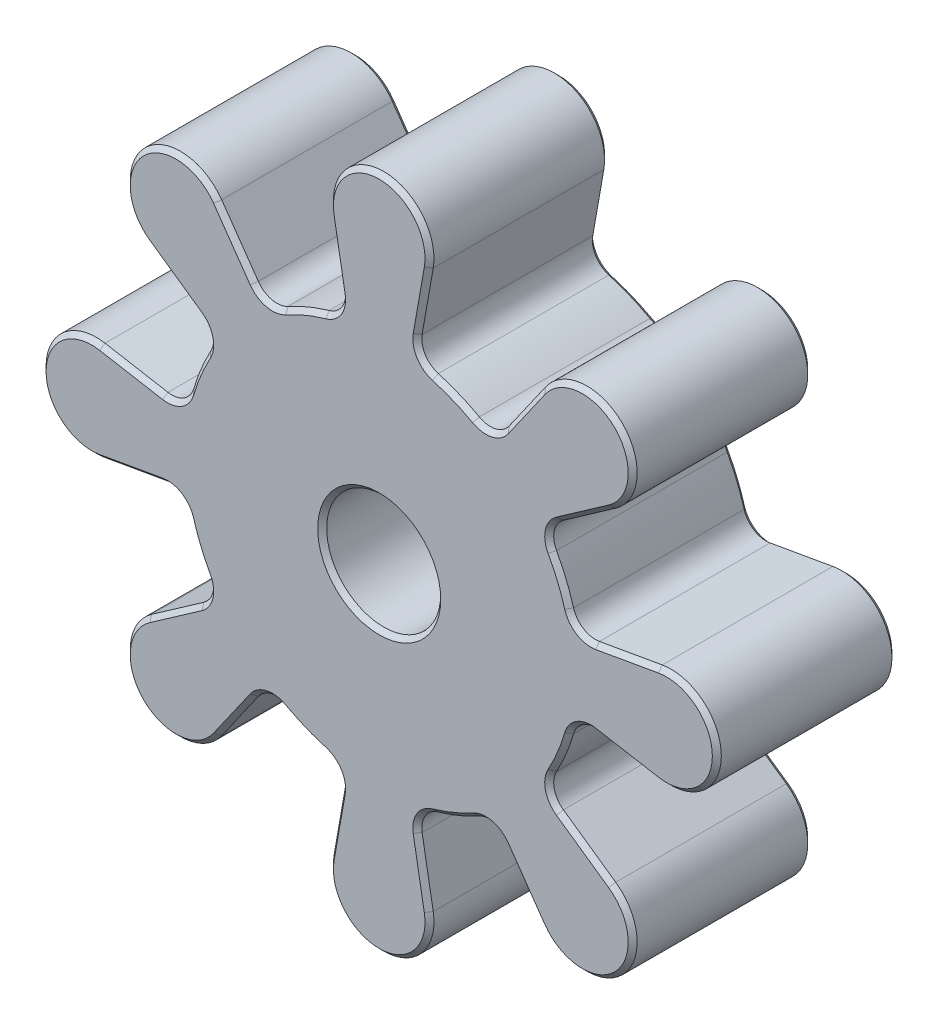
ISO-10303-21;
HEADER;
FILE_DESCRIPTION(('STEP AP214'),'2;1');
FILE_NAME('part.step','',(''),(''),'','','');
FILE_SCHEMA(('AUTOMOTIVE_DESIGN { 1 0 10303 214 1 1 1 1 }'));
ENDSEC;
DATA;
#1=APPLICATION_CONTEXT('core data for automotive mechanical design processes');
#2=APPLICATION_PROTOCOL_DEFINITION('international standard','automotive_design',2000,#1);
#3=PRODUCT_CONTEXT('',#1,'mechanical');
#4=PRODUCT('Part','Part','',(#3));
#5=PRODUCT_RELATED_PRODUCT_CATEGORY('part','',(#4));
#6=PRODUCT_DEFINITION_FORMATION('','',#4);
#7=PRODUCT_DEFINITION_CONTEXT('part definition',#1,'design');
#8=PRODUCT_DEFINITION('design','',#6,#7);
#9=PRODUCT_DEFINITION_SHAPE('','',#8);
#10=(LENGTH_UNIT() NAMED_UNIT(*) SI_UNIT(.MILLI.,.METRE.));
#11=(NAMED_UNIT(*) PLANE_ANGLE_UNIT() SI_UNIT($,.RADIAN.));
#12=(NAMED_UNIT(*) SI_UNIT($,.STERADIAN.) SOLID_ANGLE_UNIT());
#13=UNCERTAINTY_MEASURE_WITH_UNIT(LENGTH_MEASURE(1.E-05),#10,'distance_accuracy_value','');
#14=(GEOMETRIC_REPRESENTATION_CONTEXT(3) GLOBAL_UNCERTAINTY_ASSIGNED_CONTEXT((#13)) GLOBAL_UNIT_ASSIGNED_CONTEXT((#10,
#11,#12)) REPRESENTATION_CONTEXT('',''));
#15=CARTESIAN_POINT('',(0.,0.,0.));
#16=DIRECTION('',(0.,0.,1.));
#17=DIRECTION('',(1.,0.,0.));
#18=AXIS2_PLACEMENT_3D('',#15,#16,#17);
#19=CARTESIAN_POINT('',(3.39083151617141,11.7921652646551,10.));
#20=DIRECTION('',(0.,0.,1.));
#21=DIRECTION('',(1.,0.,0.));
#22=AXIS2_PLACEMENT_3D('',#19,#20,#21);
#23=PLANE('',#22);
#24=CARTESIAN_POINT('',(0.,0.,10.));
#25=DIRECTION('',(0.,0.,1.));
#26=DIRECTION('',(1.,0.,0.));
#27=AXIS2_PLACEMENT_3D('',#24,#25,#26);
#28=CIRCLE('',#27,3.425);
#29=CARTESIAN_POINT('',(3.425,0.,10.));
#30=VERTEX_POINT('',#29);
#31=EDGE_CURVE('E11',#30,#30,#28,.F.);
#32=ORIENTED_EDGE('',*,*,#31,.T.);
#33=EDGE_LOOP('',(#32));
#34=FACE_BOUND('',#33,.T.);
#35=CARTESIAN_POINT('',(5.94064006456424,10.7359999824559,10.));
#36=DIRECTION('',(0.,0.,1.));
#37=DIRECTION('',(1.,0.,0.));
#38=AXIS2_PLACEMENT_3D('',#35,#36,#37);
#39=CIRCLE('',#38,1.52000000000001);
#40=CARTESIAN_POINT('',(7.18575117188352,9.86416379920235,10.));
#41=VERTEX_POINT('',#40);
#42=CARTESIAN_POINT('',(5.20471725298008,9.40603095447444,10.));
#43=VERTEX_POINT('',#42);
#44=EDGE_CURVE('E48',#41,#43,#39,.F.);
#45=ORIENTED_EDGE('',*,*,#44,.T.);
#46=CARTESIAN_POINT('',(0.,0.,10.));
#47=DIRECTION('',(0.,0.,1.));
#48=DIRECTION('',(1.,0.,0.));
#49=AXIS2_PLACEMENT_3D('',#46,#47,#48);
#50=CIRCLE('',#49,10.75);
#51=CARTESIAN_POINT('',(2.97077740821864,10.3313591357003,10.));
#52=VERTEX_POINT('',#51);
#53=EDGE_CURVE('E40',#43,#52,#50,.T.);
#54=ORIENTED_EDGE('',*,*,#53,.T.);
#55=CARTESIAN_POINT('',(3.39083151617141,11.7921652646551,10.));
#56=DIRECTION('',(0.,0.,1.));
#57=DIRECTION('',(1.,0.,0.));
#58=AXIS2_PLACEMENT_3D('',#55,#56,#57);
#59=CIRCLE('',#58,1.52000000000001);
#60=CARTESIAN_POINT('',(1.89392373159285,12.0561104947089,10.));
#61=VERTEX_POINT('',#60);
#62=EDGE_CURVE('E859',#52,#61,#59,.F.);
#63=ORIENTED_EDGE('',*,*,#62,.T.);
#64=DIRECTION('',(0.173648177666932,0.984807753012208,0.));
#65=VECTOR('',#64,1.);
#66=CARTESIAN_POINT('',(2.51125977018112,15.5571971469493,10.));
#67=LINE('',#66,#65);
#68=CARTESIAN_POINT('',(2.51125977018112,15.5571971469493,10.));
#69=VERTEX_POINT('',#68);
#70=EDGE_CURVE('E861',#61,#69,#67,.T.);
#71=ORIENTED_EDGE('',*,*,#70,.T.);
#72=CARTESIAN_POINT('',(0.,16.,10.));
#73=DIRECTION('',(0.,0.,1.));
#74=DIRECTION('',(1.,0.,0.));
#75=AXIS2_PLACEMENT_3D('',#72,#73,#74);
#76=CIRCLE('',#75,2.54999999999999);
#77=CARTESIAN_POINT('',(-2.51125977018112,15.5571971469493,10.));
#78=VERTEX_POINT('',#77);
#79=EDGE_CURVE('E863',#69,#78,#76,.T.);
#80=ORIENTED_EDGE('',*,*,#79,.T.);
#81=DIRECTION('',(0.173648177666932,-0.984807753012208,0.));
#82=VECTOR('',#81,1.);
#83=CARTESIAN_POINT('',(-1.89392373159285,12.0561104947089,10.));
#84=LINE('',#83,#82);
#85=CARTESIAN_POINT('',(-1.89392373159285,12.0561104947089,10.));
#86=VERTEX_POINT('',#85);
#87=EDGE_CURVE('E865',#78,#86,#84,.T.);
#88=ORIENTED_EDGE('',*,*,#87,.T.);
#89=CARTESIAN_POINT('',(-3.39083151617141,11.7921652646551,10.));
#90=DIRECTION('',(0.,0.,1.));
#91=DIRECTION('',(1.,0.,0.));
#92=AXIS2_PLACEMENT_3D('',#89,#90,#91);
#93=CIRCLE('',#92,1.52000000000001);
#94=CARTESIAN_POINT('',(-2.97077740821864,10.3313591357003,10.));
#95=VERTEX_POINT('',#94);
#96=EDGE_CURVE('E867',#86,#95,#93,.F.);
#97=ORIENTED_EDGE('',*,*,#96,.T.);
#98=CARTESIAN_POINT('',(0.,0.,10.));
#99=DIRECTION('',(0.,0.,1.));
#100=DIRECTION('',(1.,0.,0.));
#101=AXIS2_PLACEMENT_3D('',#98,#99,#100);
#102=CIRCLE('',#101,10.75);
#103=CARTESIAN_POINT('',(-5.20471725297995,9.40603095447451,10.));
#104=VERTEX_POINT('',#103);
#105=EDGE_CURVE('E869',#95,#104,#102,.T.);
#106=ORIENTED_EDGE('',*,*,#105,.T.);
#107=CARTESIAN_POINT('',(-5.94064006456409,10.735999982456,10.));
#108=DIRECTION('',(0.,0.,1.));
#109=DIRECTION('',(1.,0.,0.));
#110=AXIS2_PLACEMENT_3D('',#107,#108,#109);
#111=CIRCLE('',#110,1.52000000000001);
#112=CARTESIAN_POINT('',(-7.18575117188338,9.86416379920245,10.));
#113=VERTEX_POINT('',#112);
#114=EDGE_CURVE('E871',#104,#113,#111,.F.);
#115=ORIENTED_EDGE('',*,*,#114,.T.);
#116=DIRECTION('',(-0.573576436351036,0.819152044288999,0.));
#117=VECTOR('',#116,1.);
#118=CARTESIAN_POINT('',(-9.22487078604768,12.77632841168,10.));
#119=LINE('',#118,#117);
#120=CARTESIAN_POINT('',(-9.22487078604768,12.77632841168,10.));
#121=VERTEX_POINT('',#120);
#122=EDGE_CURVE('E873',#113,#121,#119,.T.);
#123=ORIENTED_EDGE('',*,*,#122,.T.);
#124=CARTESIAN_POINT('',(-11.3137084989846,11.3137084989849,10.));
#125=DIRECTION('',(0.,0.,1.));
#126=DIRECTION('',(1.,0.,0.));
#127=AXIS2_PLACEMENT_3D('',#124,#125,#126);
#128=CIRCLE('',#127,2.54999999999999);
#129=CARTESIAN_POINT('',(-12.7763284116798,9.22487078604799,10.));
#130=VERTEX_POINT('',#129);
#131=EDGE_CURVE('E875',#121,#130,#128,.T.);
#132=ORIENTED_EDGE('',*,*,#131,.T.);
#133=DIRECTION('',(0.819152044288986,-0.573576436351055,0.));
#134=VECTOR('',#133,1.);
#135=CARTESIAN_POINT('',(-9.86416379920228,7.18575117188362,10.));
#136=LINE('',#135,#134);
#137=CARTESIAN_POINT('',(-9.86416379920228,7.18575117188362,10.));
#138=VERTEX_POINT('',#137);
#139=EDGE_CURVE('E877',#130,#138,#136,.T.);
#140=ORIENTED_EDGE('',*,*,#139,.T.);
#141=CARTESIAN_POINT('',(-10.7359999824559,5.94064006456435,10.));
#142=DIRECTION('',(0.,0.,1.));
#143=DIRECTION('',(1.,0.,0.));
#144=AXIS2_PLACEMENT_3D('',#141,#142,#143);
#145=CIRCLE('',#144,1.52000000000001);
#146=CARTESIAN_POINT('',(-9.40603095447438,5.20471725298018,10.));
#147=VERTEX_POINT('',#146);
#148=EDGE_CURVE('E879',#138,#147,#145,.F.);
#149=ORIENTED_EDGE('',*,*,#148,.T.);
#150=CARTESIAN_POINT('',(0.,0.,10.));
#151=DIRECTION('',(0.,0.,1.));
#152=DIRECTION('',(1.,0.,0.));
#153=AXIS2_PLACEMENT_3D('',#150,#151,#152);
#154=CIRCLE('',#153,10.75);
#155=CARTESIAN_POINT('',(-10.3313591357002,2.97077740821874,10.));
#156=VERTEX_POINT('',#155);
#157=EDGE_CURVE('E881',#147,#156,#154,.T.);
#158=ORIENTED_EDGE('',*,*,#157,.T.);
#159=CARTESIAN_POINT('',(-11.7921652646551,3.39083151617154,10.));
#160=DIRECTION('',(0.,0.,1.));
#161=DIRECTION('',(1.,0.,0.));
#162=AXIS2_PLACEMENT_3D('',#159,#160,#161);
#163=CIRCLE('',#162,1.52000000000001);
#164=CARTESIAN_POINT('',(-12.0561104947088,1.89392373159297,10.));
#165=VERTEX_POINT('',#164);
#166=EDGE_CURVE('E883',#156,#165,#163,.F.);
#167=ORIENTED_EDGE('',*,*,#166,.T.);
#168=DIRECTION('',(-0.984807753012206,0.173648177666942,0.));
#169=VECTOR('',#168,1.);
#170=CARTESIAN_POINT('',(-15.5571971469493,2.51125977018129,10.));
#171=LINE('',#170,#169);
#172=CARTESIAN_POINT('',(-15.5571971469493,2.51125977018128,10.));
#173=VERTEX_POINT('',#172);
#174=EDGE_CURVE('E885',#165,#173,#171,.T.);
#175=ORIENTED_EDGE('',*,*,#174,.T.);
#176=CARTESIAN_POINT('',(-16.,0.,10.));
#177=DIRECTION('',(0.,0.,1.));
#178=DIRECTION('',(1.,0.,0.));
#179=AXIS2_PLACEMENT_3D('',#176,#177,#178);
#180=CIRCLE('',#179,2.54999999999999);
#181=CARTESIAN_POINT('',(-15.5571971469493,-2.51125977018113,10.));
#182=VERTEX_POINT('',#181);
#183=EDGE_CURVE('E887',#173,#182,#180,.T.);
#184=ORIENTED_EDGE('',*,*,#183,.T.);
#185=DIRECTION('',(0.98480775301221,0.173648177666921,0.));
#186=VECTOR('',#185,1.);
#187=CARTESIAN_POINT('',(-12.0561104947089,-1.89392373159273,10.));
#188=LINE('',#187,#186);
#189=CARTESIAN_POINT('',(-12.0561104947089,-1.89392373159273,10.));
#190=VERTEX_POINT('',#189);
#191=EDGE_CURVE('E889',#182,#190,#188,.T.);
#192=ORIENTED_EDGE('',*,*,#191,.T.);
#193=CARTESIAN_POINT('',(-11.7921652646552,-3.39083151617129,10.));
#194=DIRECTION('',(0.,0.,1.));
#195=DIRECTION('',(1.,0.,0.));
#196=AXIS2_PLACEMENT_3D('',#193,#194,#195);
#197=CIRCLE('',#196,1.52000000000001);
#198=CARTESIAN_POINT('',(-10.3313591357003,-2.97077740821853,10.));
#199=VERTEX_POINT('',#198);
#200=EDGE_CURVE('E891',#190,#199,#197,.F.);
#201=ORIENTED_EDGE('',*,*,#200,.T.);
#202=CARTESIAN_POINT('',(0.,0.,10.));
#203=DIRECTION('',(0.,0.,1.));
#204=DIRECTION('',(1.,0.,0.));
#205=AXIS2_PLACEMENT_3D('',#202,#203,#204);
#206=CIRCLE('',#205,10.75);
#207=CARTESIAN_POINT('',(-9.4060309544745,-5.20471725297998,10.));
#208=VERTEX_POINT('',#207);
#209=EDGE_CURVE('E893',#199,#208,#206,.T.);
#210=ORIENTED_EDGE('',*,*,#209,.T.);
#211=CARTESIAN_POINT('',(-10.735999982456,-5.94064006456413,10.));
#212=DIRECTION('',(0.,0.,1.));
#213=DIRECTION('',(1.,0.,0.));
#214=AXIS2_PLACEMENT_3D('',#211,#212,#213);
#215=CIRCLE('',#214,1.52000000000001);
#216=CARTESIAN_POINT('',(-9.86416379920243,-7.18575117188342,10.));
#217=VERTEX_POINT('',#216);
#218=EDGE_CURVE('E895',#208,#217,#215,.F.);
#219=ORIENTED_EDGE('',*,*,#218,.T.);
#220=DIRECTION('',(-0.819152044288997,-0.573576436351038,0.));
#221=VECTOR('',#220,1.);
#222=CARTESIAN_POINT('',(-12.77632841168,-9.22487078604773,10.));
#223=LINE('',#222,#221);
#224=CARTESIAN_POINT('',(-12.77632841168,-9.22487078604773,10.));
#225=VERTEX_POINT('',#224);
#226=EDGE_CURVE('E897',#217,#225,#223,.T.);
#227=ORIENTED_EDGE('',*,*,#226,.T.);
#228=CARTESIAN_POINT('',(-11.3137084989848,-11.3137084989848,10.));
#229=DIRECTION('',(0.,0.,1.));
#230=DIRECTION('',(1.,0.,0.));
#231=AXIS2_PLACEMENT_3D('',#228,#229,#230);
#232=CIRCLE('',#231,2.54999999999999);
#233=CARTESIAN_POINT('',(-9.22487078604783,-12.7763284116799,10.));
#234=VERTEX_POINT('',#233);
#235=EDGE_CURVE('E899',#225,#234,#232,.T.);
#236=ORIENTED_EDGE('',*,*,#235,.T.);
#237=DIRECTION('',(0.573576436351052,0.819152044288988,0.));
#238=VECTOR('',#237,1.);
#239=CARTESIAN_POINT('',(-7.18575117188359,-9.86416379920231,10.));
#240=LINE('',#239,#238);
#241=CARTESIAN_POINT('',(-7.18575117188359,-9.86416379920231,10.));
#242=VERTEX_POINT('',#241);
#243=EDGE_CURVE('E901',#234,#242,#240,.T.);
#244=ORIENTED_EDGE('',*,*,#243,.T.);
#245=CARTESIAN_POINT('',(-5.94064006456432,-10.7359999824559,10.));
#246=DIRECTION('',(0.,0.,1.));
#247=DIRECTION('',(1.,0.,0.));
#248=AXIS2_PLACEMENT_3D('',#245,#246,#247);
#249=CIRCLE('',#248,1.52000000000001);
#250=CARTESIAN_POINT('',(-5.20471725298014,-9.4060309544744,10.));
#251=VERTEX_POINT('',#250);
#252=EDGE_CURVE('E903',#242,#251,#249,.F.);
#253=ORIENTED_EDGE('',*,*,#252,.T.);
#254=CARTESIAN_POINT('',(0.,0.,10.));
#255=DIRECTION('',(0.,0.,1.));
#256=DIRECTION('',(1.,0.,0.));
#257=AXIS2_PLACEMENT_3D('',#254,#255,#256);
#258=CIRCLE('',#257,10.75);
#259=CARTESIAN_POINT('',(-2.97077740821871,-10.3313591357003,10.));
#260=VERTEX_POINT('',#259);
#261=EDGE_CURVE('E905',#251,#260,#258,.T.);
#262=ORIENTED_EDGE('',*,*,#261,.T.);
#263=CARTESIAN_POINT('',(-3.3908315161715,-11.7921652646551,10.));
#264=DIRECTION('',(0.,0.,1.));
#265=DIRECTION('',(1.,0.,0.));
#266=AXIS2_PLACEMENT_3D('',#263,#264,#265);
#267=CIRCLE('',#266,1.52000000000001);
#268=CARTESIAN_POINT('',(-1.89392373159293,-12.0561104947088,10.));
#269=VERTEX_POINT('',#268);
#270=EDGE_CURVE('E907',#260,#269,#267,.F.);
#271=ORIENTED_EDGE('',*,*,#270,.T.);
#272=DIRECTION('',(-0.173648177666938,-0.984807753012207,0.));
#273=VECTOR('',#272,1.);
#274=CARTESIAN_POINT('',(-2.51125977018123,-15.5571971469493,10.));
#275=LINE('',#274,#273);
#276=CARTESIAN_POINT('',(-2.51125977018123,-15.5571971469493,10.));
#277=VERTEX_POINT('',#276);
#278=EDGE_CURVE('E909',#269,#277,#275,.T.);
#279=ORIENTED_EDGE('',*,*,#278,.T.);
#280=CARTESIAN_POINT('',(0.,-16.,10.));
#281=DIRECTION('',(0.,0.,1.));
#282=DIRECTION('',(1.,0.,0.));
#283=AXIS2_PLACEMENT_3D('',#280,#281,#282);
#284=CIRCLE('',#283,2.54999999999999);
#285=CARTESIAN_POINT('',(2.51125977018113,-15.5571971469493,10.));
#286=VERTEX_POINT('',#285);
#287=EDGE_CURVE('E911',#277,#286,#284,.T.);
#288=ORIENTED_EDGE('',*,*,#287,.T.);
#289=DIRECTION('',(-0.173648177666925,0.984807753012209,0.));
#290=VECTOR('',#289,1.);
#291=CARTESIAN_POINT('',(1.89392373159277,-12.0561104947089,10.));
#292=LINE('',#291,#290);
#293=CARTESIAN_POINT('',(1.89392373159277,-12.0561104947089,10.));
#294=VERTEX_POINT('',#293);
#295=EDGE_CURVE('E913',#286,#294,#292,.T.);
#296=ORIENTED_EDGE('',*,*,#295,.T.);
#297=CARTESIAN_POINT('',(3.39083151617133,-11.7921652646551,10.));
#298=DIRECTION('',(0.,0.,1.));
#299=DIRECTION('',(1.,0.,0.));
#300=AXIS2_PLACEMENT_3D('',#297,#298,#299);
#301=CIRCLE('',#300,1.52000000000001);
#302=CARTESIAN_POINT('',(2.97077740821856,-10.3313591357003,10.));
#303=VERTEX_POINT('',#302);
#304=EDGE_CURVE('E915',#294,#303,#301,.F.);
#305=ORIENTED_EDGE('',*,*,#304,.T.);
#306=CARTESIAN_POINT('',(0.,0.,10.));
#307=DIRECTION('',(0.,0.,1.));
#308=DIRECTION('',(1.,0.,0.));
#309=AXIS2_PLACEMENT_3D('',#306,#307,#308);
#310=CIRCLE('',#309,10.75);
#311=CARTESIAN_POINT('',(5.20471725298,-9.40603095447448,10.));
#312=VERTEX_POINT('',#311);
#313=EDGE_CURVE('E917',#303,#312,#310,.T.);
#314=ORIENTED_EDGE('',*,*,#313,.T.);
#315=CARTESIAN_POINT('',(5.94064006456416,-10.735999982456,10.));
#316=DIRECTION('',(0.,0.,1.));
#317=DIRECTION('',(1.,0.,0.));
#318=AXIS2_PLACEMENT_3D('',#315,#316,#317);
#319=CIRCLE('',#318,1.52000000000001);
#320=CARTESIAN_POINT('',(7.18575117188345,-9.86416379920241,10.));
#321=VERTEX_POINT('',#320);
#322=EDGE_CURVE('E919',#312,#321,#319,.F.);
#323=ORIENTED_EDGE('',*,*,#322,.T.);
#324=DIRECTION('',(0.573576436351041,-0.819152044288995,0.));
#325=VECTOR('',#324,1.);
#326=CARTESIAN_POINT('',(9.22487078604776,-12.77632841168,10.));
#327=LINE('',#326,#325);
#328=CARTESIAN_POINT('',(9.22487078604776,-12.77632841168,10.));
#329=VERTEX_POINT('',#328);
#330=EDGE_CURVE('E921',#321,#329,#327,.T.);
#331=ORIENTED_EDGE('',*,*,#330,.T.);
#332=CARTESIAN_POINT('',(11.3137084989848,-11.3137084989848,10.));
#333=DIRECTION('',(0.,0.,1.));
#334=DIRECTION('',(1.,0.,0.));
#335=AXIS2_PLACEMENT_3D('',#332,#333,#334);
#336=CIRCLE('',#335,2.54999999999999);
#337=CARTESIAN_POINT('',(12.7763284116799,-9.22487078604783,10.));
#338=VERTEX_POINT('',#337);
#339=EDGE_CURVE('E923',#329,#338,#336,.T.);
#340=ORIENTED_EDGE('',*,*,#339,.T.);
#341=DIRECTION('',(-0.81915204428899,0.573576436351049,0.));
#342=VECTOR('',#341,1.);
#343=CARTESIAN_POINT('',(9.86416379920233,-7.18575117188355,10.));
#344=LINE('',#343,#342);
#345=CARTESIAN_POINT('',(9.86416379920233,-7.18575117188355,10.));
#346=VERTEX_POINT('',#345);
#347=EDGE_CURVE('E925',#338,#346,#344,.T.);
#348=ORIENTED_EDGE('',*,*,#347,.T.);
#349=CARTESIAN_POINT('',(10.7359999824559,-5.94064006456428,10.));
#350=DIRECTION('',(0.,0.,1.));
#351=DIRECTION('',(1.,0.,0.));
#352=AXIS2_PLACEMENT_3D('',#349,#350,#351);
#353=CIRCLE('',#352,1.52000000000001);
#354=CARTESIAN_POINT('',(9.40603095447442,-5.20471725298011,10.));
#355=VERTEX_POINT('',#354);
#356=EDGE_CURVE('E927',#346,#355,#353,.F.);
#357=ORIENTED_EDGE('',*,*,#356,.T.);
#358=CARTESIAN_POINT('',(0.,0.,10.));
#359=DIRECTION('',(0.,0.,1.));
#360=DIRECTION('',(1.,0.,0.));
#361=AXIS2_PLACEMENT_3D('',#358,#359,#360);
#362=CIRCLE('',#361,10.75);
#363=CARTESIAN_POINT('',(10.3313591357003,-2.97077740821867,10.));
#364=VERTEX_POINT('',#363);
#365=EDGE_CURVE('E929',#355,#364,#362,.T.);
#366=ORIENTED_EDGE('',*,*,#365,.T.);
#367=CARTESIAN_POINT('',(11.7921652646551,-3.39083151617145,10.));
#368=DIRECTION('',(0.,0.,1.));
#369=DIRECTION('',(1.,0.,0.));
#370=AXIS2_PLACEMENT_3D('',#367,#368,#369);
#371=CIRCLE('',#370,1.52000000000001);
#372=CARTESIAN_POINT('',(12.0561104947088,-1.89392373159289,10.));
#373=VERTEX_POINT('',#372);
#374=EDGE_CURVE('E931',#364,#373,#371,.F.);
#375=ORIENTED_EDGE('',*,*,#374,.T.);
#376=DIRECTION('',(0.984807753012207,-0.173648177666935,0.));
#377=VECTOR('',#376,1.);
#378=CARTESIAN_POINT('',(15.5571971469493,-2.51125977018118,10.));
#379=LINE('',#378,#377);
#380=CARTESIAN_POINT('',(15.5571971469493,-2.51125977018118,10.));
#381=VERTEX_POINT('',#380);
#382=EDGE_CURVE('E933',#373,#381,#379,.T.);
#383=ORIENTED_EDGE('',*,*,#382,.T.);
#384=CARTESIAN_POINT('',(16.,0.,10.));
#385=DIRECTION('',(0.,0.,1.));
#386=DIRECTION('',(1.,0.,0.));
#387=AXIS2_PLACEMENT_3D('',#384,#385,#386);
#388=CIRCLE('',#387,2.54999999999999);
#389=CARTESIAN_POINT('',(15.5571971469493,2.51125977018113,10.));
#390=VERTEX_POINT('',#389);
#391=EDGE_CURVE('E935',#381,#390,#388,.T.);
#392=ORIENTED_EDGE('',*,*,#391,.T.);
#393=DIRECTION('',(-0.984807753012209,-0.173648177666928,0.));
#394=VECTOR('',#393,1.);
#395=CARTESIAN_POINT('',(12.0561104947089,1.8939237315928,10.));
#396=LINE('',#395,#394);
#397=CARTESIAN_POINT('',(12.0561104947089,1.8939237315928,10.));
#398=VERTEX_POINT('',#397);
#399=EDGE_CURVE('E937',#390,#398,#396,.T.);
#400=ORIENTED_EDGE('',*,*,#399,.T.);
#401=CARTESIAN_POINT('',(11.7921652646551,3.39083151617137,10.));
#402=DIRECTION('',(0.,0.,1.));
#403=DIRECTION('',(1.,0.,0.));
#404=AXIS2_PLACEMENT_3D('',#401,#402,#403);
#405=CIRCLE('',#404,1.52000000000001);
#406=CARTESIAN_POINT('',(10.3313591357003,2.9707774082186,10.));
#407=VERTEX_POINT('',#406);
#408=EDGE_CURVE('E939',#398,#407,#405,.F.);
#409=ORIENTED_EDGE('',*,*,#408,.T.);
#410=CARTESIAN_POINT('',(0.,0.,10.));
#411=DIRECTION('',(0.,0.,1.));
#412=DIRECTION('',(1.,0.,0.));
#413=AXIS2_PLACEMENT_3D('',#410,#411,#412);
#414=CIRCLE('',#413,10.75);
#415=CARTESIAN_POINT('',(9.40603095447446,5.20471725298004,10.));
#416=VERTEX_POINT('',#415);
#417=EDGE_CURVE('E941',#407,#416,#414,.T.);
#418=ORIENTED_EDGE('',*,*,#417,.T.);
#419=CARTESIAN_POINT('',(10.735999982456,5.9406400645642,10.));
#420=DIRECTION('',(0.,0.,1.));
#421=DIRECTION('',(1.,0.,0.));
#422=AXIS2_PLACEMENT_3D('',#419,#420,#421);
#423=CIRCLE('',#422,1.52000000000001);
#424=CARTESIAN_POINT('',(9.86416379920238,7.18575117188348,10.));
#425=VERTEX_POINT('',#424);
#426=EDGE_CURVE('E943',#416,#425,#423,.F.);
#427=ORIENTED_EDGE('',*,*,#426,.T.);
#428=DIRECTION('',(0.819152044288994,0.573576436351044,0.));
#429=VECTOR('',#428,1.);
#430=CARTESIAN_POINT('',(12.7763284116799,9.22487078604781,10.));
#431=LINE('',#430,#429);
#432=CARTESIAN_POINT('',(12.7763284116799,9.22487078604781,10.));
#433=VERTEX_POINT('',#432);
#434=EDGE_CURVE('E945',#425,#433,#431,.T.);
#435=ORIENTED_EDGE('',*,*,#434,.T.);
#436=CARTESIAN_POINT('',(11.3137084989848,11.3137084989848,10.));
#437=DIRECTION('',(0.,0.,1.));
#438=DIRECTION('',(1.,0.,0.));
#439=AXIS2_PLACEMENT_3D('',#436,#437,#438);
#440=CIRCLE('',#439,2.54999999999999);
#441=CARTESIAN_POINT('',(9.22487078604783,12.7763284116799,10.));
#442=VERTEX_POINT('',#441);
#443=EDGE_CURVE('E947',#433,#442,#440,.T.);
#444=ORIENTED_EDGE('',*,*,#443,.T.);
#445=DIRECTION('',(-0.573576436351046,-0.819152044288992,0.));
#446=VECTOR('',#445,1.);
#447=CARTESIAN_POINT('',(7.18575117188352,9.86416379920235,10.));
#448=LINE('',#447,#446);
#449=EDGE_CURVE('E53',#442,#41,#448,.T.);
#450=ORIENTED_EDGE('',*,*,#449,.T.);
#451=EDGE_LOOP('',(#45,#54,#63,#71,#80,#88,#97,#106,#115,#123,#132,#140,#149,#158,#167,#175,
#184,#192,#201,#210,#219,#227,#236,#244,#253,#262,#271,#279,#288,#296,#305,#314,#323,#331,#340,
#348,#357,#366,#375,#383,#392,#400,#409,#418,#427,#435,#444,#450));
#452=FACE_BOUND('',#451,.T.);
#453=ADVANCED_FACE('F31',(#34,#452),#23,.T.);
#454=CARTESIAN_POINT('',(3.39083151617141,11.7921652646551,0.));
#455=DIRECTION('',(0.,0.,1.));
#456=DIRECTION('',(1.,0.,0.));
#457=AXIS2_PLACEMENT_3D('',#454,#455,#456);
#458=PLANE('',#457);
#459=CARTESIAN_POINT('',(0.,0.,0.));
#460=DIRECTION('',(0.,0.,1.));
#461=DIRECTION('',(1.,0.,0.));
#462=AXIS2_PLACEMENT_3D('',#459,#460,#461);
#463=CIRCLE('',#462,3.425);
#464=CARTESIAN_POINT('',(3.425,0.,0.));
#465=VERTEX_POINT('',#464);
#466=EDGE_CURVE('E653',#465,#465,#463,.T.);
#467=ORIENTED_EDGE('',*,*,#466,.T.);
#468=EDGE_LOOP('',(#467));
#469=FACE_BOUND('',#468,.T.);
#470=CARTESIAN_POINT('',(0.,16.,0.));
#471=DIRECTION('',(0.,0.,1.));
#472=DIRECTION('',(1.,0.,0.));
#473=AXIS2_PLACEMENT_3D('',#470,#471,#472);
#474=CIRCLE('',#473,2.54999999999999);
#475=CARTESIAN_POINT('',(-2.51125977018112,15.5571971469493,0.));
#476=VERTEX_POINT('',#475);
#477=CARTESIAN_POINT('',(2.51125977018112,15.5571971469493,0.));
#478=VERTEX_POINT('',#477);
#479=EDGE_CURVE('E652',#476,#478,#474,.F.);
#480=ORIENTED_EDGE('',*,*,#479,.T.);
#481=DIRECTION('',(-0.173648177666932,-0.984807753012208,0.));
#482=VECTOR('',#481,1.);
#483=CARTESIAN_POINT('',(1.89392373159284,12.0561104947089,0.));
#484=LINE('',#483,#482);
#485=CARTESIAN_POINT('',(1.89392373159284,12.0561104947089,0.));
#486=VERTEX_POINT('',#485);
#487=EDGE_CURVE('E631',#478,#486,#484,.T.);
#488=ORIENTED_EDGE('',*,*,#487,.T.);
#489=CARTESIAN_POINT('',(3.39083151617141,11.7921652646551,0.));
#490=DIRECTION('',(0.,0.,1.));
#491=DIRECTION('',(1.,0.,0.));
#492=AXIS2_PLACEMENT_3D('',#489,#490,#491);
#493=CIRCLE('',#492,1.52000000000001);
#494=CARTESIAN_POINT('',(2.97077740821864,10.3313591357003,0.));
#495=VERTEX_POINT('',#494);
#496=EDGE_CURVE('E641',#486,#495,#493,.T.);
#497=ORIENTED_EDGE('',*,*,#496,.T.);
#498=CARTESIAN_POINT('',(0.,0.,0.));
#499=DIRECTION('',(0.,0.,1.));
#500=DIRECTION('',(1.,0.,0.));
#501=AXIS2_PLACEMENT_3D('',#498,#499,#500);
#502=CIRCLE('',#501,10.75);
#503=CARTESIAN_POINT('',(5.20471725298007,9.40603095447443,0.));
#504=VERTEX_POINT('',#503);
#505=EDGE_CURVE('E647',#495,#504,#502,.F.);
#506=ORIENTED_EDGE('',*,*,#505,.T.);
#507=CARTESIAN_POINT('',(5.94064006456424,10.7359999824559,0.));
#508=DIRECTION('',(0.,0.,1.));
#509=DIRECTION('',(1.,0.,0.));
#510=AXIS2_PLACEMENT_3D('',#507,#508,#509);
#511=CIRCLE('',#510,1.52000000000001);
#512=CARTESIAN_POINT('',(7.18575117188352,9.86416379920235,0.));
#513=VERTEX_POINT('',#512);
#514=EDGE_CURVE('E1324',#504,#513,#511,.T.);
#515=ORIENTED_EDGE('',*,*,#514,.T.);
#516=DIRECTION('',(0.573576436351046,0.819152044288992,0.));
#517=VECTOR('',#516,1.);
#518=CARTESIAN_POINT('',(6.84312520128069,9.37484320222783,0.));
#519=LINE('',#518,#517);
#520=CARTESIAN_POINT('',(9.22487078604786,12.7763284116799,0.));
#521=VERTEX_POINT('',#520);
#522=EDGE_CURVE('E1326',#513,#521,#519,.T.);
#523=ORIENTED_EDGE('',*,*,#522,.T.);
#524=CARTESIAN_POINT('',(11.3137084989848,11.3137084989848,0.));
#525=DIRECTION('',(0.,0.,1.));
#526=DIRECTION('',(1.,0.,0.));
#527=AXIS2_PLACEMENT_3D('',#524,#525,#526);
#528=CIRCLE('',#527,2.54999999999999);
#529=CARTESIAN_POINT('',(12.7763284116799,9.22487078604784,0.));
#530=VERTEX_POINT('',#529);
#531=EDGE_CURVE('E1328',#521,#530,#528,.F.);
#532=ORIENTED_EDGE('',*,*,#531,.T.);
#533=DIRECTION('',(-0.819152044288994,-0.573576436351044,0.));
#534=VECTOR('',#533,1.);
#535=CARTESIAN_POINT('',(7.68479930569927,5.65974372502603,0.));
#536=LINE('',#535,#534);
#537=CARTESIAN_POINT('',(9.86416379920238,7.18575117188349,0.));
#538=VERTEX_POINT('',#537);
#539=EDGE_CURVE('E1330',#530,#538,#536,.T.);
#540=ORIENTED_EDGE('',*,*,#539,.T.);
#541=CARTESIAN_POINT('',(10.735999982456,5.9406400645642,0.));
#542=DIRECTION('',(0.,0.,1.));
#543=DIRECTION('',(1.,0.,0.));
#544=AXIS2_PLACEMENT_3D('',#541,#542,#543);
#545=CIRCLE('',#544,1.52000000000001);
#546=CARTESIAN_POINT('',(9.40603095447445,5.20471725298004,0.));
#547=VERTEX_POINT('',#546);
#548=EDGE_CURVE('E1332',#538,#547,#545,.T.);
#549=ORIENTED_EDGE('',*,*,#548,.T.);
#550=CARTESIAN_POINT('',(0.,0.,0.));
#551=DIRECTION('',(0.,0.,1.));
#552=DIRECTION('',(1.,0.,0.));
#553=AXIS2_PLACEMENT_3D('',#550,#551,#552);
#554=CIRCLE('',#553,10.75);
#555=CARTESIAN_POINT('',(10.3313591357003,2.9707774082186,0.));
#556=VERTEX_POINT('',#555);
#557=EDGE_CURVE('E1334',#547,#556,#554,.F.);
#558=ORIENTED_EDGE('',*,*,#557,.T.);
#559=CARTESIAN_POINT('',(11.7921652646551,3.39083151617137,0.));
#560=DIRECTION('',(0.,0.,1.));
#561=DIRECTION('',(1.,0.,0.));
#562=AXIS2_PLACEMENT_3D('',#559,#560,#561);
#563=CIRCLE('',#562,1.52000000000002);
#564=CARTESIAN_POINT('',(12.0561104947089,1.8939237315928,0.));
#565=VERTEX_POINT('',#564);
#566=EDGE_CURVE('E1336',#556,#565,#563,.T.);
#567=ORIENTED_EDGE('',*,*,#566,.T.);
#568=DIRECTION('',(0.984807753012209,0.173648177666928,0.));
#569=VECTOR('',#568,1.);
#570=CARTESIAN_POINT('',(5.34482064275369,0.7105422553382,0.));
#571=LINE('',#570,#569);
#572=CARTESIAN_POINT('',(15.5571971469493,2.51125977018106,0.));
#573=VERTEX_POINT('',#572);
#574=EDGE_CURVE('E1338',#565,#573,#571,.T.);
#575=ORIENTED_EDGE('',*,*,#574,.T.);
#576=CARTESIAN_POINT('',(16.,0.,0.));
#577=DIRECTION('',(0.,0.,1.));
#578=DIRECTION('',(1.,0.,0.));
#579=AXIS2_PLACEMENT_3D('',#576,#577,#578);
#580=CIRCLE('',#579,2.54999999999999);
#581=CARTESIAN_POINT('',(15.5571971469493,-2.51125977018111,0.));
#582=VERTEX_POINT('',#581);
#583=EDGE_CURVE('E1340',#573,#582,#580,.F.);
#584=ORIENTED_EDGE('',*,*,#583,.T.);
#585=DIRECTION('',(-0.984807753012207,0.173648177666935,0.));
#586=VECTOR('',#585,1.);
#587=CARTESIAN_POINT('',(1.31166258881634,0.0006123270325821,0.));
#588=LINE('',#587,#586);
#589=CARTESIAN_POINT('',(12.0561104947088,-1.89392373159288,0.));
#590=VERTEX_POINT('',#589);
#591=EDGE_CURVE('E1342',#582,#590,#588,.T.);
#592=ORIENTED_EDGE('',*,*,#591,.T.);
#593=CARTESIAN_POINT('',(11.7921652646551,-3.39083151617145,0.));
#594=DIRECTION('',(0.,0.,1.));
#595=DIRECTION('',(1.,0.,0.));
#596=AXIS2_PLACEMENT_3D('',#593,#594,#595);
#597=CIRCLE('',#596,1.52000000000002);
#598=CARTESIAN_POINT('',(10.3313591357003,-2.97077740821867,0.));
#599=VERTEX_POINT('',#598);
#600=EDGE_CURVE('E1344',#590,#599,#597,.T.);
#601=ORIENTED_EDGE('',*,*,#600,.T.);
#602=CARTESIAN_POINT('',(0.,0.,0.));
#603=DIRECTION('',(0.,0.,1.));
#604=DIRECTION('',(1.,0.,0.));
#605=AXIS2_PLACEMENT_3D('',#602,#603,#604);
#606=CIRCLE('',#605,10.75);
#607=CARTESIAN_POINT('',(9.40603095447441,-5.20471725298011,0.));
#608=VERTEX_POINT('',#607);
#609=EDGE_CURVE('E1346',#599,#608,#606,.F.);
#610=ORIENTED_EDGE('',*,*,#609,.T.);
#611=CARTESIAN_POINT('',(10.7359999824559,-5.94064006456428,0.));
#612=DIRECTION('',(0.,0.,1.));
#613=DIRECTION('',(1.,0.,0.));
#614=AXIS2_PLACEMENT_3D('',#611,#612,#613);
#615=CIRCLE('',#614,1.52000000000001);
#616=CARTESIAN_POINT('',(9.86416379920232,-7.18575117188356,0.));
#617=VERTEX_POINT('',#616);
#618=EDGE_CURVE('E1348',#608,#617,#615,.T.);
#619=ORIENTED_EDGE('',*,*,#618,.T.);
#620=DIRECTION('',(0.81915204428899,-0.573576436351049,0.));
#621=VECTOR('',#620,1.);
#622=CARTESIAN_POINT('',(-3.39621137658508,2.09926348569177,0.));
#623=LINE('',#622,#621);
#624=CARTESIAN_POINT('',(12.7763284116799,-9.22487078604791,0.));
#625=VERTEX_POINT('',#624);
#626=EDGE_CURVE('E1350',#617,#625,#623,.T.);
#627=ORIENTED_EDGE('',*,*,#626,.T.);
#628=CARTESIAN_POINT('',(11.3137084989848,-11.3137084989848,0.));
#629=DIRECTION('',(0.,0.,1.));
#630=DIRECTION('',(1.,0.,0.));
#631=AXIS2_PLACEMENT_3D('',#628,#629,#630);
#632=CIRCLE('',#631,2.54999999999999);
#633=CARTESIAN_POINT('',(9.22487078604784,-12.7763284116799,0.));
#634=VERTEX_POINT('',#633);
#635=EDGE_CURVE('E1352',#625,#634,#632,.F.);
#636=ORIENTED_EDGE('',*,*,#635,.T.);
#637=DIRECTION('',(-0.573576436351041,0.819152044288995,0.));
#638=VECTOR('',#637,1.);
#639=CARTESIAN_POINT('',(-4.23788548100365,6.45048011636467,0.));
#640=LINE('',#639,#638);
#641=CARTESIAN_POINT('',(7.18575117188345,-9.8641637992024,0.));
#642=VERTEX_POINT('',#641);
#643=EDGE_CURVE('E1354',#634,#642,#640,.T.);
#644=ORIENTED_EDGE('',*,*,#643,.T.);
#645=CARTESIAN_POINT('',(5.94064006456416,-10.735999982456,0.));
#646=DIRECTION('',(0.,0.,1.));
#647=DIRECTION('',(1.,0.,0.));
#648=AXIS2_PLACEMENT_3D('',#645,#646,#647);
#649=CIRCLE('',#648,1.52000000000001);
#650=CARTESIAN_POINT('',(5.20471725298,-9.40603095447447,0.));
#651=VERTEX_POINT('',#650);
#652=EDGE_CURVE('E1356',#642,#651,#649,.T.);
#653=ORIENTED_EDGE('',*,*,#652,.T.);
#654=CARTESIAN_POINT('',(0.,0.,0.));
#655=DIRECTION('',(0.,0.,1.));
#656=DIRECTION('',(1.,0.,0.));
#657=AXIS2_PLACEMENT_3D('',#654,#655,#656);
#658=CIRCLE('',#657,10.75);
#659=CARTESIAN_POINT('',(2.97077740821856,-10.3313591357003,0.));
#660=VERTEX_POINT('',#659);
#661=EDGE_CURVE('E1358',#651,#660,#658,.F.);
#662=ORIENTED_EDGE('',*,*,#661,.T.);
#663=CARTESIAN_POINT('',(3.39083151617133,-11.7921652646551,0.));
#664=DIRECTION('',(0.,0.,1.));
#665=DIRECTION('',(1.,0.,0.));
#666=AXIS2_PLACEMENT_3D('',#663,#664,#665);
#667=CIRCLE('',#666,1.52000000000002);
#668=CARTESIAN_POINT('',(1.89392373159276,-12.0561104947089,0.));
#669=VERTEX_POINT('',#668);
#670=EDGE_CURVE('E1360',#660,#669,#667,.T.);
#671=ORIENTED_EDGE('',*,*,#670,.T.);
#672=DIRECTION('',(0.173648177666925,-0.984807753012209,0.));
#673=VECTOR('',#672,1.);
#674=CARTESIAN_POINT('',(-2.13923432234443,10.8170654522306,0.));
#675=LINE('',#674,#673);
#676=CARTESIAN_POINT('',(2.51125977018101,-15.5571971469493,0.));
#677=VERTEX_POINT('',#676);
#678=EDGE_CURVE('E1362',#669,#677,#675,.T.);
#679=ORIENTED_EDGE('',*,*,#678,.T.);
#680=CARTESIAN_POINT('',(0.,-16.,0.));
#681=DIRECTION('',(0.,0.,1.));
#682=DIRECTION('',(1.,0.,0.));
#683=AXIS2_PLACEMENT_3D('',#680,#681,#682);
#684=CIRCLE('',#683,2.54999999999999);
#685=CARTESIAN_POINT('',(-2.51125977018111,-15.5571971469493,0.));
#686=VERTEX_POINT('',#685);
#687=EDGE_CURVE('E1364',#677,#686,#684,.F.);
#688=ORIENTED_EDGE('',*,*,#687,.T.);
#689=DIRECTION('',(0.173648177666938,0.984807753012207,0.));
#690=VECTOR('',#689,1.);
#691=CARTESIAN_POINT('',(2.34372648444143,11.9767981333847,0.));
#692=LINE('',#691,#690);
#693=CARTESIAN_POINT('',(-1.89392373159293,-12.0561104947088,0.));
#694=VERTEX_POINT('',#693);
#695=EDGE_CURVE('E1366',#686,#694,#692,.T.);
#696=ORIENTED_EDGE('',*,*,#695,.T.);
#697=CARTESIAN_POINT('',(-3.3908315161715,-11.7921652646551,0.));
#698=DIRECTION('',(0.,0.,1.));
#699=DIRECTION('',(1.,0.,0.));
#700=AXIS2_PLACEMENT_3D('',#697,#698,#699);
#701=CIRCLE('',#700,1.52000000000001);
#702=CARTESIAN_POINT('',(-2.97077740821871,-10.3313591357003,0.));
#703=VERTEX_POINT('',#702);
#704=EDGE_CURVE('E1368',#694,#703,#701,.T.);
#705=ORIENTED_EDGE('',*,*,#704,.T.);
#706=CARTESIAN_POINT('',(0.,0.,0.));
#707=DIRECTION('',(0.,0.,1.));
#708=DIRECTION('',(1.,0.,0.));
#709=AXIS2_PLACEMENT_3D('',#706,#707,#708);
#710=CIRCLE('',#709,10.75);
#711=CARTESIAN_POINT('',(-5.20471725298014,-9.4060309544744,0.));
#712=VERTEX_POINT('',#711);
#713=EDGE_CURVE('E1370',#703,#712,#710,.F.);
#714=ORIENTED_EDGE('',*,*,#713,.T.);
#715=CARTESIAN_POINT('',(-5.94064006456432,-10.7359999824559,0.));
#716=DIRECTION('',(0.,0.,1.));
#717=DIRECTION('',(1.,0.,0.));
#718=AXIS2_PLACEMENT_3D('',#715,#716,#717);
#719=CIRCLE('',#718,1.52000000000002);
#720=CARTESIAN_POINT('',(-7.18575117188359,-9.8641637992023,0.));
#721=VERTEX_POINT('',#720);
#722=EDGE_CURVE('E1372',#712,#721,#719,.T.);
#723=ORIENTED_EDGE('',*,*,#722,.T.);
#724=DIRECTION('',(-0.573576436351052,-0.819152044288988,0.));
#725=VECTOR('',#724,1.);
#726=CARTESIAN_POINT('',(6.46898431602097,9.6368194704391,0.));
#727=LINE('',#726,#725);
#728=CARTESIAN_POINT('',(-9.22487078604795,-12.7763284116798,0.));
#729=VERTEX_POINT('',#728);
#730=EDGE_CURVE('E1374',#721,#729,#727,.T.);
#731=ORIENTED_EDGE('',*,*,#730,.T.);
#732=CARTESIAN_POINT('',(-11.3137084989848,-11.3137084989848,0.));
#733=DIRECTION('',(0.,0.,1.));
#734=DIRECTION('',(1.,0.,0.));
#735=AXIS2_PLACEMENT_3D('',#732,#733,#734);
#736=CIRCLE('',#735,2.54999999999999);
#737=CARTESIAN_POINT('',(-12.7763284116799,-9.22487078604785,0.));
#738=VERTEX_POINT('',#737);
#739=EDGE_CURVE('E1376',#729,#738,#736,.F.);
#740=ORIENTED_EDGE('',*,*,#739,.T.);
#741=DIRECTION('',(0.819152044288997,0.573576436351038,0.));
#742=VECTOR('',#741,1.);
#743=CARTESIAN_POINT('',(7.9467755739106,5.28560283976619,0.));
#744=LINE('',#743,#742);
#745=CARTESIAN_POINT('',(-9.86416379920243,-7.18575117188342,0.));
#746=VERTEX_POINT('',#745);
#747=EDGE_CURVE('E1378',#738,#746,#744,.T.);
#748=ORIENTED_EDGE('',*,*,#747,.T.);
#749=CARTESIAN_POINT('',(-10.735999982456,-5.94064006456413,0.));
#750=DIRECTION('',(0.,0.,1.));
#751=DIRECTION('',(1.,0.,0.));
#752=AXIS2_PLACEMENT_3D('',#749,#750,#751);
#753=CIRCLE('',#752,1.52000000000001);
#754=CARTESIAN_POINT('',(-9.40603095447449,-5.20471725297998,0.));
#755=VERTEX_POINT('',#754);
#756=EDGE_CURVE('E1380',#746,#755,#753,.T.);
#757=ORIENTED_EDGE('',*,*,#756,.T.);
#758=CARTESIAN_POINT('',(0.,0.,0.));
#759=DIRECTION('',(0.,0.,1.));
#760=DIRECTION('',(1.,0.,0.));
#761=AXIS2_PLACEMENT_3D('',#758,#759,#760);
#762=CIRCLE('',#761,10.75);
#763=CARTESIAN_POINT('',(-10.3313591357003,-2.97077740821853,0.));
#764=VERTEX_POINT('',#763);
#765=EDGE_CURVE('E1382',#755,#764,#762,.F.);
#766=ORIENTED_EDGE('',*,*,#765,.T.);
#767=CARTESIAN_POINT('',(-11.7921652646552,-3.39083151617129,0.));
#768=DIRECTION('',(0.,0.,1.));
#769=DIRECTION('',(1.,0.,0.));
#770=AXIS2_PLACEMENT_3D('',#767,#768,#769);
#771=CIRCLE('',#770,1.52000000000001);
#772=CARTESIAN_POINT('',(-12.0561104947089,-1.89392373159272,0.));
#773=VERTEX_POINT('',#772);
#774=EDGE_CURVE('E1384',#764,#773,#771,.T.);
#775=ORIENTED_EDGE('',*,*,#774,.T.);
#776=DIRECTION('',(-0.98480775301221,-0.173648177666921,0.));
#777=VECTOR('',#776,1.);
#778=CARTESIAN_POINT('',(5.26550828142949,1.16034500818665,0.));
#779=LINE('',#778,#777);
#780=CARTESIAN_POINT('',(-15.5571971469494,-2.51125977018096,0.));
#781=VERTEX_POINT('',#780);
#782=EDGE_CURVE('E1386',#773,#781,#779,.T.);
#783=ORIENTED_EDGE('',*,*,#782,.T.);
#784=CARTESIAN_POINT('',(-16.,0.,0.));
#785=DIRECTION('',(0.,0.,1.));
#786=DIRECTION('',(1.,0.,0.));
#787=AXIS2_PLACEMENT_3D('',#784,#785,#786);
#788=CIRCLE('',#787,2.54999999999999);
#789=CARTESIAN_POINT('',(-15.5571971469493,2.51125977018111,0.));
#790=VERTEX_POINT('',#789);
#791=EDGE_CURVE('E1388',#781,#790,#788,.F.);
#792=ORIENTED_EDGE('',*,*,#791,.T.);
#793=DIRECTION('',(0.984807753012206,-0.173648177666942,0.));
#794=VECTOR('',#793,1.);
#795=CARTESIAN_POINT('',(1.23235022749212,-0.449190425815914,0.));
#796=LINE('',#795,#794);
#797=CARTESIAN_POINT('',(-12.0561104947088,1.89392373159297,0.));
#798=VERTEX_POINT('',#797);
#799=EDGE_CURVE('E1390',#790,#798,#796,.T.);
#800=ORIENTED_EDGE('',*,*,#799,.T.);
#801=CARTESIAN_POINT('',(-11.7921652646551,3.39083151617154,0.));
#802=DIRECTION('',(0.,0.,1.));
#803=DIRECTION('',(1.,0.,0.));
#804=AXIS2_PLACEMENT_3D('',#801,#802,#803);
#805=CIRCLE('',#804,1.52000000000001);
#806=CARTESIAN_POINT('',(-10.3313591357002,2.97077740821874,0.));
#807=VERTEX_POINT('',#806);
#808=EDGE_CURVE('E1392',#798,#807,#805,.T.);
#809=ORIENTED_EDGE('',*,*,#808,.T.);
#810=CARTESIAN_POINT('',(0.,0.,0.));
#811=DIRECTION('',(0.,0.,1.));
#812=DIRECTION('',(1.,0.,0.));
#813=AXIS2_PLACEMENT_3D('',#810,#811,#812);
#814=CIRCLE('',#813,10.75);
#815=CARTESIAN_POINT('',(-9.40603095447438,5.20471725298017,0.));
#816=VERTEX_POINT('',#815);
#817=EDGE_CURVE('E1394',#807,#816,#814,.F.);
#818=ORIENTED_EDGE('',*,*,#817,.T.);
#819=CARTESIAN_POINT('',(-10.7359999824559,5.94064006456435,0.));
#820=DIRECTION('',(0.,0.,1.));
#821=DIRECTION('',(1.,0.,0.));
#822=AXIS2_PLACEMENT_3D('',#819,#820,#821);
#823=CIRCLE('',#822,1.52000000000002);
#824=CARTESIAN_POINT('',(-9.86416379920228,7.18575117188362,0.));
#825=VERTEX_POINT('',#824);
#826=EDGE_CURVE('E1396',#816,#825,#823,.T.);
#827=ORIENTED_EDGE('',*,*,#826,.T.);
#828=DIRECTION('',(-0.819152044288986,0.573576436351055,0.));
#829=VECTOR('',#828,1.);
#830=CARTESIAN_POINT('',(-3.13423510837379,2.4734043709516,0.));
#831=LINE('',#830,#829);
#832=CARTESIAN_POINT('',(-12.7763284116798,9.224870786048,0.));
#833=VERTEX_POINT('',#832);
#834=EDGE_CURVE('E1398',#825,#833,#831,.T.);
#835=ORIENTED_EDGE('',*,*,#834,.T.);
#836=CARTESIAN_POINT('',(-11.3137084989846,11.3137084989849,0.));
#837=DIRECTION('',(0.,0.,1.));
#838=DIRECTION('',(1.,0.,0.));
#839=AXIS2_PLACEMENT_3D('',#836,#837,#838);
#840=CIRCLE('',#839,2.54999999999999);
#841=CARTESIAN_POINT('',(-9.22487078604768,12.77632841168,0.));
#842=VERTEX_POINT('',#841);
#843=EDGE_CURVE('E1400',#833,#842,#840,.F.);
#844=ORIENTED_EDGE('',*,*,#843,.T.);
#845=DIRECTION('',(0.573576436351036,-0.819152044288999,0.));
#846=VECTOR('',#845,1.);
#847=CARTESIAN_POINT('',(-4.61202636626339,6.18850384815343,0.));
#848=LINE('',#847,#846);
#849=CARTESIAN_POINT('',(-7.18575117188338,9.86416379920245,0.));
#850=VERTEX_POINT('',#849);
#851=EDGE_CURVE('E1402',#842,#850,#848,.T.);
#852=ORIENTED_EDGE('',*,*,#851,.T.);
#853=CARTESIAN_POINT('',(-5.94064006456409,10.735999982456,0.));
#854=DIRECTION('',(0.,0.,1.));
#855=DIRECTION('',(1.,0.,0.));
#856=AXIS2_PLACEMENT_3D('',#853,#854,#855);
#857=CIRCLE('',#856,1.52000000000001);
#858=CARTESIAN_POINT('',(-5.20471725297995,9.40603095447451,0.));
#859=VERTEX_POINT('',#858);
#860=EDGE_CURVE('E1404',#850,#859,#857,.T.);
#861=ORIENTED_EDGE('',*,*,#860,.T.);
#862=CARTESIAN_POINT('',(0.,0.,0.));
#863=DIRECTION('',(0.,0.,1.));
#864=DIRECTION('',(1.,0.,0.));
#865=AXIS2_PLACEMENT_3D('',#862,#863,#864);
#866=CIRCLE('',#865,10.75);
#867=CARTESIAN_POINT('',(-2.97077740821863,10.3313591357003,0.));
#868=VERTEX_POINT('',#867);
#869=EDGE_CURVE('E1406',#859,#868,#866,.F.);
#870=ORIENTED_EDGE('',*,*,#869,.T.);
#871=CARTESIAN_POINT('',(-3.39083151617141,11.7921652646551,0.));
#872=DIRECTION('',(0.,0.,1.));
#873=DIRECTION('',(1.,0.,0.));
#874=AXIS2_PLACEMENT_3D('',#871,#872,#873);
#875=CIRCLE('',#874,1.52000000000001);
#876=CARTESIAN_POINT('',(-1.89392373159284,12.0561104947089,0.));
#877=VERTEX_POINT('',#876);
#878=EDGE_CURVE('E1408',#868,#877,#875,.T.);
#879=ORIENTED_EDGE('',*,*,#878,.T.);
#880=DIRECTION('',(-0.173648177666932,0.984807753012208,0.));
#881=VECTOR('',#880,1.);
#882=CARTESIAN_POINT('',(-1.689431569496,10.8963778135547,0.));
#883=LINE('',#882,#881);
#884=EDGE_CURVE('E658',#877,#476,#883,.T.);
#885=ORIENTED_EDGE('',*,*,#884,.T.);
#886=EDGE_LOOP('',(#480,#488,#497,#506,#515,#523,#532,#540,#549,#558,#567,#575,#584,#592,#601,
#610,#619,#627,#636,#644,#653,#662,#671,#679,#688,#696,#705,#714,#723,#731,#740,#748,#757,#766,
#775,#783,#792,#800,#809,#818,#827,#835,#844,#852,#861,#870,#879,#885));
#887=FACE_BOUND('',#886,.T.);
#888=ADVANCED_FACE('F650',(#469,#887),#458,.F.);
#889=CARTESIAN_POINT('',(3.39083151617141,11.7921652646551,10.));
#890=DIRECTION('',(0.,0.,-1.));
#891=DIRECTION('',(-1.,0.,0.));
#892=AXIS2_PLACEMENT_3D('',#889,#890,#891);
#893=CYLINDRICAL_SURFACE('',#892,1.27);
#894=DIRECTION('',(0.,0.,-1.));
#895=VECTOR('',#894,1.);
#896=CARTESIAN_POINT('',(3.0398652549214,10.5716233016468,10.));
#897=LINE('',#896,#895);
#898=CARTESIAN_POINT('',(3.0398652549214,10.5716233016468,9.74999999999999));
#899=VERTEX_POINT('',#898);
#900=CARTESIAN_POINT('',(3.0398652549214,10.5716233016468,0.250000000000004));
#901=VERTEX_POINT('',#900);
#902=EDGE_CURVE('E1088',#899,#901,#897,.T.);
#903=ORIENTED_EDGE('',*,*,#902,.T.);
#904=CARTESIAN_POINT('',(3.39083151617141,11.7921652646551,0.250000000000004));
#905=DIRECTION('',(0.,0.,1.));
#906=DIRECTION('',(1.,0.,0.));
#907=AXIS2_PLACEMENT_3D('',#904,#905,#906);
#908=CIRCLE('',#907,1.27);
#909=CARTESIAN_POINT('',(2.14012566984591,12.0126984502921,0.250000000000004));
#910=VERTEX_POINT('',#909);
#911=EDGE_CURVE('E857',#901,#910,#908,.F.);
#912=ORIENTED_EDGE('',*,*,#911,.T.);
#913=DIRECTION('',(0.,0.,-1.));
#914=VECTOR('',#913,1.);
#915=CARTESIAN_POINT('',(2.14012566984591,12.0126984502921,10.));
#916=LINE('',#915,#914);
#917=CARTESIAN_POINT('',(2.14012566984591,12.0126984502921,9.74999999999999));
#918=VERTEX_POINT('',#917);
#919=EDGE_CURVE('E648',#918,#910,#916,.T.);
#920=ORIENTED_EDGE('',*,*,#919,.F.);
#921=CARTESIAN_POINT('',(3.39083151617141,11.7921652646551,9.74999999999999));
#922=DIRECTION('',(0.,0.,1.));
#923=DIRECTION('',(1.,0.,0.));
#924=AXIS2_PLACEMENT_3D('',#921,#922,#923);
#925=CIRCLE('',#924,1.27);
#926=EDGE_CURVE('E855',#918,#899,#925,.T.);
#927=ORIENTED_EDGE('',*,*,#926,.T.);
#928=EDGE_LOOP('',(#903,#912,#920,#927));
#929=FACE_BOUND('',#928,.T.);
#930=ADVANCED_FACE('F1440',(#929),#893,.F.);
#931=CARTESIAN_POINT('',(2.14012566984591,12.0126984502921,10.));
#932=DIRECTION('',(-0.984807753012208,0.173648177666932,0.));
#933=DIRECTION('',(-0.173648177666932,-0.984807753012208,0.));
#934=AXIS2_PLACEMENT_3D('',#931,#932,#933);
#935=PLANE('',#934);
#936=ORIENTED_EDGE('',*,*,#919,.T.);
#937=DIRECTION('',(0.173648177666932,0.984807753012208,0.));
#938=VECTOR('',#937,1.);
#939=CARTESIAN_POINT('',(2.14012566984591,12.0126984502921,0.250000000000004));
#940=LINE('',#939,#938);
#941=CARTESIAN_POINT('',(2.75746170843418,15.5137851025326,0.250000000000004));
#942=VERTEX_POINT('',#941);
#943=EDGE_CURVE('E634',#910,#942,#940,.T.);
#944=ORIENTED_EDGE('',*,*,#943,.T.);
#945=DIRECTION('',(0.,0.,-1.));
#946=VECTOR('',#945,1.);
#947=CARTESIAN_POINT('',(2.75746170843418,15.5137851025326,10.));
#948=LINE('',#947,#946);
#949=CARTESIAN_POINT('',(2.75746170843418,15.5137851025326,9.74999999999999));
#950=VERTEX_POINT('',#949);
#951=EDGE_CURVE('E1318',#950,#942,#948,.T.);
#952=ORIENTED_EDGE('',*,*,#951,.F.);
#953=DIRECTION('',(-0.173648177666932,-0.984807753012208,0.));
#954=VECTOR('',#953,1.);
#955=CARTESIAN_POINT('',(2.14012566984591,12.0126984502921,9.74999999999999));
#956=LINE('',#955,#954);
#957=EDGE_CURVE('E667',#950,#918,#956,.T.);
#958=ORIENTED_EDGE('',*,*,#957,.T.);
#959=EDGE_LOOP('',(#936,#944,#952,#958));
#960=FACE_BOUND('',#959,.T.);
#961=ADVANCED_FACE('F1423',(#960),#935,.F.);
#962=CARTESIAN_POINT('',(0.,16.,10.));
#963=DIRECTION('',(0.,0.,-1.));
#964=DIRECTION('',(-1.,0.,0.));
#965=AXIS2_PLACEMENT_3D('',#962,#963,#964);
#966=CYLINDRICAL_SURFACE('',#965,2.8);
#967=ORIENTED_EDGE('',*,*,#951,.T.);
#968=CARTESIAN_POINT('',(0.,16.,0.250000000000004));
#969=DIRECTION('',(0.,0.,1.));
#970=DIRECTION('',(1.,0.,0.));
#971=AXIS2_PLACEMENT_3D('',#968,#969,#970);
#972=CIRCLE('',#971,2.8);
#973=CARTESIAN_POINT('',(-2.75746170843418,15.5137851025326,0.250000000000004));
#974=VERTEX_POINT('',#973);
#975=EDGE_CURVE('E672',#942,#974,#972,.T.);
#976=ORIENTED_EDGE('',*,*,#975,.T.);
#977=DIRECTION('',(0.,0.,-1.));
#978=VECTOR('',#977,1.);
#979=CARTESIAN_POINT('',(-2.75746170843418,15.5137851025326,10.));
#980=LINE('',#979,#978);
#981=CARTESIAN_POINT('',(-2.75746170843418,15.5137851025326,9.74999999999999));
#982=VERTEX_POINT('',#981);
#983=EDGE_CURVE('E1315',#982,#974,#980,.T.);
#984=ORIENTED_EDGE('',*,*,#983,.F.);
#985=CARTESIAN_POINT('',(0.,16.,9.74999999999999));
#986=DIRECTION('',(0.,0.,1.));
#987=DIRECTION('',(1.,0.,0.));
#988=AXIS2_PLACEMENT_3D('',#985,#986,#987);
#989=CIRCLE('',#988,2.8);
#990=EDGE_CURVE('E670',#982,#950,#989,.F.);
#991=ORIENTED_EDGE('',*,*,#990,.T.);
#992=EDGE_LOOP('',(#967,#976,#984,#991));
#993=FACE_BOUND('',#992,.T.);
#994=ADVANCED_FACE('F1426',(#993),#966,.T.);
#995=CARTESIAN_POINT('',(-2.14012566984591,12.0126984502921,10.));
#996=DIRECTION('',(0.984807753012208,0.173648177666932,0.));
#997=DIRECTION('',(-0.173648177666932,0.984807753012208,0.));
#998=AXIS2_PLACEMENT_3D('',#995,#996,#997);
#999=PLANE('',#998);
#1000=ORIENTED_EDGE('',*,*,#983,.T.);
#1001=DIRECTION('',(0.173648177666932,-0.984807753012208,0.));
#1002=VECTOR('',#1001,1.);
#1003=CARTESIAN_POINT('',(-2.14012566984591,12.0126984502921,0.250000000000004));
#1004=LINE('',#1003,#1002);
#1005=CARTESIAN_POINT('',(-2.14012566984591,12.0126984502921,0.250000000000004));
#1006=VERTEX_POINT('',#1005);
#1007=EDGE_CURVE('E676',#974,#1006,#1004,.T.);
#1008=ORIENTED_EDGE('',*,*,#1007,.T.);
#1009=DIRECTION('',(0.,0.,-1.));
#1010=VECTOR('',#1009,1.);
#1011=CARTESIAN_POINT('',(-2.14012566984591,12.0126984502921,10.));
#1012=LINE('',#1011,#1010);
#1013=CARTESIAN_POINT('',(-2.14012566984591,12.0126984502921,9.74999999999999));
#1014=VERTEX_POINT('',#1013);
#1015=EDGE_CURVE('E1312',#1014,#1006,#1012,.T.);
#1016=ORIENTED_EDGE('',*,*,#1015,.F.);
#1017=DIRECTION('',(-0.173648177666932,0.984807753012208,0.));
#1018=VECTOR('',#1017,1.);
#1019=CARTESIAN_POINT('',(-2.75746170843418,15.5137851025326,9.74999999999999));
#1020=LINE('',#1019,#1018);
#1021=EDGE_CURVE('E674',#1014,#982,#1020,.T.);
#1022=ORIENTED_EDGE('',*,*,#1021,.T.);
#1023=EDGE_LOOP('',(#1000,#1008,#1016,#1022));
#1024=FACE_BOUND('',#1023,.T.);
#1025=ADVANCED_FACE('F1681',(#1024),#999,.F.);
#1026=CARTESIAN_POINT('',(-3.39083151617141,11.7921652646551,10.));
#1027=DIRECTION('',(0.,0.,-1.));
#1028=DIRECTION('',(-1.,0.,0.));
#1029=AXIS2_PLACEMENT_3D('',#1026,#1027,#1028);
#1030=CYLINDRICAL_SURFACE('',#1029,1.27);
#1031=ORIENTED_EDGE('',*,*,#1015,.T.);
#1032=CARTESIAN_POINT('',(-3.39083151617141,11.7921652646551,0.250000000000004));
#1033=DIRECTION('',(0.,0.,1.));
#1034=DIRECTION('',(1.,0.,0.));
#1035=AXIS2_PLACEMENT_3D('',#1032,#1033,#1034);
#1036=CIRCLE('',#1035,1.27);
#1037=CARTESIAN_POINT('',(-3.0398652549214,10.5716233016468,0.250000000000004));
#1038=VERTEX_POINT('',#1037);
#1039=EDGE_CURVE('E680',#1006,#1038,#1036,.F.);
#1040=ORIENTED_EDGE('',*,*,#1039,.T.);
#1041=DIRECTION('',(0.,0.,-1.));
#1042=VECTOR('',#1041,1.);
#1043=CARTESIAN_POINT('',(-3.0398652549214,10.5716233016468,10.));
#1044=LINE('',#1043,#1042);
#1045=CARTESIAN_POINT('',(-3.0398652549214,10.5716233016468,9.74999999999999));
#1046=VERTEX_POINT('',#1045);
#1047=EDGE_CURVE('E1309',#1046,#1038,#1044,.T.);
#1048=ORIENTED_EDGE('',*,*,#1047,.F.);
#1049=CARTESIAN_POINT('',(-3.39083151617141,11.7921652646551,9.74999999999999));
#1050=DIRECTION('',(0.,0.,1.));
#1051=DIRECTION('',(1.,0.,0.));
#1052=AXIS2_PLACEMENT_3D('',#1049,#1050,#1051);
#1053=CIRCLE('',#1052,1.27);
#1054=EDGE_CURVE('E678',#1046,#1014,#1053,.T.);
#1055=ORIENTED_EDGE('',*,*,#1054,.T.);
#1056=EDGE_LOOP('',(#1031,#1040,#1048,#1055));
#1057=FACE_BOUND('',#1056,.T.);
#1058=ADVANCED_FACE('F1663',(#1057),#1030,.F.);
#1059=CARTESIAN_POINT('',(0.,0.,10.));
#1060=DIRECTION('',(0.,0.,-1.));
#1061=DIRECTION('',(-1.,0.,0.));
#1062=AXIS2_PLACEMENT_3D('',#1059,#1060,#1061);
#1063=CYLINDRICAL_SURFACE('',#1062,11.);
#1064=ORIENTED_EDGE('',*,*,#1047,.T.);
#1065=CARTESIAN_POINT('',(0.,0.,0.250000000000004));
#1066=DIRECTION('',(0.,0.,1.));
#1067=DIRECTION('',(1.,0.,0.));
#1068=AXIS2_PLACEMENT_3D('',#1065,#1066,#1067);
#1069=CIRCLE('',#1068,11.);
#1070=CARTESIAN_POINT('',(-5.32575718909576,9.62477586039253,0.250000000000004));
#1071=VERTEX_POINT('',#1070);
#1072=EDGE_CURVE('E684',#1038,#1071,#1069,.T.);
#1073=ORIENTED_EDGE('',*,*,#1072,.T.);
#1074=DIRECTION('',(0.,0.,-1.));
#1075=VECTOR('',#1074,1.);
#1076=CARTESIAN_POINT('',(-5.32575718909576,9.62477586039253,10.));
#1077=LINE('',#1076,#1075);
#1078=CARTESIAN_POINT('',(-5.32575718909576,9.62477586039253,9.74999999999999));
#1079=VERTEX_POINT('',#1078);
#1080=EDGE_CURVE('E1306',#1079,#1071,#1077,.T.);
#1081=ORIENTED_EDGE('',*,*,#1080,.F.);
#1082=CARTESIAN_POINT('',(0.,0.,9.74999999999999));
#1083=DIRECTION('',(0.,0.,1.));
#1084=DIRECTION('',(1.,0.,0.));
#1085=AXIS2_PLACEMENT_3D('',#1082,#1083,#1084);
#1086=CIRCLE('',#1085,11.);
#1087=EDGE_CURVE('E682',#1079,#1046,#1086,.F.);
#1088=ORIENTED_EDGE('',*,*,#1087,.T.);
#1089=EDGE_LOOP('',(#1064,#1073,#1081,#1088));
#1090=FACE_BOUND('',#1089,.T.);
#1091=ADVANCED_FACE('F1667',(#1090),#1063,.T.);
#1092=CARTESIAN_POINT('',(-5.94064006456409,10.735999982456,10.));
#1093=DIRECTION('',(0.,0.,-1.));
#1094=DIRECTION('',(-1.,0.,0.));
#1095=AXIS2_PLACEMENT_3D('',#1092,#1093,#1094);
#1096=CYLINDRICAL_SURFACE('',#1095,1.27);
#1097=ORIENTED_EDGE('',*,*,#1080,.T.);
#1098=CARTESIAN_POINT('',(-5.94064006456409,10.735999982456,0.250000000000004));
#1099=DIRECTION('',(0.,0.,1.));
#1100=DIRECTION('',(1.,0.,0.));
#1101=AXIS2_PLACEMENT_3D('',#1098,#1099,#1100);
#1102=CIRCLE('',#1101,1.27);
#1103=CARTESIAN_POINT('',(-6.98096316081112,10.0075579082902,0.250000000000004));
#1104=VERTEX_POINT('',#1103);
#1105=EDGE_CURVE('E688',#1071,#1104,#1102,.F.);
#1106=ORIENTED_EDGE('',*,*,#1105,.T.);
#1107=DIRECTION('',(0.,0.,-1.));
#1108=VECTOR('',#1107,1.);
#1109=CARTESIAN_POINT('',(-6.98096316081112,10.0075579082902,10.));
#1110=LINE('',#1109,#1108);
#1111=CARTESIAN_POINT('',(-6.98096316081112,10.0075579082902,9.74999999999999));
#1112=VERTEX_POINT('',#1111);
#1113=EDGE_CURVE('E1303',#1112,#1104,#1110,.T.);
#1114=ORIENTED_EDGE('',*,*,#1113,.F.);
#1115=CARTESIAN_POINT('',(-5.94064006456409,10.735999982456,9.74999999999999));
#1116=DIRECTION('',(0.,0.,1.));
#1117=DIRECTION('',(1.,0.,0.));
#1118=AXIS2_PLACEMENT_3D('',#1115,#1116,#1117);
#1119=CIRCLE('',#1118,1.27);
#1120=EDGE_CURVE('E686',#1112,#1079,#1119,.T.);
#1121=ORIENTED_EDGE('',*,*,#1120,.T.);
#1122=EDGE_LOOP('',(#1097,#1106,#1114,#1121));
#1123=FACE_BOUND('',#1122,.T.);
#1124=ADVANCED_FACE('F2014',(#1123),#1096,.F.);
#1125=CARTESIAN_POINT('',(-6.98096316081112,10.0075579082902,10.));
#1126=DIRECTION('',(-0.819152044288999,-0.573576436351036,0.));
#1127=DIRECTION('',(0.573576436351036,-0.819152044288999,0.));
#1128=AXIS2_PLACEMENT_3D('',#1125,#1126,#1127);
#1129=PLANE('',#1128);
#1130=ORIENTED_EDGE('',*,*,#1113,.T.);
#1131=DIRECTION('',(-0.573576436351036,0.819152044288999,0.));
#1132=VECTOR('',#1131,1.);
#1133=CARTESIAN_POINT('',(-6.98096316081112,10.0075579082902,0.250000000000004));
#1134=LINE('',#1133,#1132);
#1135=CARTESIAN_POINT('',(-9.02008277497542,12.9197225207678,0.250000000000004));
#1136=VERTEX_POINT('',#1135);
#1137=EDGE_CURVE('E692',#1104,#1136,#1134,.T.);
#1138=ORIENTED_EDGE('',*,*,#1137,.T.);
#1139=DIRECTION('',(0.,0.,-1.));
#1140=VECTOR('',#1139,1.);
#1141=CARTESIAN_POINT('',(-9.02008277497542,12.9197225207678,10.));
#1142=LINE('',#1141,#1140);
#1143=CARTESIAN_POINT('',(-9.02008277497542,12.9197225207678,9.74999999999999));
#1144=VERTEX_POINT('',#1143);
#1145=EDGE_CURVE('E1300',#1144,#1136,#1142,.T.);
#1146=ORIENTED_EDGE('',*,*,#1145,.F.);
#1147=DIRECTION('',(0.573576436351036,-0.819152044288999,0.));
#1148=VECTOR('',#1147,1.);
#1149=CARTESIAN_POINT('',(-6.98096316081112,10.0075579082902,9.74999999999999));
#1150=LINE('',#1149,#1148);
#1151=EDGE_CURVE('E690',#1144,#1112,#1150,.T.);
#1152=ORIENTED_EDGE('',*,*,#1151,.T.);
#1153=EDGE_LOOP('',(#1130,#1138,#1146,#1152));
#1154=FACE_BOUND('',#1153,.T.);
#1155=ADVANCED_FACE('F1999',(#1154),#1129,.F.);
#1156=CARTESIAN_POINT('',(-11.3137084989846,11.3137084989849,10.));
#1157=DIRECTION('',(0.,0.,-1.));
#1158=DIRECTION('',(-1.,0.,0.));
#1159=AXIS2_PLACEMENT_3D('',#1156,#1157,#1158);
#1160=CYLINDRICAL_SURFACE('',#1159,2.8);
#1161=ORIENTED_EDGE('',*,*,#1145,.T.);
#1162=CARTESIAN_POINT('',(-11.3137084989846,11.3137084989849,0.250000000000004));
#1163=DIRECTION('',(0.,0.,1.));
#1164=DIRECTION('',(1.,0.,0.));
#1165=AXIS2_PLACEMENT_3D('',#1162,#1163,#1164);
#1166=CIRCLE('',#1165,2.8);
#1167=CARTESIAN_POINT('',(-12.9197225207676,9.02008277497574,0.250000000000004));
#1168=VERTEX_POINT('',#1167);
#1169=EDGE_CURVE('E696',#1136,#1168,#1166,.T.);
#1170=ORIENTED_EDGE('',*,*,#1169,.T.);
#1171=DIRECTION('',(0.,0.,-1.));
#1172=VECTOR('',#1171,1.);
#1173=CARTESIAN_POINT('',(-12.9197225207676,9.02008277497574,10.));
#1174=LINE('',#1173,#1172);
#1175=CARTESIAN_POINT('',(-12.9197225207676,9.02008277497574,9.74999999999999));
#1176=VERTEX_POINT('',#1175);
#1177=EDGE_CURVE('E1297',#1176,#1168,#1174,.T.);
#1178=ORIENTED_EDGE('',*,*,#1177,.F.);
#1179=CARTESIAN_POINT('',(-11.3137084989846,11.3137084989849,9.74999999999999));
#1180=DIRECTION('',(0.,0.,1.));
#1181=DIRECTION('',(1.,0.,0.));
#1182=AXIS2_PLACEMENT_3D('',#1179,#1180,#1181);
#1183=CIRCLE('',#1182,2.8);
#1184=EDGE_CURVE('E694',#1176,#1144,#1183,.F.);
#1185=ORIENTED_EDGE('',*,*,#1184,.T.);
#1186=EDGE_LOOP('',(#1161,#1170,#1178,#1185));
#1187=FACE_BOUND('',#1186,.T.);
#1188=ADVANCED_FACE('F1995',(#1187),#1160,.T.);
#1189=CARTESIAN_POINT('',(-10.00755790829,6.98096316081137,10.));
#1190=DIRECTION('',(0.573576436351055,0.819152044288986,0.));
#1191=DIRECTION('',(-0.819152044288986,0.573576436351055,0.));
#1192=AXIS2_PLACEMENT_3D('',#1189,#1190,#1191);
#1193=PLANE('',#1192);
#1194=ORIENTED_EDGE('',*,*,#1177,.T.);
#1195=DIRECTION('',(0.819152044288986,-0.573576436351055,0.));
#1196=VECTOR('',#1195,1.);
#1197=CARTESIAN_POINT('',(-10.00755790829,6.98096316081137,0.250000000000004));
#1198=LINE('',#1197,#1196);
#1199=CARTESIAN_POINT('',(-10.00755790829,6.98096316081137,0.250000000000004));
#1200=VERTEX_POINT('',#1199);
#1201=EDGE_CURVE('E700',#1168,#1200,#1198,.T.);
#1202=ORIENTED_EDGE('',*,*,#1201,.T.);
#1203=DIRECTION('',(0.,0.,-1.));
#1204=VECTOR('',#1203,1.);
#1205=CARTESIAN_POINT('',(-10.00755790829,6.98096316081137,10.));
#1206=LINE('',#1205,#1204);
#1207=CARTESIAN_POINT('',(-10.00755790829,6.98096316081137,9.74999999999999));
#1208=VERTEX_POINT('',#1207);
#1209=EDGE_CURVE('E1294',#1208,#1200,#1206,.T.);
#1210=ORIENTED_EDGE('',*,*,#1209,.F.);
#1211=DIRECTION('',(-0.819152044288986,0.573576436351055,0.));
#1212=VECTOR('',#1211,1.);
#1213=CARTESIAN_POINT('',(-12.9197225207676,9.02008277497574,9.74999999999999));
#1214=LINE('',#1213,#1212);
#1215=EDGE_CURVE('E698',#1208,#1176,#1214,.T.);
#1216=ORIENTED_EDGE('',*,*,#1215,.T.);
#1217=EDGE_LOOP('',(#1194,#1202,#1210,#1216));
#1218=FACE_BOUND('',#1217,.T.);
#1219=ADVANCED_FACE('F1993',(#1218),#1193,.F.);
#1220=CARTESIAN_POINT('',(-10.7359999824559,5.94064006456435,10.));
#1221=DIRECTION('',(0.,0.,-1.));
#1222=DIRECTION('',(-1.,0.,0.));
#1223=AXIS2_PLACEMENT_3D('',#1220,#1221,#1222);
#1224=CYLINDRICAL_SURFACE('',#1223,1.27);
#1225=ORIENTED_EDGE('',*,*,#1209,.T.);
#1226=CARTESIAN_POINT('',(-10.7359999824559,5.94064006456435,0.250000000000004));
#1227=DIRECTION('',(0.,0.,1.));
#1228=DIRECTION('',(1.,0.,0.));
#1229=AXIS2_PLACEMENT_3D('',#1226,#1227,#1228);
#1230=CIRCLE('',#1229,1.27);
#1231=CARTESIAN_POINT('',(-9.6247758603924,5.325757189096,0.250000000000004));
#1232=VERTEX_POINT('',#1231);
#1233=EDGE_CURVE('E704',#1200,#1232,#1230,.F.);
#1234=ORIENTED_EDGE('',*,*,#1233,.T.);
#1235=DIRECTION('',(0.,0.,-1.));
#1236=VECTOR('',#1235,1.);
#1237=CARTESIAN_POINT('',(-9.6247758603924,5.325757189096,10.));
#1238=LINE('',#1237,#1236);
#1239=CARTESIAN_POINT('',(-9.6247758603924,5.325757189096,9.74999999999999));
#1240=VERTEX_POINT('',#1239);
#1241=EDGE_CURVE('E1291',#1240,#1232,#1238,.T.);
#1242=ORIENTED_EDGE('',*,*,#1241,.F.);
#1243=CARTESIAN_POINT('',(-10.7359999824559,5.94064006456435,9.74999999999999));
#1244=DIRECTION('',(0.,0.,1.));
#1245=DIRECTION('',(1.,0.,0.));
#1246=AXIS2_PLACEMENT_3D('',#1243,#1244,#1245);
#1247=CIRCLE('',#1246,1.27);
#1248=EDGE_CURVE('E702',#1240,#1208,#1247,.T.);
#1249=ORIENTED_EDGE('',*,*,#1248,.T.);
#1250=EDGE_LOOP('',(#1225,#1234,#1242,#1249));
#1251=FACE_BOUND('',#1250,.T.);
#1252=ADVANCED_FACE('F1975',(#1251),#1224,.F.);
#1253=CARTESIAN_POINT('',(0.,0.,10.));
#1254=DIRECTION('',(0.,0.,-1.));
#1255=DIRECTION('',(-1.,0.,0.));
#1256=AXIS2_PLACEMENT_3D('',#1253,#1254,#1255);
#1257=CYLINDRICAL_SURFACE('',#1256,11.);
#1258=ORIENTED_EDGE('',*,*,#1241,.T.);
#1259=CARTESIAN_POINT('',(0.,0.,0.250000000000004));
#1260=DIRECTION('',(0.,0.,1.));
#1261=DIRECTION('',(1.,0.,0.));
#1262=AXIS2_PLACEMENT_3D('',#1259,#1260,#1261);
#1263=CIRCLE('',#1262,11.);
#1264=CARTESIAN_POINT('',(-10.5716233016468,3.03986525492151,0.250000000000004));
#1265=VERTEX_POINT('',#1264);
#1266=EDGE_CURVE('E708',#1232,#1265,#1263,.T.);
#1267=ORIENTED_EDGE('',*,*,#1266,.T.);
#1268=DIRECTION('',(0.,0.,-1.));
#1269=VECTOR('',#1268,1.);
#1270=CARTESIAN_POINT('',(-10.5716233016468,3.03986525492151,10.));
#1271=LINE('',#1270,#1269);
#1272=CARTESIAN_POINT('',(-10.5716233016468,3.03986525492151,9.74999999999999));
#1273=VERTEX_POINT('',#1272);
#1274=EDGE_CURVE('E1288',#1273,#1265,#1271,.T.);
#1275=ORIENTED_EDGE('',*,*,#1274,.F.);
#1276=CARTESIAN_POINT('',(0.,0.,9.74999999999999));
#1277=DIRECTION('',(0.,0.,1.));
#1278=DIRECTION('',(1.,0.,0.));
#1279=AXIS2_PLACEMENT_3D('',#1276,#1277,#1278);
#1280=CIRCLE('',#1279,11.);
#1281=EDGE_CURVE('E706',#1273,#1240,#1280,.F.);
#1282=ORIENTED_EDGE('',*,*,#1281,.T.);
#1283=EDGE_LOOP('',(#1258,#1267,#1275,#1282));
#1284=FACE_BOUND('',#1283,.T.);
#1285=ADVANCED_FACE('F1971',(#1284),#1257,.T.);
#1286=CARTESIAN_POINT('',(-11.7921652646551,3.39083151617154,10.));
#1287=DIRECTION('',(0.,0.,-1.));
#1288=DIRECTION('',(-1.,0.,0.));
#1289=AXIS2_PLACEMENT_3D('',#1286,#1287,#1288);
#1290=CYLINDRICAL_SURFACE('',#1289,1.27);
#1291=ORIENTED_EDGE('',*,*,#1274,.T.);
#1292=CARTESIAN_POINT('',(-11.7921652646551,3.39083151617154,0.250000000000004));
#1293=DIRECTION('',(0.,0.,1.));
#1294=DIRECTION('',(1.,0.,0.));
#1295=AXIS2_PLACEMENT_3D('',#1292,#1293,#1294);
#1296=CIRCLE('',#1295,1.27);
#1297=CARTESIAN_POINT('',(-12.0126984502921,2.14012566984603,0.250000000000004));
#1298=VERTEX_POINT('',#1297);
#1299=EDGE_CURVE('E712',#1265,#1298,#1296,.F.);
#1300=ORIENTED_EDGE('',*,*,#1299,.T.);
#1301=DIRECTION('',(0.,0.,-1.));
#1302=VECTOR('',#1301,1.);
#1303=CARTESIAN_POINT('',(-12.0126984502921,2.14012566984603,10.));
#1304=LINE('',#1303,#1302);
#1305=CARTESIAN_POINT('',(-12.0126984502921,2.14012566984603,9.74999999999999));
#1306=VERTEX_POINT('',#1305);
#1307=EDGE_CURVE('E1285',#1306,#1298,#1304,.T.);
#1308=ORIENTED_EDGE('',*,*,#1307,.F.);
#1309=CARTESIAN_POINT('',(-11.7921652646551,3.39083151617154,9.74999999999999));
#1310=DIRECTION('',(0.,0.,1.));
#1311=DIRECTION('',(1.,0.,0.));
#1312=AXIS2_PLACEMENT_3D('',#1309,#1310,#1311);
#1313=CIRCLE('',#1312,1.27);
#1314=EDGE_CURVE('E710',#1306,#1273,#1313,.T.);
#1315=ORIENTED_EDGE('',*,*,#1314,.T.);
#1316=EDGE_LOOP('',(#1291,#1300,#1308,#1315));
#1317=FACE_BOUND('',#1316,.T.);
#1318=ADVANCED_FACE('F1969',(#1317),#1290,.F.);
#1319=CARTESIAN_POINT('',(-12.0126984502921,2.14012566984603,10.));
#1320=DIRECTION('',(-0.173648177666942,-0.984807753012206,0.));
#1321=DIRECTION('',(0.984807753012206,-0.173648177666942,0.));
#1322=AXIS2_PLACEMENT_3D('',#1319,#1320,#1321);
#1323=PLANE('',#1322);
#1324=ORIENTED_EDGE('',*,*,#1307,.T.);
#1325=DIRECTION('',(-0.984807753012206,0.173648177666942,0.));
#1326=VECTOR('',#1325,1.);
#1327=CARTESIAN_POINT('',(-12.0126984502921,2.14012566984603,0.250000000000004));
#1328=LINE('',#1327,#1326);
#1329=CARTESIAN_POINT('',(-15.5137851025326,2.75746170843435,0.250000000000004));
#1330=VERTEX_POINT('',#1329);
#1331=EDGE_CURVE('E716',#1298,#1330,#1328,.T.);
#1332=ORIENTED_EDGE('',*,*,#1331,.T.);
#1333=DIRECTION('',(0.,0.,-1.));
#1334=VECTOR('',#1333,1.);
#1335=CARTESIAN_POINT('',(-15.5137851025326,2.75746170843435,10.));
#1336=LINE('',#1335,#1334);
#1337=CARTESIAN_POINT('',(-15.5137851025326,2.75746170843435,9.74999999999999));
#1338=VERTEX_POINT('',#1337);
#1339=EDGE_CURVE('E1282',#1338,#1330,#1336,.T.);
#1340=ORIENTED_EDGE('',*,*,#1339,.F.);
#1341=DIRECTION('',(0.984807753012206,-0.173648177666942,0.));
#1342=VECTOR('',#1341,1.);
#1343=CARTESIAN_POINT('',(-12.0126984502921,2.14012566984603,9.74999999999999));
#1344=LINE('',#1343,#1342);
#1345=EDGE_CURVE('E714',#1338,#1306,#1344,.T.);
#1346=ORIENTED_EDGE('',*,*,#1345,.T.);
#1347=EDGE_LOOP('',(#1324,#1332,#1340,#1346));
#1348=FACE_BOUND('',#1347,.T.);
#1349=ADVANCED_FACE('F1951',(#1348),#1323,.F.);
#1350=CARTESIAN_POINT('',(-16.,0.,10.));
#1351=DIRECTION('',(0.,0.,-1.));
#1352=DIRECTION('',(-1.,0.,0.));
#1353=AXIS2_PLACEMENT_3D('',#1350,#1351,#1352);
#1354=CYLINDRICAL_SURFACE('',#1353,2.8);
#1355=ORIENTED_EDGE('',*,*,#1339,.T.);
#1356=CARTESIAN_POINT('',(-16.,0.,0.250000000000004));
#1357=DIRECTION('',(0.,0.,1.));
#1358=DIRECTION('',(1.,0.,0.));
#1359=AXIS2_PLACEMENT_3D('',#1356,#1357,#1358);
#1360=CIRCLE('',#1359,2.8);
#1361=CARTESIAN_POINT('',(-15.5137851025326,-2.75746170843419,0.250000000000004));
#1362=VERTEX_POINT('',#1361);
#1363=EDGE_CURVE('E720',#1330,#1362,#1360,.T.);
#1364=ORIENTED_EDGE('',*,*,#1363,.T.);
#1365=DIRECTION('',(0.,0.,-1.));
#1366=VECTOR('',#1365,1.);
#1367=CARTESIAN_POINT('',(-15.5137851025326,-2.75746170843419,10.));
#1368=LINE('',#1367,#1366);
#1369=CARTESIAN_POINT('',(-15.5137851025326,-2.75746170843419,9.74999999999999));
#1370=VERTEX_POINT('',#1369);
#1371=EDGE_CURVE('E1279',#1370,#1362,#1368,.T.);
#1372=ORIENTED_EDGE('',*,*,#1371,.F.);
#1373=CARTESIAN_POINT('',(-16.,0.,9.74999999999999));
#1374=DIRECTION('',(0.,0.,1.));
#1375=DIRECTION('',(1.,0.,0.));
#1376=AXIS2_PLACEMENT_3D('',#1373,#1374,#1375);
#1377=CIRCLE('',#1376,2.8);
#1378=EDGE_CURVE('E718',#1370,#1338,#1377,.F.);
#1379=ORIENTED_EDGE('',*,*,#1378,.T.);
#1380=EDGE_LOOP('',(#1355,#1364,#1372,#1379));
#1381=FACE_BOUND('',#1380,.T.);
#1382=ADVANCED_FACE('F1947',(#1381),#1354,.T.);
#1383=CARTESIAN_POINT('',(-12.0126984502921,-2.14012566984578,10.));
#1384=DIRECTION('',(-0.173648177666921,0.98480775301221,0.));
#1385=DIRECTION('',(-0.98480775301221,-0.173648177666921,0.));
#1386=AXIS2_PLACEMENT_3D('',#1383,#1384,#1385);
#1387=PLANE('',#1386);
#1388=ORIENTED_EDGE('',*,*,#1371,.T.);
#1389=DIRECTION('',(0.98480775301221,0.173648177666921,0.));
#1390=VECTOR('',#1389,1.);
#1391=CARTESIAN_POINT('',(-12.0126984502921,-2.14012566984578,0.250000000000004));
#1392=LINE('',#1391,#1390);
#1393=CARTESIAN_POINT('',(-12.0126984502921,-2.14012566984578,0.250000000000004));
#1394=VERTEX_POINT('',#1393);
#1395=EDGE_CURVE('E724',#1362,#1394,#1392,.T.);
#1396=ORIENTED_EDGE('',*,*,#1395,.T.);
#1397=DIRECTION('',(0.,0.,-1.));
#1398=VECTOR('',#1397,1.);
#1399=CARTESIAN_POINT('',(-12.0126984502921,-2.14012566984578,10.));
#1400=LINE('',#1399,#1398);
#1401=CARTESIAN_POINT('',(-12.0126984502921,-2.14012566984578,9.74999999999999));
#1402=VERTEX_POINT('',#1401);
#1403=EDGE_CURVE('E1276',#1402,#1394,#1400,.T.);
#1404=ORIENTED_EDGE('',*,*,#1403,.F.);
#1405=DIRECTION('',(-0.98480775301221,-0.173648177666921,0.));
#1406=VECTOR('',#1405,1.);
#1407=CARTESIAN_POINT('',(-15.5137851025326,-2.75746170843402,9.74999999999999));
#1408=LINE('',#1407,#1406);
#1409=EDGE_CURVE('E722',#1402,#1370,#1408,.T.);
#1410=ORIENTED_EDGE('',*,*,#1409,.T.);
#1411=EDGE_LOOP('',(#1388,#1396,#1404,#1410));
#1412=FACE_BOUND('',#1411,.T.);
#1413=ADVANCED_FACE('F1945',(#1412),#1387,.F.);
#1414=CARTESIAN_POINT('',(-11.7921652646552,-3.39083151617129,10.));
#1415=DIRECTION('',(0.,0.,-1.));
#1416=DIRECTION('',(-1.,0.,0.));
#1417=AXIS2_PLACEMENT_3D('',#1414,#1415,#1416);
#1418=CYLINDRICAL_SURFACE('',#1417,1.27);
#1419=ORIENTED_EDGE('',*,*,#1403,.T.);
#1420=CARTESIAN_POINT('',(-11.7921652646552,-3.39083151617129,0.250000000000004));
#1421=DIRECTION('',(0.,0.,1.));
#1422=DIRECTION('',(1.,0.,0.));
#1423=AXIS2_PLACEMENT_3D('',#1420,#1421,#1422);
#1424=CIRCLE('',#1423,1.27);
#1425=CARTESIAN_POINT('',(-10.5716233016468,-3.03986525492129,0.250000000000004));
#1426=VERTEX_POINT('',#1425);
#1427=EDGE_CURVE('E728',#1394,#1426,#1424,.F.);
#1428=ORIENTED_EDGE('',*,*,#1427,.T.);
#1429=DIRECTION('',(0.,0.,-1.));
#1430=VECTOR('',#1429,1.);
#1431=CARTESIAN_POINT('',(-10.5716233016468,-3.03986525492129,10.));
#1432=LINE('',#1431,#1430);
#1433=CARTESIAN_POINT('',(-10.5716233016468,-3.03986525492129,9.74999999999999));
#1434=VERTEX_POINT('',#1433);
#1435=EDGE_CURVE('E1273',#1434,#1426,#1432,.T.);
#1436=ORIENTED_EDGE('',*,*,#1435,.F.);
#1437=CARTESIAN_POINT('',(-11.7921652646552,-3.39083151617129,9.74999999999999));
#1438=DIRECTION('',(0.,0.,1.));
#1439=DIRECTION('',(1.,0.,0.));
#1440=AXIS2_PLACEMENT_3D('',#1437,#1438,#1439);
#1441=CIRCLE('',#1440,1.27);
#1442=EDGE_CURVE('E726',#1434,#1402,#1441,.T.);
#1443=ORIENTED_EDGE('',*,*,#1442,.T.);
#1444=EDGE_LOOP('',(#1419,#1428,#1436,#1443));
#1445=FACE_BOUND('',#1444,.T.);
#1446=ADVANCED_FACE('F1927',(#1445),#1418,.F.);
#1447=CARTESIAN_POINT('',(0.,0.,10.));
#1448=DIRECTION('',(0.,0.,-1.));
#1449=DIRECTION('',(-1.,0.,0.));
#1450=AXIS2_PLACEMENT_3D('',#1447,#1448,#1449);
#1451=CYLINDRICAL_SURFACE('',#1450,11.);
#1452=ORIENTED_EDGE('',*,*,#1435,.T.);
#1453=CARTESIAN_POINT('',(0.,0.,0.250000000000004));
#1454=DIRECTION('',(0.,0.,1.));
#1455=DIRECTION('',(1.,0.,0.));
#1456=AXIS2_PLACEMENT_3D('',#1453,#1454,#1455);
#1457=CIRCLE('',#1456,11.);
#1458=CARTESIAN_POINT('',(-9.62477586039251,-5.3257571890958,0.250000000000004));
#1459=VERTEX_POINT('',#1458);
#1460=EDGE_CURVE('E732',#1426,#1459,#1457,.T.);
#1461=ORIENTED_EDGE('',*,*,#1460,.T.);
#1462=DIRECTION('',(0.,0.,-1.));
#1463=VECTOR('',#1462,1.);
#1464=CARTESIAN_POINT('',(-9.62477586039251,-5.3257571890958,10.));
#1465=LINE('',#1464,#1463);
#1466=CARTESIAN_POINT('',(-9.62477586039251,-5.3257571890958,9.74999999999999));
#1467=VERTEX_POINT('',#1466);
#1468=EDGE_CURVE('E1270',#1467,#1459,#1465,.T.);
#1469=ORIENTED_EDGE('',*,*,#1468,.F.);
#1470=CARTESIAN_POINT('',(0.,0.,9.74999999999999));
#1471=DIRECTION('',(0.,0.,1.));
#1472=DIRECTION('',(1.,0.,0.));
#1473=AXIS2_PLACEMENT_3D('',#1470,#1471,#1472);
#1474=CIRCLE('',#1473,11.);
#1475=EDGE_CURVE('E730',#1467,#1434,#1474,.F.);
#1476=ORIENTED_EDGE('',*,*,#1475,.T.);
#1477=EDGE_LOOP('',(#1452,#1461,#1469,#1476));
#1478=FACE_BOUND('',#1477,.T.);
#1479=ADVANCED_FACE('F1923',(#1478),#1451,.T.);
#1480=CARTESIAN_POINT('',(-10.735999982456,-5.94064006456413,10.));
#1481=DIRECTION('',(0.,0.,-1.));
#1482=DIRECTION('',(-1.,0.,0.));
#1483=AXIS2_PLACEMENT_3D('',#1480,#1481,#1482);
#1484=CYLINDRICAL_SURFACE('',#1483,1.27);
#1485=ORIENTED_EDGE('',*,*,#1468,.T.);
#1486=CARTESIAN_POINT('',(-10.735999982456,-5.94064006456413,0.250000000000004));
#1487=DIRECTION('',(0.,0.,1.));
#1488=DIRECTION('',(1.,0.,0.));
#1489=AXIS2_PLACEMENT_3D('',#1486,#1487,#1488);
#1490=CIRCLE('',#1489,1.27);
#1491=CARTESIAN_POINT('',(-10.0075579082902,-6.98096316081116,0.250000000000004));
#1492=VERTEX_POINT('',#1491);
#1493=EDGE_CURVE('E736',#1459,#1492,#1490,.F.);
#1494=ORIENTED_EDGE('',*,*,#1493,.T.);
#1495=DIRECTION('',(0.,0.,-1.));
#1496=VECTOR('',#1495,1.);
#1497=CARTESIAN_POINT('',(-10.0075579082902,-6.98096316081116,10.));
#1498=LINE('',#1497,#1496);
#1499=CARTESIAN_POINT('',(-10.0075579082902,-6.98096316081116,9.74999999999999));
#1500=VERTEX_POINT('',#1499);
#1501=EDGE_CURVE('E1267',#1500,#1492,#1498,.T.);
#1502=ORIENTED_EDGE('',*,*,#1501,.F.);
#1503=CARTESIAN_POINT('',(-10.735999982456,-5.94064006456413,9.74999999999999));
#1504=DIRECTION('',(0.,0.,1.));
#1505=DIRECTION('',(1.,0.,0.));
#1506=AXIS2_PLACEMENT_3D('',#1503,#1504,#1505);
#1507=CIRCLE('',#1506,1.27);
#1508=EDGE_CURVE('E734',#1500,#1467,#1507,.T.);
#1509=ORIENTED_EDGE('',*,*,#1508,.T.);
#1510=EDGE_LOOP('',(#1485,#1494,#1502,#1509));
#1511=FACE_BOUND('',#1510,.T.);
#1512=ADVANCED_FACE('F1921',(#1511),#1484,.F.);
#1513=CARTESIAN_POINT('',(-10.0075579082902,-6.98096316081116,10.));
#1514=DIRECTION('',(0.573576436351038,-0.819152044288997,0.));
#1515=DIRECTION('',(0.819152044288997,0.573576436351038,0.));
#1516=AXIS2_PLACEMENT_3D('',#1513,#1514,#1515);
#1517=PLANE('',#1516);
#1518=ORIENTED_EDGE('',*,*,#1501,.T.);
#1519=DIRECTION('',(-0.819152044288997,-0.573576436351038,0.));
#1520=VECTOR('',#1519,1.);
#1521=CARTESIAN_POINT('',(-10.0075579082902,-6.98096316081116,0.250000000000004));
#1522=LINE('',#1521,#1520);
#1523=CARTESIAN_POINT('',(-12.9197225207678,-9.02008277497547,0.250000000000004));
#1524=VERTEX_POINT('',#1523);
#1525=EDGE_CURVE('E740',#1492,#1524,#1522,.T.);
#1526=ORIENTED_EDGE('',*,*,#1525,.T.);
#1527=DIRECTION('',(0.,0.,-1.));
#1528=VECTOR('',#1527,1.);
#1529=CARTESIAN_POINT('',(-12.9197225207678,-9.02008277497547,10.));
#1530=LINE('',#1529,#1528);
#1531=CARTESIAN_POINT('',(-12.9197225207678,-9.02008277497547,9.74999999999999));
#1532=VERTEX_POINT('',#1531);
#1533=EDGE_CURVE('E1264',#1532,#1524,#1530,.T.);
#1534=ORIENTED_EDGE('',*,*,#1533,.F.);
#1535=DIRECTION('',(0.819152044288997,0.573576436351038,0.));
#1536=VECTOR('',#1535,1.);
#1537=CARTESIAN_POINT('',(-10.0075579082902,-6.98096316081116,9.74999999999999));
#1538=LINE('',#1537,#1536);
#1539=EDGE_CURVE('E738',#1532,#1500,#1538,.T.);
#1540=ORIENTED_EDGE('',*,*,#1539,.T.);
#1541=EDGE_LOOP('',(#1518,#1526,#1534,#1540));
#1542=FACE_BOUND('',#1541,.T.);
#1543=ADVANCED_FACE('F1903',(#1542),#1517,.F.);
#1544=CARTESIAN_POINT('',(-11.3137084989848,-11.3137084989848,10.));
#1545=DIRECTION('',(0.,0.,-1.));
#1546=DIRECTION('',(-1.,0.,0.));
#1547=AXIS2_PLACEMENT_3D('',#1544,#1545,#1546);
#1548=CYLINDRICAL_SURFACE('',#1547,2.8);
#1549=ORIENTED_EDGE('',*,*,#1533,.T.);
#1550=CARTESIAN_POINT('',(-11.3137084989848,-11.3137084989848,0.250000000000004));
#1551=DIRECTION('',(0.,0.,1.));
#1552=DIRECTION('',(1.,0.,0.));
#1553=AXIS2_PLACEMENT_3D('',#1550,#1551,#1552);
#1554=CIRCLE('',#1553,2.8);
#1555=CARTESIAN_POINT('',(-9.02008277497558,-12.9197225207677,0.250000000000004));
#1556=VERTEX_POINT('',#1555);
#1557=EDGE_CURVE('E744',#1524,#1556,#1554,.T.);
#1558=ORIENTED_EDGE('',*,*,#1557,.T.);
#1559=DIRECTION('',(0.,0.,-1.));
#1560=VECTOR('',#1559,1.);
#1561=CARTESIAN_POINT('',(-9.02008277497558,-12.9197225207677,10.));
#1562=LINE('',#1561,#1560);
#1563=CARTESIAN_POINT('',(-9.02008277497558,-12.9197225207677,9.74999999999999));
#1564=VERTEX_POINT('',#1563);
#1565=EDGE_CURVE('E1256',#1564,#1556,#1562,.T.);
#1566=ORIENTED_EDGE('',*,*,#1565,.F.);
#1567=CARTESIAN_POINT('',(-11.3137084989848,-11.3137084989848,9.74999999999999));
#1568=DIRECTION('',(0.,0.,1.));
#1569=DIRECTION('',(1.,0.,0.));
#1570=AXIS2_PLACEMENT_3D('',#1567,#1568,#1569);
#1571=CIRCLE('',#1570,2.8);
#1572=EDGE_CURVE('E742',#1564,#1532,#1571,.F.);
#1573=ORIENTED_EDGE('',*,*,#1572,.T.);
#1574=EDGE_LOOP('',(#1549,#1558,#1566,#1573));
#1575=FACE_BOUND('',#1574,.T.);
#1576=ADVANCED_FACE('F1899',(#1575),#1548,.T.);
#1577=CARTESIAN_POINT('',(-6.98096316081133,-10.0075579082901,10.));
#1578=DIRECTION('',(-0.819152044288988,0.573576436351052,0.));
#1579=DIRECTION('',(-0.573576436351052,-0.819152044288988,0.));
#1580=AXIS2_PLACEMENT_3D('',#1577,#1578,#1579);
#1581=PLANE('',#1580);
#1582=ORIENTED_EDGE('',*,*,#1565,.T.);
#1583=DIRECTION('',(0.573576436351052,0.819152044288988,0.));
#1584=VECTOR('',#1583,1.);
#1585=CARTESIAN_POINT('',(-6.98096316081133,-10.0075579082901,0.250000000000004));
#1586=LINE('',#1585,#1584);
#1587=CARTESIAN_POINT('',(-6.98096316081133,-10.0075579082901,0.250000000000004));
#1588=VERTEX_POINT('',#1587);
#1589=EDGE_CURVE('E748',#1556,#1588,#1586,.T.);
#1590=ORIENTED_EDGE('',*,*,#1589,.T.);
#1591=DIRECTION('',(0.,0.,-1.));
#1592=VECTOR('',#1591,1.);
#1593=CARTESIAN_POINT('',(-6.98096316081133,-10.0075579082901,10.));
#1594=LINE('',#1593,#1592);
#1595=CARTESIAN_POINT('',(-6.98096316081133,-10.0075579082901,9.74999999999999));
#1596=VERTEX_POINT('',#1595);
#1597=EDGE_CURVE('E1254',#1596,#1588,#1594,.T.);
#1598=ORIENTED_EDGE('',*,*,#1597,.F.);
#1599=DIRECTION('',(-0.573576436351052,-0.819152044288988,0.));
#1600=VECTOR('',#1599,1.);
#1601=CARTESIAN_POINT('',(-9.02008277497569,-12.9197225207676,9.74999999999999));
#1602=LINE('',#1601,#1600);
#1603=EDGE_CURVE('E746',#1596,#1564,#1602,.T.);
#1604=ORIENTED_EDGE('',*,*,#1603,.T.);
#1605=EDGE_LOOP('',(#1582,#1590,#1598,#1604));
#1606=FACE_BOUND('',#1605,.T.);
#1607=ADVANCED_FACE('F1897',(#1606),#1581,.F.);
#1608=CARTESIAN_POINT('',(-5.94064006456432,-10.7359999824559,10.));
#1609=DIRECTION('',(0.,0.,-1.));
#1610=DIRECTION('',(-1.,0.,0.));
#1611=AXIS2_PLACEMENT_3D('',#1608,#1609,#1610);
#1612=CYLINDRICAL_SURFACE('',#1611,1.27);
#1613=ORIENTED_EDGE('',*,*,#1597,.T.);
#1614=CARTESIAN_POINT('',(-5.94064006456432,-10.7359999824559,0.250000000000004));
#1615=DIRECTION('',(0.,0.,1.));
#1616=DIRECTION('',(1.,0.,0.));
#1617=AXIS2_PLACEMENT_3D('',#1614,#1615,#1616);
#1618=CIRCLE('',#1617,1.27);
#1619=CARTESIAN_POINT('',(-5.32575718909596,-9.62477586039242,0.250000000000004));
#1620=VERTEX_POINT('',#1619);
#1621=EDGE_CURVE('E752',#1588,#1620,#1618,.F.);
#1622=ORIENTED_EDGE('',*,*,#1621,.T.);
#1623=DIRECTION('',(0.,0.,-1.));
#1624=VECTOR('',#1623,1.);
#1625=CARTESIAN_POINT('',(-5.32575718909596,-9.62477586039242,10.));
#1626=LINE('',#1625,#1624);
#1627=CARTESIAN_POINT('',(-5.32575718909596,-9.62477586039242,9.74999999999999));
#1628=VERTEX_POINT('',#1627);
#1629=EDGE_CURVE('E1245',#1628,#1620,#1626,.T.);
#1630=ORIENTED_EDGE('',*,*,#1629,.F.);
#1631=CARTESIAN_POINT('',(-5.94064006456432,-10.7359999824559,9.74999999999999));
#1632=DIRECTION('',(0.,0.,1.));
#1633=DIRECTION('',(1.,0.,0.));
#1634=AXIS2_PLACEMENT_3D('',#1631,#1632,#1633);
#1635=CIRCLE('',#1634,1.27);
#1636=EDGE_CURVE('E750',#1628,#1596,#1635,.T.);
#1637=ORIENTED_EDGE('',*,*,#1636,.T.);
#1638=EDGE_LOOP('',(#1613,#1622,#1630,#1637));
#1639=FACE_BOUND('',#1638,.T.);
#1640=ADVANCED_FACE('F1251',(#1639),#1612,.F.);
#1641=CARTESIAN_POINT('',(0.,0.,10.));
#1642=DIRECTION('',(0.,0.,-1.));
#1643=DIRECTION('',(-1.,0.,0.));
#1644=AXIS2_PLACEMENT_3D('',#1641,#1642,#1643);
#1645=CYLINDRICAL_SURFACE('',#1644,11.);
#1646=ORIENTED_EDGE('',*,*,#1629,.T.);
#1647=CARTESIAN_POINT('',(0.,0.,0.250000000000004));
#1648=DIRECTION('',(0.,0.,1.));
#1649=DIRECTION('',(1.,0.,0.));
#1650=AXIS2_PLACEMENT_3D('',#1647,#1648,#1649);
#1651=CIRCLE('',#1650,11.);
#1652=CARTESIAN_POINT('',(-3.03986525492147,-10.5716233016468,0.250000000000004));
#1653=VERTEX_POINT('',#1652);
#1654=EDGE_CURVE('E756',#1620,#1653,#1651,.T.);
#1655=ORIENTED_EDGE('',*,*,#1654,.T.);
#1656=DIRECTION('',(0.,0.,-1.));
#1657=VECTOR('',#1656,1.);
#1658=CARTESIAN_POINT('',(-3.03986525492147,-10.5716233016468,10.));
#1659=LINE('',#1658,#1657);
#1660=CARTESIAN_POINT('',(-3.03986525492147,-10.5716233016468,9.74999999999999));
#1661=VERTEX_POINT('',#1660);
#1662=EDGE_CURVE('E1248',#1661,#1653,#1659,.T.);
#1663=ORIENTED_EDGE('',*,*,#1662,.F.);
#1664=CARTESIAN_POINT('',(0.,0.,9.74999999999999));
#1665=DIRECTION('',(0.,0.,1.));
#1666=DIRECTION('',(1.,0.,0.));
#1667=AXIS2_PLACEMENT_3D('',#1664,#1665,#1666);
#1668=CIRCLE('',#1667,11.);
#1669=EDGE_CURVE('E754',#1661,#1628,#1668,.F.);
#1670=ORIENTED_EDGE('',*,*,#1669,.T.);
#1671=EDGE_LOOP('',(#1646,#1655,#1663,#1670));
#1672=FACE_BOUND('',#1671,.T.);
#1673=ADVANCED_FACE('F1244',(#1672),#1645,.T.);
#1674=CARTESIAN_POINT('',(-3.3908315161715,-11.7921652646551,10.));
#1675=DIRECTION('',(0.,0.,-1.));
#1676=DIRECTION('',(-1.,0.,0.));
#1677=AXIS2_PLACEMENT_3D('',#1674,#1675,#1676);
#1678=CYLINDRICAL_SURFACE('',#1677,1.27);
#1679=ORIENTED_EDGE('',*,*,#1662,.T.);
#1680=CARTESIAN_POINT('',(-3.3908315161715,-11.7921652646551,0.250000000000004));
#1681=DIRECTION('',(0.,0.,1.));
#1682=DIRECTION('',(1.,0.,0.));
#1683=AXIS2_PLACEMENT_3D('',#1680,#1681,#1682);
#1684=CIRCLE('',#1683,1.27);
#1685=CARTESIAN_POINT('',(-2.14012566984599,-12.0126984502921,0.250000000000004));
#1686=VERTEX_POINT('',#1685);
#1687=EDGE_CURVE('E760',#1653,#1686,#1684,.F.);
#1688=ORIENTED_EDGE('',*,*,#1687,.T.);
#1689=DIRECTION('',(0.,0.,-1.));
#1690=VECTOR('',#1689,1.);
#1691=CARTESIAN_POINT('',(-2.14012566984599,-12.0126984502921,10.));
#1692=LINE('',#1691,#1690);
#1693=CARTESIAN_POINT('',(-2.14012566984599,-12.0126984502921,9.74999999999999));
#1694=VERTEX_POINT('',#1693);
#1695=EDGE_CURVE('E1258',#1694,#1686,#1692,.T.);
#1696=ORIENTED_EDGE('',*,*,#1695,.F.);
#1697=CARTESIAN_POINT('',(-3.3908315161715,-11.7921652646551,9.74999999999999));
#1698=DIRECTION('',(0.,0.,1.));
#1699=DIRECTION('',(1.,0.,0.));
#1700=AXIS2_PLACEMENT_3D('',#1697,#1698,#1699);
#1701=CIRCLE('',#1700,1.27);
#1702=EDGE_CURVE('E758',#1694,#1661,#1701,.T.);
#1703=ORIENTED_EDGE('',*,*,#1702,.T.);
#1704=EDGE_LOOP('',(#1679,#1688,#1696,#1703));
#1705=FACE_BOUND('',#1704,.T.);
#1706=ADVANCED_FACE('F1770',(#1705),#1678,.F.);
#1707=CARTESIAN_POINT('',(-2.14012566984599,-12.0126984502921,10.));
#1708=DIRECTION('',(0.984807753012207,-0.173648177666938,0.));
#1709=DIRECTION('',(0.173648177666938,0.984807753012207,0.));
#1710=AXIS2_PLACEMENT_3D('',#1707,#1708,#1709);
#1711=PLANE('',#1710);
#1712=ORIENTED_EDGE('',*,*,#1695,.T.);
#1713=DIRECTION('',(-0.173648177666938,-0.984807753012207,0.));
#1714=VECTOR('',#1713,1.);
#1715=CARTESIAN_POINT('',(-2.14012566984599,-12.0126984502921,0.250000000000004));
#1716=LINE('',#1715,#1714);
#1717=CARTESIAN_POINT('',(-2.75746170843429,-15.5137851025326,0.250000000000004));
#1718=VERTEX_POINT('',#1717);
#1719=EDGE_CURVE('E764',#1686,#1718,#1716,.T.);
#1720=ORIENTED_EDGE('',*,*,#1719,.T.);
#1721=DIRECTION('',(0.,0.,-1.));
#1722=VECTOR('',#1721,1.);
#1723=CARTESIAN_POINT('',(-2.75746170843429,-15.5137851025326,10.));
#1724=LINE('',#1723,#1722);
#1725=CARTESIAN_POINT('',(-2.75746170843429,-15.5137851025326,9.74999999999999));
#1726=VERTEX_POINT('',#1725);
#1727=EDGE_CURVE('E1761',#1726,#1718,#1724,.T.);
#1728=ORIENTED_EDGE('',*,*,#1727,.F.);
#1729=DIRECTION('',(0.173648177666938,0.984807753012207,0.));
#1730=VECTOR('',#1729,1.);
#1731=CARTESIAN_POINT('',(-2.14012566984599,-12.0126984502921,9.74999999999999));
#1732=LINE('',#1731,#1730);
#1733=EDGE_CURVE('E762',#1726,#1694,#1732,.T.);
#1734=ORIENTED_EDGE('',*,*,#1733,.T.);
#1735=EDGE_LOOP('',(#1712,#1720,#1728,#1734));
#1736=FACE_BOUND('',#1735,.T.);
#1737=ADVANCED_FACE('F1766',(#1736),#1711,.F.);
#1738=CARTESIAN_POINT('',(0.,-16.,10.));
#1739=DIRECTION('',(0.,0.,-1.));
#1740=DIRECTION('',(-1.,0.,0.));
#1741=AXIS2_PLACEMENT_3D('',#1738,#1739,#1740);
#1742=CYLINDRICAL_SURFACE('',#1741,2.8);
#1743=ORIENTED_EDGE('',*,*,#1727,.T.);
#1744=CARTESIAN_POINT('',(0.,-16.,0.250000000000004));
#1745=DIRECTION('',(0.,0.,1.));
#1746=DIRECTION('',(1.,0.,0.));
#1747=AXIS2_PLACEMENT_3D('',#1744,#1745,#1746);
#1748=CIRCLE('',#1747,2.8);
#1749=CARTESIAN_POINT('',(2.75746170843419,-15.5137851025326,0.250000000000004));
#1750=VERTEX_POINT('',#1749);
#1751=EDGE_CURVE('E768',#1718,#1750,#1748,.T.);
#1752=ORIENTED_EDGE('',*,*,#1751,.T.);
#1753=DIRECTION('',(0.,0.,-1.));
#1754=VECTOR('',#1753,1.);
#1755=CARTESIAN_POINT('',(2.75746170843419,-15.5137851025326,10.));
#1756=LINE('',#1755,#1754);
#1757=CARTESIAN_POINT('',(2.75746170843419,-15.5137851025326,9.74999999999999));
#1758=VERTEX_POINT('',#1757);
#1759=EDGE_CURVE('E1758',#1758,#1750,#1756,.T.);
#1760=ORIENTED_EDGE('',*,*,#1759,.F.);
#1761=CARTESIAN_POINT('',(0.,-16.,9.74999999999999));
#1762=DIRECTION('',(0.,0.,1.));
#1763=DIRECTION('',(1.,0.,0.));
#1764=AXIS2_PLACEMENT_3D('',#1761,#1762,#1763);
#1765=CIRCLE('',#1764,2.8);
#1766=EDGE_CURVE('E766',#1758,#1726,#1765,.F.);
#1767=ORIENTED_EDGE('',*,*,#1766,.T.);
#1768=EDGE_LOOP('',(#1743,#1752,#1760,#1767));
#1769=FACE_BOUND('',#1768,.T.);
#1770=ADVANCED_FACE('F1777',(#1769),#1742,.T.);
#1771=CARTESIAN_POINT('',(2.14012566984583,-12.0126984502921,10.));
#1772=DIRECTION('',(-0.984807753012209,-0.173648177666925,0.));
#1773=DIRECTION('',(0.173648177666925,-0.984807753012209,0.));
#1774=AXIS2_PLACEMENT_3D('',#1771,#1772,#1773);
#1775=PLANE('',#1774);
#1776=ORIENTED_EDGE('',*,*,#1759,.T.);
#1777=DIRECTION('',(-0.173648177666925,0.984807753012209,0.));
#1778=VECTOR('',#1777,1.);
#1779=CARTESIAN_POINT('',(2.14012566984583,-12.0126984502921,0.250000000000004));
#1780=LINE('',#1779,#1778);
#1781=CARTESIAN_POINT('',(2.14012566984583,-12.0126984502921,0.250000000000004));
#1782=VERTEX_POINT('',#1781);
#1783=EDGE_CURVE('E772',#1750,#1782,#1780,.T.);
#1784=ORIENTED_EDGE('',*,*,#1783,.T.);
#1785=DIRECTION('',(0.,0.,-1.));
#1786=VECTOR('',#1785,1.);
#1787=CARTESIAN_POINT('',(2.14012566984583,-12.0126984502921,10.));
#1788=LINE('',#1787,#1786);
#1789=CARTESIAN_POINT('',(2.14012566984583,-12.0126984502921,9.74999999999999));
#1790=VERTEX_POINT('',#1789);
#1791=EDGE_CURVE('E1755',#1790,#1782,#1788,.T.);
#1792=ORIENTED_EDGE('',*,*,#1791,.F.);
#1793=DIRECTION('',(0.173648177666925,-0.984807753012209,0.));
#1794=VECTOR('',#1793,1.);
#1795=CARTESIAN_POINT('',(2.75746170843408,-15.5137851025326,9.74999999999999));
#1796=LINE('',#1795,#1794);
#1797=EDGE_CURVE('E770',#1790,#1758,#1796,.T.);
#1798=ORIENTED_EDGE('',*,*,#1797,.T.);
#1799=EDGE_LOOP('',(#1776,#1784,#1792,#1798));
#1800=FACE_BOUND('',#1799,.T.);
#1801=ADVANCED_FACE('F1866',(#1800),#1775,.F.);
#1802=CARTESIAN_POINT('',(3.39083151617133,-11.7921652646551,10.));
#1803=DIRECTION('',(0.,0.,-1.));
#1804=DIRECTION('',(-1.,0.,0.));
#1805=AXIS2_PLACEMENT_3D('',#1802,#1803,#1804);
#1806=CYLINDRICAL_SURFACE('',#1805,1.27);
#1807=ORIENTED_EDGE('',*,*,#1791,.T.);
#1808=CARTESIAN_POINT('',(3.39083151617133,-11.7921652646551,0.250000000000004));
#1809=DIRECTION('',(0.,0.,1.));
#1810=DIRECTION('',(1.,0.,0.));
#1811=AXIS2_PLACEMENT_3D('',#1808,#1809,#1810);
#1812=CIRCLE('',#1811,1.27);
#1813=CARTESIAN_POINT('',(3.03986525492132,-10.5716233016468,0.250000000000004));
#1814=VERTEX_POINT('',#1813);
#1815=EDGE_CURVE('E776',#1782,#1814,#1812,.F.);
#1816=ORIENTED_EDGE('',*,*,#1815,.T.);
#1817=DIRECTION('',(0.,0.,-1.));
#1818=VECTOR('',#1817,1.);
#1819=CARTESIAN_POINT('',(3.03986525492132,-10.5716233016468,10.));
#1820=LINE('',#1819,#1818);
#1821=CARTESIAN_POINT('',(3.03986525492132,-10.5716233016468,9.74999999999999));
#1822=VERTEX_POINT('',#1821);
#1823=EDGE_CURVE('E1752',#1822,#1814,#1820,.T.);
#1824=ORIENTED_EDGE('',*,*,#1823,.F.);
#1825=CARTESIAN_POINT('',(3.39083151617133,-11.7921652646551,9.74999999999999));
#1826=DIRECTION('',(0.,0.,1.));
#1827=DIRECTION('',(1.,0.,0.));
#1828=AXIS2_PLACEMENT_3D('',#1825,#1826,#1827);
#1829=CIRCLE('',#1828,1.27);
#1830=EDGE_CURVE('E774',#1822,#1790,#1829,.T.);
#1831=ORIENTED_EDGE('',*,*,#1830,.T.);
#1832=EDGE_LOOP('',(#1807,#1816,#1824,#1831));
#1833=FACE_BOUND('',#1832,.T.);
#1834=ADVANCED_FACE('F1862',(#1833),#1806,.F.);
#1835=CARTESIAN_POINT('',(0.,0.,10.));
#1836=DIRECTION('',(0.,0.,-1.));
#1837=DIRECTION('',(-1.,0.,0.));
#1838=AXIS2_PLACEMENT_3D('',#1835,#1836,#1837);
#1839=CYLINDRICAL_SURFACE('',#1838,11.);
#1840=ORIENTED_EDGE('',*,*,#1823,.T.);
#1841=CARTESIAN_POINT('',(0.,0.,0.250000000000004));
#1842=DIRECTION('',(0.,0.,1.));
#1843=DIRECTION('',(1.,0.,0.));
#1844=AXIS2_PLACEMENT_3D('',#1841,#1842,#1843);
#1845=CIRCLE('',#1844,11.);
#1846=CARTESIAN_POINT('',(5.32575718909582,-9.6247758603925,0.250000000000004));
#1847=VERTEX_POINT('',#1846);
#1848=EDGE_CURVE('E780',#1814,#1847,#1845,.T.);
#1849=ORIENTED_EDGE('',*,*,#1848,.T.);
#1850=DIRECTION('',(0.,0.,-1.));
#1851=VECTOR('',#1850,1.);
#1852=CARTESIAN_POINT('',(5.32575718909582,-9.6247758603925,10.));
#1853=LINE('',#1852,#1851);
#1854=CARTESIAN_POINT('',(5.32575718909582,-9.6247758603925,9.74999999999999));
#1855=VERTEX_POINT('',#1854);
#1856=EDGE_CURVE('E1749',#1855,#1847,#1853,.T.);
#1857=ORIENTED_EDGE('',*,*,#1856,.F.);
#1858=CARTESIAN_POINT('',(0.,0.,9.74999999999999));
#1859=DIRECTION('',(0.,0.,1.));
#1860=DIRECTION('',(1.,0.,0.));
#1861=AXIS2_PLACEMENT_3D('',#1858,#1859,#1860);
#1862=CIRCLE('',#1861,11.);
#1863=EDGE_CURVE('E778',#1855,#1822,#1862,.F.);
#1864=ORIENTED_EDGE('',*,*,#1863,.T.);
#1865=EDGE_LOOP('',(#1840,#1849,#1857,#1864));
#1866=FACE_BOUND('',#1865,.T.);
#1867=ADVANCED_FACE('F1858',(#1866),#1839,.T.);
#1868=CARTESIAN_POINT('',(5.94064006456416,-10.735999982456,10.));
#1869=DIRECTION('',(0.,0.,-1.));
#1870=DIRECTION('',(-1.,0.,0.));
#1871=AXIS2_PLACEMENT_3D('',#1868,#1869,#1870);
#1872=CYLINDRICAL_SURFACE('',#1871,1.27);
#1873=ORIENTED_EDGE('',*,*,#1856,.T.);
#1874=CARTESIAN_POINT('',(5.94064006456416,-10.735999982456,0.250000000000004));
#1875=DIRECTION('',(0.,0.,1.));
#1876=DIRECTION('',(1.,0.,0.));
#1877=AXIS2_PLACEMENT_3D('',#1874,#1875,#1876);
#1878=CIRCLE('',#1877,1.27);
#1879=CARTESIAN_POINT('',(6.98096316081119,-10.0075579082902,0.250000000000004));
#1880=VERTEX_POINT('',#1879);
#1881=EDGE_CURVE('E784',#1847,#1880,#1878,.F.);
#1882=ORIENTED_EDGE('',*,*,#1881,.T.);
#1883=DIRECTION('',(0.,0.,-1.));
#1884=VECTOR('',#1883,1.);
#1885=CARTESIAN_POINT('',(6.98096316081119,-10.0075579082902,10.));
#1886=LINE('',#1885,#1884);
#1887=CARTESIAN_POINT('',(6.98096316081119,-10.0075579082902,9.74999999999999));
#1888=VERTEX_POINT('',#1887);
#1889=EDGE_CURVE('E1746',#1888,#1880,#1886,.T.);
#1890=ORIENTED_EDGE('',*,*,#1889,.F.);
#1891=CARTESIAN_POINT('',(5.94064006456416,-10.735999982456,9.74999999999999));
#1892=DIRECTION('',(0.,0.,1.));
#1893=DIRECTION('',(1.,0.,0.));
#1894=AXIS2_PLACEMENT_3D('',#1891,#1892,#1893);
#1895=CIRCLE('',#1894,1.27);
#1896=EDGE_CURVE('E782',#1888,#1855,#1895,.T.);
#1897=ORIENTED_EDGE('',*,*,#1896,.T.);
#1898=EDGE_LOOP('',(#1873,#1882,#1890,#1897));
#1899=FACE_BOUND('',#1898,.T.);
#1900=ADVANCED_FACE('F1854',(#1899),#1872,.F.);
#1901=CARTESIAN_POINT('',(6.98096316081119,-10.0075579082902,10.));
#1902=DIRECTION('',(0.819152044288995,0.573576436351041,0.));
#1903=DIRECTION('',(-0.573576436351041,0.819152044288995,0.));
#1904=AXIS2_PLACEMENT_3D('',#1901,#1902,#1903);
#1905=PLANE('',#1904);
#1906=ORIENTED_EDGE('',*,*,#1889,.T.);
#1907=DIRECTION('',(0.573576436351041,-0.819152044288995,0.));
#1908=VECTOR('',#1907,1.);
#1909=CARTESIAN_POINT('',(6.98096316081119,-10.0075579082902,0.250000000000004));
#1910=LINE('',#1909,#1908);
#1911=CARTESIAN_POINT('',(9.02008277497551,-12.9197225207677,0.250000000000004));
#1912=VERTEX_POINT('',#1911);
#1913=EDGE_CURVE('E788',#1880,#1912,#1910,.T.);
#1914=ORIENTED_EDGE('',*,*,#1913,.T.);
#1915=DIRECTION('',(0.,0.,-1.));
#1916=VECTOR('',#1915,1.);
#1917=CARTESIAN_POINT('',(9.02008277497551,-12.9197225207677,10.));
#1918=LINE('',#1917,#1916);
#1919=CARTESIAN_POINT('',(9.02008277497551,-12.9197225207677,9.74999999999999));
#1920=VERTEX_POINT('',#1919);
#1921=EDGE_CURVE('E1743',#1920,#1912,#1918,.T.);
#1922=ORIENTED_EDGE('',*,*,#1921,.F.);
#1923=DIRECTION('',(-0.573576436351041,0.819152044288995,0.));
#1924=VECTOR('',#1923,1.);
#1925=CARTESIAN_POINT('',(6.98096316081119,-10.0075579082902,9.74999999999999));
#1926=LINE('',#1925,#1924);
#1927=EDGE_CURVE('E786',#1920,#1888,#1926,.T.);
#1928=ORIENTED_EDGE('',*,*,#1927,.T.);
#1929=EDGE_LOOP('',(#1906,#1914,#1922,#1928));
#1930=FACE_BOUND('',#1929,.T.);
#1931=ADVANCED_FACE('F1850',(#1930),#1905,.F.);
#1932=CARTESIAN_POINT('',(11.3137084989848,-11.3137084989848,10.));
#1933=DIRECTION('',(0.,0.,-1.));
#1934=DIRECTION('',(-1.,0.,0.));
#1935=AXIS2_PLACEMENT_3D('',#1932,#1933,#1934);
#1936=CYLINDRICAL_SURFACE('',#1935,2.8);
#1937=ORIENTED_EDGE('',*,*,#1921,.T.);
#1938=CARTESIAN_POINT('',(11.3137084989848,-11.3137084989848,0.250000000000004));
#1939=DIRECTION('',(0.,0.,1.));
#1940=DIRECTION('',(1.,0.,0.));
#1941=AXIS2_PLACEMENT_3D('',#1938,#1939,#1940);
#1942=CIRCLE('',#1941,2.8);
#1943=CARTESIAN_POINT('',(12.9197225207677,-9.02008277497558,0.250000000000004));
#1944=VERTEX_POINT('',#1943);
#1945=EDGE_CURVE('E792',#1912,#1944,#1942,.T.);
#1946=ORIENTED_EDGE('',*,*,#1945,.T.);
#1947=DIRECTION('',(0.,0.,-1.));
#1948=VECTOR('',#1947,1.);
#1949=CARTESIAN_POINT('',(12.9197225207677,-9.02008277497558,10.));
#1950=LINE('',#1949,#1948);
#1951=CARTESIAN_POINT('',(12.9197225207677,-9.02008277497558,9.74999999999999));
#1952=VERTEX_POINT('',#1951);
#1953=EDGE_CURVE('E1740',#1952,#1944,#1950,.T.);
#1954=ORIENTED_EDGE('',*,*,#1953,.F.);
#1955=CARTESIAN_POINT('',(11.3137084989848,-11.3137084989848,9.74999999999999));
#1956=DIRECTION('',(0.,0.,1.));
#1957=DIRECTION('',(1.,0.,0.));
#1958=AXIS2_PLACEMENT_3D('',#1955,#1956,#1957);
#1959=CIRCLE('',#1958,2.8);
#1960=EDGE_CURVE('E790',#1952,#1920,#1959,.F.);
#1961=ORIENTED_EDGE('',*,*,#1960,.T.);
#1962=EDGE_LOOP('',(#1937,#1946,#1954,#1961));
#1963=FACE_BOUND('',#1962,.T.);
#1964=ADVANCED_FACE('F1846',(#1963),#1936,.T.);
#1965=CARTESIAN_POINT('',(10.0075579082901,-6.9809631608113,10.));
#1966=DIRECTION('',(-0.573576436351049,-0.81915204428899,0.));
#1967=DIRECTION('',(0.81915204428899,-0.573576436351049,0.));
#1968=AXIS2_PLACEMENT_3D('',#1965,#1966,#1967);
#1969=PLANE('',#1968);
#1970=ORIENTED_EDGE('',*,*,#1953,.T.);
#1971=DIRECTION('',(-0.81915204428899,0.573576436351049,0.));
#1972=VECTOR('',#1971,1.);
#1973=CARTESIAN_POINT('',(10.0075579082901,-6.9809631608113,0.250000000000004));
#1974=LINE('',#1973,#1972);
#1975=CARTESIAN_POINT('',(10.0075579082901,-6.9809631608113,0.250000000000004));
#1976=VERTEX_POINT('',#1975);
#1977=EDGE_CURVE('E796',#1944,#1976,#1974,.T.);
#1978=ORIENTED_EDGE('',*,*,#1977,.T.);
#1979=DIRECTION('',(0.,0.,-1.));
#1980=VECTOR('',#1979,1.);
#1981=CARTESIAN_POINT('',(10.0075579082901,-6.9809631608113,10.));
#1982=LINE('',#1981,#1980);
#1983=CARTESIAN_POINT('',(10.0075579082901,-6.9809631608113,9.74999999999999));
#1984=VERTEX_POINT('',#1983);
#1985=EDGE_CURVE('E1737',#1984,#1976,#1982,.T.);
#1986=ORIENTED_EDGE('',*,*,#1985,.F.);
#1987=DIRECTION('',(0.81915204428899,-0.573576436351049,0.));
#1988=VECTOR('',#1987,1.);
#1989=CARTESIAN_POINT('',(12.9197225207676,-9.02008277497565,9.74999999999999));
#1990=LINE('',#1989,#1988);
#1991=EDGE_CURVE('E794',#1984,#1952,#1990,.T.);
#1992=ORIENTED_EDGE('',*,*,#1991,.T.);
#1993=EDGE_LOOP('',(#1970,#1978,#1986,#1992));
#1994=FACE_BOUND('',#1993,.T.);
#1995=ADVANCED_FACE('F1842',(#1994),#1969,.F.);
#1996=CARTESIAN_POINT('',(10.7359999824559,-5.94064006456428,10.));
#1997=DIRECTION('',(0.,0.,-1.));
#1998=DIRECTION('',(-1.,0.,0.));
#1999=AXIS2_PLACEMENT_3D('',#1996,#1997,#1998);
#2000=CYLINDRICAL_SURFACE('',#1999,1.27);
#2001=ORIENTED_EDGE('',*,*,#1985,.T.);
#2002=CARTESIAN_POINT('',(10.7359999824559,-5.94064006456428,0.250000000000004));
#2003=DIRECTION('',(0.,0.,1.));
#2004=DIRECTION('',(1.,0.,0.));
#2005=AXIS2_PLACEMENT_3D('',#2002,#2003,#2004);
#2006=CIRCLE('',#2005,1.27);
#2007=CARTESIAN_POINT('',(9.62477586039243,-5.32575718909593,0.250000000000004));
#2008=VERTEX_POINT('',#2007);
#2009=EDGE_CURVE('E800',#1976,#2008,#2006,.F.);
#2010=ORIENTED_EDGE('',*,*,#2009,.T.);
#2011=DIRECTION('',(0.,0.,-1.));
#2012=VECTOR('',#2011,1.);
#2013=CARTESIAN_POINT('',(9.62477586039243,-5.32575718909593,10.));
#2014=LINE('',#2013,#2012);
#2015=CARTESIAN_POINT('',(9.62477586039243,-5.32575718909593,9.74999999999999));
#2016=VERTEX_POINT('',#2015);
#2017=EDGE_CURVE('E1734',#2016,#2008,#2014,.T.);
#2018=ORIENTED_EDGE('',*,*,#2017,.F.);
#2019=CARTESIAN_POINT('',(10.7359999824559,-5.94064006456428,9.74999999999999));
#2020=DIRECTION('',(0.,0.,1.));
#2021=DIRECTION('',(1.,0.,0.));
#2022=AXIS2_PLACEMENT_3D('',#2019,#2020,#2021);
#2023=CIRCLE('',#2022,1.27);
#2024=EDGE_CURVE('E798',#2016,#1984,#2023,.T.);
#2025=ORIENTED_EDGE('',*,*,#2024,.T.);
#2026=EDGE_LOOP('',(#2001,#2010,#2018,#2025));
#2027=FACE_BOUND('',#2026,.T.);
#2028=ADVANCED_FACE('F1838',(#2027),#2000,.F.);
#2029=CARTESIAN_POINT('',(0.,0.,10.));
#2030=DIRECTION('',(0.,0.,-1.));
#2031=DIRECTION('',(-1.,0.,0.));
#2032=AXIS2_PLACEMENT_3D('',#2029,#2030,#2031);
#2033=CYLINDRICAL_SURFACE('',#2032,11.);
#2034=ORIENTED_EDGE('',*,*,#2017,.T.);
#2035=CARTESIAN_POINT('',(0.,0.,0.250000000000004));
#2036=DIRECTION('',(0.,0.,1.));
#2037=DIRECTION('',(1.,0.,0.));
#2038=AXIS2_PLACEMENT_3D('',#2035,#2036,#2037);
#2039=CIRCLE('',#2038,11.);
#2040=CARTESIAN_POINT('',(10.5716233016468,-3.03986525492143,0.250000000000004));
#2041=VERTEX_POINT('',#2040);
#2042=EDGE_CURVE('E804',#2008,#2041,#2039,.T.);
#2043=ORIENTED_EDGE('',*,*,#2042,.T.);
#2044=DIRECTION('',(0.,0.,-1.));
#2045=VECTOR('',#2044,1.);
#2046=CARTESIAN_POINT('',(10.5716233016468,-3.03986525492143,10.));
#2047=LINE('',#2046,#2045);
#2048=CARTESIAN_POINT('',(10.5716233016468,-3.03986525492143,9.74999999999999));
#2049=VERTEX_POINT('',#2048);
#2050=EDGE_CURVE('E1731',#2049,#2041,#2047,.T.);
#2051=ORIENTED_EDGE('',*,*,#2050,.F.);
#2052=CARTESIAN_POINT('',(0.,0.,9.74999999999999));
#2053=DIRECTION('',(0.,0.,1.));
#2054=DIRECTION('',(1.,0.,0.));
#2055=AXIS2_PLACEMENT_3D('',#2052,#2053,#2054);
#2056=CIRCLE('',#2055,11.);
#2057=EDGE_CURVE('E802',#2049,#2016,#2056,.F.);
#2058=ORIENTED_EDGE('',*,*,#2057,.T.);
#2059=EDGE_LOOP('',(#2034,#2043,#2051,#2058));
#2060=FACE_BOUND('',#2059,.T.);
#2061=ADVANCED_FACE('F1834',(#2060),#2033,.T.);
#2062=CARTESIAN_POINT('',(11.7921652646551,-3.39083151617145,10.));
#2063=DIRECTION('',(0.,0.,-1.));
#2064=DIRECTION('',(-1.,0.,0.));
#2065=AXIS2_PLACEMENT_3D('',#2062,#2063,#2064);
#2066=CYLINDRICAL_SURFACE('',#2065,1.27);
#2067=ORIENTED_EDGE('',*,*,#2050,.T.);
#2068=CARTESIAN_POINT('',(11.7921652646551,-3.39083151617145,0.250000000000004));
#2069=DIRECTION('',(0.,0.,1.));
#2070=DIRECTION('',(1.,0.,0.));
#2071=AXIS2_PLACEMENT_3D('',#2068,#2069,#2070);
#2072=CIRCLE('',#2071,1.27);
#2073=CARTESIAN_POINT('',(12.0126984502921,-2.14012566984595,0.250000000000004));
#2074=VERTEX_POINT('',#2073);
#2075=EDGE_CURVE('E808',#2041,#2074,#2072,.F.);
#2076=ORIENTED_EDGE('',*,*,#2075,.T.);
#2077=DIRECTION('',(0.,0.,-1.));
#2078=VECTOR('',#2077,1.);
#2079=CARTESIAN_POINT('',(12.0126984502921,-2.14012566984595,10.));
#2080=LINE('',#2079,#2078);
#2081=CARTESIAN_POINT('',(12.0126984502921,-2.14012566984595,9.74999999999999));
#2082=VERTEX_POINT('',#2081);
#2083=EDGE_CURVE('E1728',#2082,#2074,#2080,.T.);
#2084=ORIENTED_EDGE('',*,*,#2083,.F.);
#2085=CARTESIAN_POINT('',(11.7921652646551,-3.39083151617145,9.74999999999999));
#2086=DIRECTION('',(0.,0.,1.));
#2087=DIRECTION('',(1.,0.,0.));
#2088=AXIS2_PLACEMENT_3D('',#2085,#2086,#2087);
#2089=CIRCLE('',#2088,1.27);
#2090=EDGE_CURVE('E806',#2082,#2049,#2089,.T.);
#2091=ORIENTED_EDGE('',*,*,#2090,.T.);
#2092=EDGE_LOOP('',(#2067,#2076,#2084,#2091));
#2093=FACE_BOUND('',#2092,.T.);
#2094=ADVANCED_FACE('F1830',(#2093),#2066,.F.);
#2095=CARTESIAN_POINT('',(12.0126984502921,-2.14012566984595,10.));
#2096=DIRECTION('',(0.173648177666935,0.984807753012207,0.));
#2097=DIRECTION('',(-0.984807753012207,0.173648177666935,0.));
#2098=AXIS2_PLACEMENT_3D('',#2095,#2096,#2097);
#2099=PLANE('',#2098);
#2100=ORIENTED_EDGE('',*,*,#2083,.T.);
#2101=DIRECTION('',(0.984807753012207,-0.173648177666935,0.));
#2102=VECTOR('',#2101,1.);
#2103=CARTESIAN_POINT('',(12.0126984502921,-2.14012566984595,0.250000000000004));
#2104=LINE('',#2103,#2102);
#2105=CARTESIAN_POINT('',(15.5137851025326,-2.75746170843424,0.250000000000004));
#2106=VERTEX_POINT('',#2105);
#2107=EDGE_CURVE('E812',#2074,#2106,#2104,.T.);
#2108=ORIENTED_EDGE('',*,*,#2107,.T.);
#2109=DIRECTION('',(0.,0.,-1.));
#2110=VECTOR('',#2109,1.);
#2111=CARTESIAN_POINT('',(15.5137851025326,-2.75746170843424,10.));
#2112=LINE('',#2111,#2110);
#2113=CARTESIAN_POINT('',(15.5137851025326,-2.75746170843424,9.74999999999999));
#2114=VERTEX_POINT('',#2113);
#2115=EDGE_CURVE('E1725',#2114,#2106,#2112,.T.);
#2116=ORIENTED_EDGE('',*,*,#2115,.F.);
#2117=DIRECTION('',(-0.984807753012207,0.173648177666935,0.));
#2118=VECTOR('',#2117,1.);
#2119=CARTESIAN_POINT('',(12.0126984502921,-2.14012566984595,9.74999999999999));
#2120=LINE('',#2119,#2118);
#2121=EDGE_CURVE('E810',#2114,#2082,#2120,.T.);
#2122=ORIENTED_EDGE('',*,*,#2121,.T.);
#2123=EDGE_LOOP('',(#2100,#2108,#2116,#2122));
#2124=FACE_BOUND('',#2123,.T.);
#2125=ADVANCED_FACE('F1826',(#2124),#2099,.F.);
#2126=CARTESIAN_POINT('',(16.,0.,10.));
#2127=DIRECTION('',(0.,0.,-1.));
#2128=DIRECTION('',(-1.,0.,0.));
#2129=AXIS2_PLACEMENT_3D('',#2126,#2127,#2128);
#2130=CYLINDRICAL_SURFACE('',#2129,2.8);
#2131=ORIENTED_EDGE('',*,*,#2115,.T.);
#2132=CARTESIAN_POINT('',(16.,0.,0.250000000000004));
#2133=DIRECTION('',(0.,0.,1.));
#2134=DIRECTION('',(1.,0.,0.));
#2135=AXIS2_PLACEMENT_3D('',#2132,#2133,#2134);
#2136=CIRCLE('',#2135,2.8);
#2137=CARTESIAN_POINT('',(15.5137851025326,2.75746170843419,0.250000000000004));
#2138=VERTEX_POINT('',#2137);
#2139=EDGE_CURVE('E816',#2106,#2138,#2136,.T.);
#2140=ORIENTED_EDGE('',*,*,#2139,.T.);
#2141=DIRECTION('',(0.,0.,-1.));
#2142=VECTOR('',#2141,1.);
#2143=CARTESIAN_POINT('',(15.5137851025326,2.75746170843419,10.));
#2144=LINE('',#2143,#2142);
#2145=CARTESIAN_POINT('',(15.5137851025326,2.75746170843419,9.74999999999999));
#2146=VERTEX_POINT('',#2145);
#2147=EDGE_CURVE('E1722',#2146,#2138,#2144,.T.);
#2148=ORIENTED_EDGE('',*,*,#2147,.F.);
#2149=CARTESIAN_POINT('',(16.,0.,9.74999999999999));
#2150=DIRECTION('',(0.,0.,1.));
#2151=DIRECTION('',(1.,0.,0.));
#2152=AXIS2_PLACEMENT_3D('',#2149,#2150,#2151);
#2153=CIRCLE('',#2152,2.8);
#2154=EDGE_CURVE('E814',#2146,#2114,#2153,.F.);
#2155=ORIENTED_EDGE('',*,*,#2154,.T.);
#2156=EDGE_LOOP('',(#2131,#2140,#2148,#2155));
#2157=FACE_BOUND('',#2156,.T.);
#2158=ADVANCED_FACE('F1822',(#2157),#2130,.T.);
#2159=CARTESIAN_POINT('',(12.0126984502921,2.14012566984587,10.));
#2160=DIRECTION('',(0.173648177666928,-0.984807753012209,0.));
#2161=DIRECTION('',(0.984807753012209,0.173648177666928,0.));
#2162=AXIS2_PLACEMENT_3D('',#2159,#2160,#2161);
#2163=PLANE('',#2162);
#2164=ORIENTED_EDGE('',*,*,#2147,.T.);
#2165=DIRECTION('',(-0.984807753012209,-0.173648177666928,0.));
#2166=VECTOR('',#2165,1.);
#2167=CARTESIAN_POINT('',(12.0126984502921,2.14012566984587,0.250000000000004));
#2168=LINE('',#2167,#2166);
#2169=CARTESIAN_POINT('',(12.0126984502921,2.14012566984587,0.250000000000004));
#2170=VERTEX_POINT('',#2169);
#2171=EDGE_CURVE('E820',#2138,#2170,#2168,.T.);
#2172=ORIENTED_EDGE('',*,*,#2171,.T.);
#2173=DIRECTION('',(0.,0.,-1.));
#2174=VECTOR('',#2173,1.);
#2175=CARTESIAN_POINT('',(12.0126984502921,2.14012566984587,10.));
#2176=LINE('',#2175,#2174);
#2177=CARTESIAN_POINT('',(12.0126984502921,2.14012566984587,9.74999999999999));
#2178=VERTEX_POINT('',#2177);
#2179=EDGE_CURVE('E1719',#2178,#2170,#2176,.T.);
#2180=ORIENTED_EDGE('',*,*,#2179,.F.);
#2181=DIRECTION('',(0.984807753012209,0.173648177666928,0.));
#2182=VECTOR('',#2181,1.);
#2183=CARTESIAN_POINT('',(15.5137851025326,2.75746170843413,9.74999999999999));
#2184=LINE('',#2183,#2182);
#2185=EDGE_CURVE('E818',#2178,#2146,#2184,.T.);
#2186=ORIENTED_EDGE('',*,*,#2185,.T.);
#2187=EDGE_LOOP('',(#2164,#2172,#2180,#2186));
#2188=FACE_BOUND('',#2187,.T.);
#2189=ADVANCED_FACE('F1818',(#2188),#2163,.F.);
#2190=CARTESIAN_POINT('',(11.7921652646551,3.39083151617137,10.));
#2191=DIRECTION('',(0.,0.,-1.));
#2192=DIRECTION('',(-1.,0.,0.));
#2193=AXIS2_PLACEMENT_3D('',#2190,#2191,#2192);
#2194=CYLINDRICAL_SURFACE('',#2193,1.27);
#2195=ORIENTED_EDGE('',*,*,#2179,.T.);
#2196=CARTESIAN_POINT('',(11.7921652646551,3.39083151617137,0.250000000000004));
#2197=DIRECTION('',(0.,0.,1.));
#2198=DIRECTION('',(1.,0.,0.));
#2199=AXIS2_PLACEMENT_3D('',#2196,#2197,#2198);
#2200=CIRCLE('',#2199,1.27);
#2201=CARTESIAN_POINT('',(10.5716233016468,3.03986525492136,0.250000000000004));
#2202=VERTEX_POINT('',#2201);
#2203=EDGE_CURVE('E824',#2170,#2202,#2200,.F.);
#2204=ORIENTED_EDGE('',*,*,#2203,.T.);
#2205=DIRECTION('',(0.,0.,-1.));
#2206=VECTOR('',#2205,1.);
#2207=CARTESIAN_POINT('',(10.5716233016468,3.03986525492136,10.));
#2208=LINE('',#2207,#2206);
#2209=CARTESIAN_POINT('',(10.5716233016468,3.03986525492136,9.74999999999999));
#2210=VERTEX_POINT('',#2209);
#2211=EDGE_CURVE('E1716',#2210,#2202,#2208,.T.);
#2212=ORIENTED_EDGE('',*,*,#2211,.F.);
#2213=CARTESIAN_POINT('',(11.7921652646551,3.39083151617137,9.74999999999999));
#2214=DIRECTION('',(0.,0.,1.));
#2215=DIRECTION('',(1.,0.,0.));
#2216=AXIS2_PLACEMENT_3D('',#2213,#2214,#2215);
#2217=CIRCLE('',#2216,1.27);
#2218=EDGE_CURVE('E822',#2210,#2178,#2217,.T.);
#2219=ORIENTED_EDGE('',*,*,#2218,.T.);
#2220=EDGE_LOOP('',(#2195,#2204,#2212,#2219));
#2221=FACE_BOUND('',#2220,.T.);
#2222=ADVANCED_FACE('F1814',(#2221),#2194,.F.);
#2223=CARTESIAN_POINT('',(0.,0.,10.));
#2224=DIRECTION('',(0.,0.,-1.));
#2225=DIRECTION('',(-1.,0.,0.));
#2226=AXIS2_PLACEMENT_3D('',#2223,#2224,#2225);
#2227=CYLINDRICAL_SURFACE('',#2226,11.);
#2228=ORIENTED_EDGE('',*,*,#2211,.T.);
#2229=CARTESIAN_POINT('',(0.,0.,0.250000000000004));
#2230=DIRECTION('',(0.,0.,1.));
#2231=DIRECTION('',(1.,0.,0.));
#2232=AXIS2_PLACEMENT_3D('',#2229,#2230,#2231);
#2233=CIRCLE('',#2232,11.);
#2234=CARTESIAN_POINT('',(9.62477586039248,5.32575718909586,0.250000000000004));
#2235=VERTEX_POINT('',#2234);
#2236=EDGE_CURVE('E828',#2202,#2235,#2233,.T.);
#2237=ORIENTED_EDGE('',*,*,#2236,.T.);
#2238=DIRECTION('',(0.,0.,-1.));
#2239=VECTOR('',#2238,1.);
#2240=CARTESIAN_POINT('',(9.62477586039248,5.32575718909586,10.));
#2241=LINE('',#2240,#2239);
#2242=CARTESIAN_POINT('',(9.62477586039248,5.32575718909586,9.74999999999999));
#2243=VERTEX_POINT('',#2242);
#2244=EDGE_CURVE('E1713',#2243,#2235,#2241,.T.);
#2245=ORIENTED_EDGE('',*,*,#2244,.F.);
#2246=CARTESIAN_POINT('',(0.,0.,9.74999999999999));
#2247=DIRECTION('',(0.,0.,1.));
#2248=DIRECTION('',(1.,0.,0.));
#2249=AXIS2_PLACEMENT_3D('',#2246,#2247,#2248);
#2250=CIRCLE('',#2249,11.);
#2251=EDGE_CURVE('E826',#2243,#2210,#2250,.F.);
#2252=ORIENTED_EDGE('',*,*,#2251,.T.);
#2253=EDGE_LOOP('',(#2228,#2237,#2245,#2252));
#2254=FACE_BOUND('',#2253,.T.);
#2255=ADVANCED_FACE('F1810',(#2254),#2227,.T.);
#2256=CARTESIAN_POINT('',(10.735999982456,5.9406400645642,10.));
#2257=DIRECTION('',(0.,0.,-1.));
#2258=DIRECTION('',(-1.,0.,0.));
#2259=AXIS2_PLACEMENT_3D('',#2256,#2257,#2258);
#2260=CYLINDRICAL_SURFACE('',#2259,1.27);
#2261=ORIENTED_EDGE('',*,*,#2244,.T.);
#2262=CARTESIAN_POINT('',(10.735999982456,5.9406400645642,0.250000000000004));
#2263=DIRECTION('',(0.,0.,1.));
#2264=DIRECTION('',(1.,0.,0.));
#2265=AXIS2_PLACEMENT_3D('',#2262,#2263,#2264);
#2266=CIRCLE('',#2265,1.27);
#2267=CARTESIAN_POINT('',(10.0075579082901,6.98096316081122,0.250000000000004));
#2268=VERTEX_POINT('',#2267);
#2269=EDGE_CURVE('E832',#2235,#2268,#2266,.F.);
#2270=ORIENTED_EDGE('',*,*,#2269,.T.);
#2271=DIRECTION('',(0.,0.,-1.));
#2272=VECTOR('',#2271,1.);
#2273=CARTESIAN_POINT('',(10.0075579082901,6.98096316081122,10.));
#2274=LINE('',#2273,#2272);
#2275=CARTESIAN_POINT('',(10.0075579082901,6.98096316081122,9.74999999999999));
#2276=VERTEX_POINT('',#2275);
#2277=EDGE_CURVE('E1710',#2276,#2268,#2274,.T.);
#2278=ORIENTED_EDGE('',*,*,#2277,.F.);
#2279=CARTESIAN_POINT('',(10.735999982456,5.9406400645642,9.74999999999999));
#2280=DIRECTION('',(0.,0.,1.));
#2281=DIRECTION('',(1.,0.,0.));
#2282=AXIS2_PLACEMENT_3D('',#2279,#2280,#2281);
#2283=CIRCLE('',#2282,1.27);
#2284=EDGE_CURVE('E830',#2276,#2243,#2283,.T.);
#2285=ORIENTED_EDGE('',*,*,#2284,.T.);
#2286=EDGE_LOOP('',(#2261,#2270,#2278,#2285));
#2287=FACE_BOUND('',#2286,.T.);
#2288=ADVANCED_FACE('F1806',(#2287),#2260,.F.);
#2289=CARTESIAN_POINT('',(10.0075579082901,6.98096316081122,10.));
#2290=DIRECTION('',(-0.573576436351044,0.819152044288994,0.));
#2291=DIRECTION('',(-0.819152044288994,-0.573576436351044,0.));
#2292=AXIS2_PLACEMENT_3D('',#2289,#2290,#2291);
#2293=PLANE('',#2292);
#2294=ORIENTED_EDGE('',*,*,#2277,.T.);
#2295=DIRECTION('',(0.819152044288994,0.573576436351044,0.));
#2296=VECTOR('',#2295,1.);
#2297=CARTESIAN_POINT('',(10.0075579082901,6.98096316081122,0.250000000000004));
#2298=LINE('',#2297,#2296);
#2299=CARTESIAN_POINT('',(12.9197225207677,9.02008277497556,0.250000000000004));
#2300=VERTEX_POINT('',#2299);
#2301=EDGE_CURVE('E836',#2268,#2300,#2298,.T.);
#2302=ORIENTED_EDGE('',*,*,#2301,.T.);
#2303=DIRECTION('',(0.,0.,-1.));
#2304=VECTOR('',#2303,1.);
#2305=CARTESIAN_POINT('',(12.9197225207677,9.02008277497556,10.));
#2306=LINE('',#2305,#2304);
#2307=CARTESIAN_POINT('',(12.9197225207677,9.02008277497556,9.74999999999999));
#2308=VERTEX_POINT('',#2307);
#2309=EDGE_CURVE('E1707',#2308,#2300,#2306,.T.);
#2310=ORIENTED_EDGE('',*,*,#2309,.F.);
#2311=DIRECTION('',(-0.819152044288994,-0.573576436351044,0.));
#2312=VECTOR('',#2311,1.);
#2313=CARTESIAN_POINT('',(10.0075579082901,6.98096316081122,9.74999999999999));
#2314=LINE('',#2313,#2312);
#2315=EDGE_CURVE('E834',#2308,#2276,#2314,.T.);
#2316=ORIENTED_EDGE('',*,*,#2315,.T.);
#2317=EDGE_LOOP('',(#2294,#2302,#2310,#2316));
#2318=FACE_BOUND('',#2317,.T.);
#2319=ADVANCED_FACE('F1802',(#2318),#2293,.F.);
#2320=CARTESIAN_POINT('',(11.3137084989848,11.3137084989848,10.));
#2321=DIRECTION('',(0.,0.,-1.));
#2322=DIRECTION('',(-1.,0.,0.));
#2323=AXIS2_PLACEMENT_3D('',#2320,#2321,#2322);
#2324=CYLINDRICAL_SURFACE('',#2323,2.8);
#2325=ORIENTED_EDGE('',*,*,#2309,.T.);
#2326=CARTESIAN_POINT('',(11.3137084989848,11.3137084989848,0.250000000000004));
#2327=DIRECTION('',(0.,0.,1.));
#2328=DIRECTION('',(1.,0.,0.));
#2329=AXIS2_PLACEMENT_3D('',#2326,#2327,#2328);
#2330=CIRCLE('',#2329,2.8);
#2331=CARTESIAN_POINT('',(9.02008277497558,12.9197225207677,0.250000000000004));
#2332=VERTEX_POINT('',#2331);
#2333=EDGE_CURVE('E840',#2300,#2332,#2330,.T.);
#2334=ORIENTED_EDGE('',*,*,#2333,.T.);
#2335=DIRECTION('',(0.,0.,-1.));
#2336=VECTOR('',#2335,1.);
#2337=CARTESIAN_POINT('',(9.02008277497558,12.9197225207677,10.));
#2338=LINE('',#2337,#2336);
#2339=CARTESIAN_POINT('',(9.02008277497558,12.9197225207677,9.74999999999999));
#2340=VERTEX_POINT('',#2339);
#2341=EDGE_CURVE('E1702',#2340,#2332,#2338,.T.);
#2342=ORIENTED_EDGE('',*,*,#2341,.F.);
#2343=CARTESIAN_POINT('',(11.3137084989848,11.3137084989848,9.74999999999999));
#2344=DIRECTION('',(0.,0.,1.));
#2345=DIRECTION('',(1.,0.,0.));
#2346=AXIS2_PLACEMENT_3D('',#2343,#2344,#2345);
#2347=CIRCLE('',#2346,2.8);
#2348=EDGE_CURVE('E838',#2340,#2308,#2347,.F.);
#2349=ORIENTED_EDGE('',*,*,#2348,.T.);
#2350=EDGE_LOOP('',(#2325,#2334,#2342,#2349));
#2351=FACE_BOUND('',#2350,.T.);
#2352=ADVANCED_FACE('F1798',(#2351),#2324,.T.);
#2353=CARTESIAN_POINT('',(6.98096316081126,10.0075579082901,10.));
#2354=DIRECTION('',(0.819152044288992,-0.573576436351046,0.));
#2355=DIRECTION('',(0.573576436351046,0.819152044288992,0.));
#2356=AXIS2_PLACEMENT_3D('',#2353,#2354,#2355);
#2357=PLANE('',#2356);
#2358=ORIENTED_EDGE('',*,*,#2341,.T.);
#2359=DIRECTION('',(-0.573576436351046,-0.819152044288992,0.));
#2360=VECTOR('',#2359,1.);
#2361=CARTESIAN_POINT('',(6.98096316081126,10.0075579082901,0.250000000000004));
#2362=LINE('',#2361,#2360);
#2363=CARTESIAN_POINT('',(6.98096316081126,10.0075579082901,0.250000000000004));
#2364=VERTEX_POINT('',#2363);
#2365=EDGE_CURVE('E844',#2332,#2364,#2362,.T.);
#2366=ORIENTED_EDGE('',*,*,#2365,.T.);
#2367=DIRECTION('',(0.,0.,-1.));
#2368=VECTOR('',#2367,1.);
#2369=CARTESIAN_POINT('',(6.98096316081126,10.0075579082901,10.));
#2370=LINE('',#2369,#2368);
#2371=CARTESIAN_POINT('',(6.98096316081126,10.0075579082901,9.74999999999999));
#2372=VERTEX_POINT('',#2371);
#2373=EDGE_CURVE('E1700',#2372,#2364,#2370,.T.);
#2374=ORIENTED_EDGE('',*,*,#2373,.F.);
#2375=DIRECTION('',(0.573576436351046,0.819152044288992,0.));
#2376=VECTOR('',#2375,1.);
#2377=CARTESIAN_POINT('',(9.0200827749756,12.9197225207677,9.74999999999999));
#2378=LINE('',#2377,#2376);
#2379=EDGE_CURVE('E842',#2372,#2340,#2378,.T.);
#2380=ORIENTED_EDGE('',*,*,#2379,.T.);
#2381=EDGE_LOOP('',(#2358,#2366,#2374,#2380));
#2382=FACE_BOUND('',#2381,.T.);
#2383=ADVANCED_FACE('F1795',(#2382),#2357,.F.);
#2384=CARTESIAN_POINT('',(5.94064006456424,10.7359999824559,10.));
#2385=DIRECTION('',(0.,0.,-1.));
#2386=DIRECTION('',(-1.,0.,0.));
#2387=AXIS2_PLACEMENT_3D('',#2384,#2385,#2386);
#2388=CYLINDRICAL_SURFACE('',#2387,1.27);
#2389=ORIENTED_EDGE('',*,*,#2373,.T.);
#2390=CARTESIAN_POINT('',(5.94064006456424,10.7359999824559,0.250000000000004));
#2391=DIRECTION('',(0.,0.,1.));
#2392=DIRECTION('',(1.,0.,0.));
#2393=AXIS2_PLACEMENT_3D('',#2390,#2391,#2392);
#2394=CIRCLE('',#2393,1.27);
#2395=CARTESIAN_POINT('',(5.3257571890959,9.62477586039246,0.250000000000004));
#2396=VERTEX_POINT('',#2395);
#2397=EDGE_CURVE('E848',#2364,#2396,#2394,.F.);
#2398=ORIENTED_EDGE('',*,*,#2397,.T.);
#2399=DIRECTION('',(0.,0.,-1.));
#2400=VECTOR('',#2399,1.);
#2401=CARTESIAN_POINT('',(5.3257571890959,9.62477586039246,10.));
#2402=LINE('',#2401,#2400);
#2403=CARTESIAN_POINT('',(5.3257571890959,9.62477586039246,9.74999999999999));
#2404=VERTEX_POINT('',#2403);
#2405=EDGE_CURVE('E1444',#2404,#2396,#2402,.T.);
#2406=ORIENTED_EDGE('',*,*,#2405,.F.);
#2407=CARTESIAN_POINT('',(5.94064006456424,10.7359999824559,9.74999999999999));
#2408=DIRECTION('',(0.,0.,1.));
#2409=DIRECTION('',(1.,0.,0.));
#2410=AXIS2_PLACEMENT_3D('',#2407,#2408,#2409);
#2411=CIRCLE('',#2410,1.27);
#2412=EDGE_CURVE('E846',#2404,#2372,#2411,.T.);
#2413=ORIENTED_EDGE('',*,*,#2412,.T.);
#2414=EDGE_LOOP('',(#2389,#2398,#2406,#2413));
#2415=FACE_BOUND('',#2414,.T.);
#2416=ADVANCED_FACE('F1698',(#2415),#2388,.F.);
#2417=CARTESIAN_POINT('',(0.,0.,10.));
#2418=DIRECTION('',(0.,0.,-1.));
#2419=DIRECTION('',(-1.,0.,0.));
#2420=AXIS2_PLACEMENT_3D('',#2417,#2418,#2419);
#2421=CYLINDRICAL_SURFACE('',#2420,11.);
#2422=ORIENTED_EDGE('',*,*,#2405,.T.);
#2423=CARTESIAN_POINT('',(0.,0.,0.250000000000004));
#2424=DIRECTION('',(0.,0.,1.));
#2425=DIRECTION('',(1.,0.,0.));
#2426=AXIS2_PLACEMENT_3D('',#2423,#2424,#2425);
#2427=CIRCLE('',#2426,11.);
#2428=EDGE_CURVE('E853',#2396,#901,#2427,.T.);
#2429=ORIENTED_EDGE('',*,*,#2428,.T.);
#2430=ORIENTED_EDGE('',*,*,#902,.F.);
#2431=CARTESIAN_POINT('',(0.,0.,9.74999999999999));
#2432=DIRECTION('',(0.,0.,1.));
#2433=DIRECTION('',(1.,0.,0.));
#2434=AXIS2_PLACEMENT_3D('',#2431,#2432,#2433);
#2435=CIRCLE('',#2434,11.);
#2436=EDGE_CURVE('E850',#899,#2404,#2435,.F.);
#2437=ORIENTED_EDGE('',*,*,#2436,.T.);
#2438=EDGE_LOOP('',(#2422,#2429,#2430,#2437));
#2439=FACE_BOUND('',#2438,.T.);
#2440=ADVANCED_FACE('F1695',(#2439),#2421,.T.);
#2441=CARTESIAN_POINT('',(0.,0.,10.));
#2442=DIRECTION('',(0.,0.,-1.));
#2443=DIRECTION('',(-1.,0.,0.));
#2444=AXIS2_PLACEMENT_3D('',#2441,#2442,#2443);
#2445=CYLINDRICAL_SURFACE('',#2444,3.175);
#2446=CARTESIAN_POINT('',(0.,0.,0.250000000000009));
#2447=DIRECTION('',(0.,0.,1.));
#2448=DIRECTION('',(1.,0.,0.));
#2449=AXIS2_PLACEMENT_3D('',#2446,#2447,#2448);
#2450=CIRCLE('',#2449,3.175);
#2451=CARTESIAN_POINT('',(3.175,0.,0.250000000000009));
#2452=VERTEX_POINT('',#2451);
#2453=EDGE_CURVE('E664',#2452,#2452,#2450,.F.);
#2454=ORIENTED_EDGE('',*,*,#2453,.T.);
#2455=EDGE_LOOP('',(#2454));
#2456=FACE_BOUND('',#2455,.T.);
#2457=CARTESIAN_POINT('',(0.,0.,9.75000000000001));
#2458=DIRECTION('',(0.,0.,1.));
#2459=DIRECTION('',(1.,0.,0.));
#2460=AXIS2_PLACEMENT_3D('',#2457,#2458,#2459);
#2461=CIRCLE('',#2460,3.175);
#2462=CARTESIAN_POINT('',(3.175,0.,9.75000000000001));
#2463=VERTEX_POINT('',#2462);
#2464=EDGE_CURVE('E656',#2463,#2463,#2461,.T.);
#2465=ORIENTED_EDGE('',*,*,#2464,.T.);
#2466=EDGE_LOOP('',(#2465));
#2467=FACE_BOUND('',#2466,.T.);
#2468=ADVANCED_FACE('F1789',(#2456,#2467),#2445,.F.);
#2469=CARTESIAN_POINT('',(0.,0.,0.));
#2470=DIRECTION('',(0.,0.,-1.));
#2471=DIRECTION('',(-1.,0.,0.));
#2472=AXIS2_PLACEMENT_3D('',#2469,#2470,#2471);
#2473=CONICAL_SURFACE('',#2472,3.425,0.78539816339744);
#2474=ORIENTED_EDGE('',*,*,#2453,.F.);
#2475=EDGE_LOOP('',(#2474));
#2476=FACE_BOUND('',#2475,.T.);
#2477=ORIENTED_EDGE('',*,*,#466,.F.);
#2478=EDGE_LOOP('',(#2477));
#2479=FACE_BOUND('',#2478,.T.);
#2480=ADVANCED_FACE('F2035',(#2476,#2479),#2473,.F.);
#2481=CARTESIAN_POINT('',(-2.14012566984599,-12.0126984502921,0.250000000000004));
#2482=DIRECTION('',(0.696364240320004,-0.122787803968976,0.707106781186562));
#2483=DIRECTION('',(0.712498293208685,0.,-0.701673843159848));
#2484=AXIS2_PLACEMENT_3D('',#2481,#2482,#2483);
#2485=PLANE('',#2484);
#2486=DIRECTION('',(-0.696364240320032,0.122787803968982,0.707106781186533));
#2487=VECTOR('',#2486,1.);
#2488=CARTESIAN_POINT('',(-1.89392373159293,-12.0561104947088,0.));
#2489=LINE('',#2488,#2487);
#2490=EDGE_CURVE('E1082',#694,#1686,#2489,.T.);
#2491=ORIENTED_EDGE('',*,*,#2490,.F.);
#2492=ORIENTED_EDGE('',*,*,#695,.F.);
#2493=DIRECTION('',(0.696364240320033,-0.122787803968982,-0.707106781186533));
#2494=VECTOR('',#2493,1.);
#2495=CARTESIAN_POINT('',(-2.75746170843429,-15.5137851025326,0.250000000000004));
#2496=LINE('',#2495,#2494);
#2497=EDGE_CURVE('E1085',#1718,#686,#2496,.T.);
#2498=ORIENTED_EDGE('',*,*,#2497,.F.);
#2499=ORIENTED_EDGE('',*,*,#1719,.F.);
#2500=EDGE_LOOP('',(#2491,#2492,#2498,#2499));
#2501=FACE_BOUND('',#2500,.T.);
#2502=ADVANCED_FACE('F1559',(#2501),#2485,.F.);
#2503=CARTESIAN_POINT('',(0.,-16.,0.250000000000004));
#2504=DIRECTION('',(0.,0.,1.));
#2505=DIRECTION('',(1.,0.,0.));
#2506=AXIS2_PLACEMENT_3D('',#2503,#2504,#2505);
#2507=CONICAL_SURFACE('',#2506,2.8,0.785398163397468);
#2508=ORIENTED_EDGE('',*,*,#2497,.T.);
#2509=ORIENTED_EDGE('',*,*,#687,.F.);
#2510=DIRECTION('',(-0.696364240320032,-0.122787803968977,-0.707106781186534));
#2511=VECTOR('',#2510,1.);
#2512=CARTESIAN_POINT('',(2.75746170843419,-15.5137851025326,0.250000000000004));
#2513=LINE('',#2512,#2511);
#2514=EDGE_CURVE('E1079',#1750,#677,#2513,.T.);
#2515=ORIENTED_EDGE('',*,*,#2514,.F.);
#2516=ORIENTED_EDGE('',*,*,#1751,.F.);
#2517=EDGE_LOOP('',(#2508,#2509,#2515,#2516));
#2518=FACE_BOUND('',#2517,.T.);
#2519=ADVANCED_FACE('F1553',(#2518),#2507,.T.);
#2520=CARTESIAN_POINT('',(-3.3908315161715,-11.7921652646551,0.250000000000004));
#2521=DIRECTION('',(0.,0.,-1.));
#2522=DIRECTION('',(-1.,0.,0.));
#2523=AXIS2_PLACEMENT_3D('',#2520,#2521,#2522);
#2524=CONICAL_SURFACE('',#2523,1.27,0.78539816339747);
#2525=ORIENTED_EDGE('',*,*,#2490,.T.);
#2526=ORIENTED_EDGE('',*,*,#1687,.F.);
#2527=DIRECTION('',(-0.195409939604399,-0.679569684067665,0.707106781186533));
#2528=VECTOR('',#2527,1.);
#2529=CARTESIAN_POINT('',(-2.97077740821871,-10.3313591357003,0.));
#2530=LINE('',#2529,#2528);
#2531=EDGE_CURVE('E1076',#703,#1653,#2530,.T.);
#2532=ORIENTED_EDGE('',*,*,#2531,.F.);
#2533=ORIENTED_EDGE('',*,*,#704,.F.);
#2534=EDGE_LOOP('',(#2525,#2526,#2532,#2533));
#2535=FACE_BOUND('',#2534,.T.);
#2536=ADVANCED_FACE('F1566',(#2535),#2524,.F.);
#2537=CARTESIAN_POINT('',(2.14012566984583,-12.0126984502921,0.250000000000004));
#2538=DIRECTION('',(-0.696364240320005,-0.122787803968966,0.707106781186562));
#2539=DIRECTION('',(0.712498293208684,0.,0.701673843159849));
#2540=AXIS2_PLACEMENT_3D('',#2537,#2538,#2539);
#2541=PLANE('',#2540);
#2542=ORIENTED_EDGE('',*,*,#2514,.T.);
#2543=ORIENTED_EDGE('',*,*,#678,.F.);
#2544=DIRECTION('',(-0.696364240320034,-0.122787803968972,-0.707106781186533));
#2545=VECTOR('',#2544,1.);
#2546=CARTESIAN_POINT('',(2.14012566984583,-12.0126984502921,0.250000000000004));
#2547=LINE('',#2546,#2545);
#2548=EDGE_CURVE('E1073',#1782,#669,#2547,.T.);
#2549=ORIENTED_EDGE('',*,*,#2548,.F.);
#2550=ORIENTED_EDGE('',*,*,#1783,.F.);
#2551=EDGE_LOOP('',(#2542,#2543,#2549,#2550));
#2552=FACE_BOUND('',#2551,.T.);
#2553=ADVANCED_FACE('F1548',(#2552),#2541,.F.);
#2554=CARTESIAN_POINT('',(0.,0.,0.250000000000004));
#2555=DIRECTION('',(0.,0.,1.));
#2556=DIRECTION('',(1.,0.,0.));
#2557=AXIS2_PLACEMENT_3D('',#2554,#2555,#2556);
#2558=CONICAL_SURFACE('',#2557,11.,0.785398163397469);
#2559=ORIENTED_EDGE('',*,*,#2531,.T.);
#2560=ORIENTED_EDGE('',*,*,#1654,.F.);
#2561=DIRECTION('',(-0.34235263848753,-0.618704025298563,0.707106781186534));
#2562=VECTOR('',#2561,1.);
#2563=CARTESIAN_POINT('',(-5.20471725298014,-9.4060309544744,0.));
#2564=LINE('',#2563,#2562);
#2565=EDGE_CURVE('E1070',#712,#1620,#2564,.T.);
#2566=ORIENTED_EDGE('',*,*,#2565,.F.);
#2567=ORIENTED_EDGE('',*,*,#713,.F.);
#2568=EDGE_LOOP('',(#2559,#2560,#2566,#2567));
#2569=FACE_BOUND('',#2568,.T.);
#2570=ADVANCED_FACE('F1568',(#2569),#2558,.T.);
#2571=CARTESIAN_POINT('',(3.39083151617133,-11.7921652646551,0.250000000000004));
#2572=DIRECTION('',(0.,0.,-1.));
#2573=DIRECTION('',(-1.,0.,0.));
#2574=AXIS2_PLACEMENT_3D('',#2571,#2572,#2573);
#2575=CONICAL_SURFACE('',#2574,1.27,0.785398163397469);
#2576=ORIENTED_EDGE('',*,*,#2548,.T.);
#2577=ORIENTED_EDGE('',*,*,#670,.F.);
#2578=DIRECTION('',(-0.19540993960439,0.679569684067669,-0.707106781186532));
#2579=VECTOR('',#2578,1.);
#2580=CARTESIAN_POINT('',(3.03986525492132,-10.5716233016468,0.250000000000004));
#2581=LINE('',#2580,#2579);
#2582=EDGE_CURVE('E1067',#1814,#660,#2581,.T.);
#2583=ORIENTED_EDGE('',*,*,#2582,.F.);
#2584=ORIENTED_EDGE('',*,*,#1815,.F.);
#2585=EDGE_LOOP('',(#2576,#2577,#2583,#2584));
#2586=FACE_BOUND('',#2585,.T.);
#2587=ADVANCED_FACE('F1543',(#2586),#2575,.F.);
#2588=CARTESIAN_POINT('',(-5.94064006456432,-10.7359999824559,0.250000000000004));
#2589=DIRECTION('',(0.,0.,-1.));
#2590=DIRECTION('',(-1.,0.,0.));
#2591=AXIS2_PLACEMENT_3D('',#2588,#2589,#2590);
#2592=CONICAL_SURFACE('',#2591,1.27,0.785398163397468);
#2593=ORIENTED_EDGE('',*,*,#2565,.T.);
#2594=ORIENTED_EDGE('',*,*,#1621,.F.);
#2595=DIRECTION('',(0.579227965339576,-0.405579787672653,0.707106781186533));
#2596=VECTOR('',#2595,1.);
#2597=CARTESIAN_POINT('',(-7.18575117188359,-9.8641637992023,0.));
#2598=LINE('',#2597,#2596);
#2599=EDGE_CURVE('E1064',#721,#1588,#2598,.T.);
#2600=ORIENTED_EDGE('',*,*,#2599,.F.);
#2601=ORIENTED_EDGE('',*,*,#722,.F.);
#2602=EDGE_LOOP('',(#2593,#2594,#2600,#2601));
#2603=FACE_BOUND('',#2602,.T.);
#2604=ADVANCED_FACE('F1572',(#2603),#2592,.F.);
#2605=CARTESIAN_POINT('',(0.,0.,0.250000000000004));
#2606=DIRECTION('',(0.,0.,1.));
#2607=DIRECTION('',(1.,0.,0.));
#2608=AXIS2_PLACEMENT_3D('',#2605,#2606,#2607);
#2609=CONICAL_SURFACE('',#2608,11.,0.785398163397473);
#2610=ORIENTED_EDGE('',*,*,#2582,.T.);
#2611=ORIENTED_EDGE('',*,*,#661,.F.);
#2612=DIRECTION('',(-0.342352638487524,0.61870402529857,-0.707106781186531));
#2613=VECTOR('',#2612,1.);
#2614=CARTESIAN_POINT('',(5.32575718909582,-9.6247758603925,0.250000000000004));
#2615=LINE('',#2614,#2613);
#2616=EDGE_CURVE('E1061',#1847,#651,#2615,.T.);
#2617=ORIENTED_EDGE('',*,*,#2616,.F.);
#2618=ORIENTED_EDGE('',*,*,#1848,.F.);
#2619=EDGE_LOOP('',(#2610,#2611,#2617,#2618));
#2620=FACE_BOUND('',#2619,.T.);
#2621=ADVANCED_FACE('F1538',(#2620),#2609,.T.);
#2622=CARTESIAN_POINT('',(-6.98096316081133,-10.0075579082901,0.250000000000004));
#2623=DIRECTION('',(-0.579227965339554,0.405579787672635,0.707106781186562));
#2624=DIRECTION('',(0.77358932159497,0.,0.633687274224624));
#2625=AXIS2_PLACEMENT_3D('',#2622,#2623,#2624);
#2626=PLANE('',#2625);
#2627=ORIENTED_EDGE('',*,*,#2599,.T.);
#2628=ORIENTED_EDGE('',*,*,#1589,.F.);
#2629=DIRECTION('',(0.579227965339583,-0.405579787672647,0.707106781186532));
#2630=VECTOR('',#2629,1.);
#2631=CARTESIAN_POINT('',(-9.22487078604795,-12.7763284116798,0.));
#2632=LINE('',#2631,#2630);
#2633=EDGE_CURVE('E1058',#729,#1556,#2632,.T.);
#2634=ORIENTED_EDGE('',*,*,#2633,.F.);
#2635=ORIENTED_EDGE('',*,*,#730,.F.);
#2636=EDGE_LOOP('',(#2627,#2628,#2634,#2635));
#2637=FACE_BOUND('',#2636,.T.);
#2638=ADVANCED_FACE('F1579',(#2637),#2626,.F.);
#2639=CARTESIAN_POINT('',(5.94064006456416,-10.735999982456,0.250000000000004));
#2640=DIRECTION('',(0.,0.,-1.));
#2641=DIRECTION('',(-1.,0.,0.));
#2642=AXIS2_PLACEMENT_3D('',#2639,#2640,#2641);
#2643=CONICAL_SURFACE('',#2642,1.27,0.785398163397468);
#2644=ORIENTED_EDGE('',*,*,#2616,.T.);
#2645=ORIENTED_EDGE('',*,*,#652,.F.);
#2646=DIRECTION('',(0.579227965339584,0.405579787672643,-0.707106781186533));
#2647=VECTOR('',#2646,1.);
#2648=CARTESIAN_POINT('',(6.98096316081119,-10.0075579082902,0.250000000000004));
#2649=LINE('',#2648,#2647);
#2650=EDGE_CURVE('E1055',#1880,#642,#2649,.T.);
#2651=ORIENTED_EDGE('',*,*,#2650,.F.);
#2652=ORIENTED_EDGE('',*,*,#1881,.F.);
#2653=EDGE_LOOP('',(#2644,#2645,#2651,#2652));
#2654=FACE_BOUND('',#2653,.T.);
#2655=ADVANCED_FACE('F1533',(#2654),#2643,.F.);
#2656=CARTESIAN_POINT('',(-11.3137084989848,-11.3137084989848,0.250000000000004));
#2657=DIRECTION('',(0.,0.,1.));
#2658=DIRECTION('',(1.,0.,0.));
#2659=AXIS2_PLACEMENT_3D('',#2656,#2657,#2658);
#2660=CONICAL_SURFACE('',#2659,2.8,0.785398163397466);
#2661=ORIENTED_EDGE('',*,*,#2633,.T.);
#2662=ORIENTED_EDGE('',*,*,#1557,.F.);
#2663=DIRECTION('',(-0.405579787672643,0.579227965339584,0.707106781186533));
#2664=VECTOR('',#2663,1.);
#2665=CARTESIAN_POINT('',(-12.7763284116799,-9.22487078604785,0.));
#2666=LINE('',#2665,#2664);
#2667=EDGE_CURVE('E1052',#738,#1524,#2666,.T.);
#2668=ORIENTED_EDGE('',*,*,#2667,.F.);
#2669=ORIENTED_EDGE('',*,*,#739,.F.);
#2670=EDGE_LOOP('',(#2661,#2662,#2668,#2669));
#2671=FACE_BOUND('',#2670,.T.);
#2672=ADVANCED_FACE('F1582',(#2671),#2660,.T.);
#2673=CARTESIAN_POINT('',(6.98096316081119,-10.0075579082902,0.250000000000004));
#2674=DIRECTION('',(0.57922796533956,0.405579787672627,0.707106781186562));
#2675=DIRECTION('',(0.773589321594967,0.,-0.633687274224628));
#2676=AXIS2_PLACEMENT_3D('',#2673,#2674,#2675);
#2677=PLANE('',#2676);
#2678=ORIENTED_EDGE('',*,*,#2650,.T.);
#2679=ORIENTED_EDGE('',*,*,#643,.F.);
#2680=DIRECTION('',(0.579227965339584,0.405579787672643,-0.707106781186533));
#2681=VECTOR('',#2680,1.);
#2682=CARTESIAN_POINT('',(9.02008277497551,-12.9197225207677,0.250000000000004));
#2683=LINE('',#2682,#2681);
#2684=EDGE_CURVE('E1049',#1912,#634,#2683,.T.);
#2685=ORIENTED_EDGE('',*,*,#2684,.F.);
#2686=ORIENTED_EDGE('',*,*,#1913,.F.);
#2687=EDGE_LOOP('',(#2678,#2679,#2685,#2686));
#2688=FACE_BOUND('',#2687,.T.);
#2689=ADVANCED_FACE('F1528',(#2688),#2677,.F.);
#2690=CARTESIAN_POINT('',(-10.0075579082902,-6.98096316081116,0.250000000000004));
#2691=DIRECTION('',(0.405579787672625,-0.579227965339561,0.707106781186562));
#2692=DIRECTION('',(0.,-0.773589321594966,-0.633687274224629));
#2693=AXIS2_PLACEMENT_3D('',#2690,#2691,#2692);
#2694=PLANE('',#2693);
#2695=ORIENTED_EDGE('',*,*,#2667,.T.);
#2696=ORIENTED_EDGE('',*,*,#1525,.F.);
#2697=DIRECTION('',(-0.40557978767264,0.579227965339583,0.707106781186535));
#2698=VECTOR('',#2697,1.);
#2699=CARTESIAN_POINT('',(-9.86416379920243,-7.18575117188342,0.));
#2700=LINE('',#2699,#2698);
#2701=EDGE_CURVE('E1046',#746,#1492,#2700,.T.);
#2702=ORIENTED_EDGE('',*,*,#2701,.F.);
#2703=ORIENTED_EDGE('',*,*,#747,.F.);
#2704=EDGE_LOOP('',(#2695,#2696,#2702,#2703));
#2705=FACE_BOUND('',#2704,.T.);
#2706=ADVANCED_FACE('F1587',(#2705),#2694,.F.);
#2707=CARTESIAN_POINT('',(11.3137084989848,-11.3137084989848,0.250000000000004));
#2708=DIRECTION('',(0.,0.,1.));
#2709=DIRECTION('',(1.,0.,0.));
#2710=AXIS2_PLACEMENT_3D('',#2707,#2708,#2709);
#2711=CONICAL_SURFACE('',#2710,2.8,0.785398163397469);
#2712=ORIENTED_EDGE('',*,*,#2684,.T.);
#2713=ORIENTED_EDGE('',*,*,#635,.F.);
#2714=DIRECTION('',(-0.405579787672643,-0.579227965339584,-0.707106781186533));
#2715=VECTOR('',#2714,1.);
#2716=CARTESIAN_POINT('',(12.9197225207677,-9.02008277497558,0.250000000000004));
#2717=LINE('',#2716,#2715);
#2718=EDGE_CURVE('E1043',#1944,#625,#2717,.T.);
#2719=ORIENTED_EDGE('',*,*,#2718,.F.);
#2720=ORIENTED_EDGE('',*,*,#1945,.F.);
#2721=EDGE_LOOP('',(#2712,#2713,#2719,#2720));
#2722=FACE_BOUND('',#2721,.T.);
#2723=ADVANCED_FACE('F1523',(#2722),#2711,.T.);
#2724=CARTESIAN_POINT('',(-10.735999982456,-5.94064006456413,0.250000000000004));
#2725=DIRECTION('',(0.,0.,-1.));
#2726=DIRECTION('',(-1.,0.,0.));
#2727=AXIS2_PLACEMENT_3D('',#2724,#2725,#2726);
#2728=CONICAL_SURFACE('',#2727,1.27,0.785398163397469);
#2729=ORIENTED_EDGE('',*,*,#2701,.T.);
#2730=ORIENTED_EDGE('',*,*,#1493,.F.);
#2731=DIRECTION('',(-0.618704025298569,-0.342352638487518,0.707106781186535));
#2732=VECTOR('',#2731,1.);
#2733=CARTESIAN_POINT('',(-9.40603095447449,-5.20471725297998,0.));
#2734=LINE('',#2733,#2732);
#2735=EDGE_CURVE('E1040',#755,#1459,#2734,.T.);
#2736=ORIENTED_EDGE('',*,*,#2735,.F.);
#2737=ORIENTED_EDGE('',*,*,#756,.F.);
#2738=EDGE_LOOP('',(#2729,#2730,#2736,#2737));
#2739=FACE_BOUND('',#2738,.T.);
#2740=ADVANCED_FACE('F1594',(#2739),#2728,.F.);
#2741=CARTESIAN_POINT('',(10.0075579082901,-6.9809631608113,0.250000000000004));
#2742=DIRECTION('',(-0.405579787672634,-0.579227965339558,0.70710678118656));
#2743=DIRECTION('',(0.,-0.773589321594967,-0.633687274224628));
#2744=AXIS2_PLACEMENT_3D('',#2741,#2742,#2743);
#2745=PLANE('',#2744);
#2746=ORIENTED_EDGE('',*,*,#2718,.T.);
#2747=ORIENTED_EDGE('',*,*,#626,.F.);
#2748=DIRECTION('',(-0.405579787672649,-0.579227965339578,-0.707106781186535));
#2749=VECTOR('',#2748,1.);
#2750=CARTESIAN_POINT('',(10.0075579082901,-6.9809631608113,0.250000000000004));
#2751=LINE('',#2750,#2749);
#2752=EDGE_CURVE('E1037',#1976,#617,#2751,.T.);
#2753=ORIENTED_EDGE('',*,*,#2752,.F.);
#2754=ORIENTED_EDGE('',*,*,#1977,.F.);
#2755=EDGE_LOOP('',(#2746,#2747,#2753,#2754));
#2756=FACE_BOUND('',#2755,.T.);
#2757=ADVANCED_FACE('F1518',(#2756),#2745,.F.);
#2758=CARTESIAN_POINT('',(0.,0.,0.250000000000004));
#2759=DIRECTION('',(0.,0.,1.));
#2760=DIRECTION('',(1.,0.,0.));
#2761=AXIS2_PLACEMENT_3D('',#2758,#2759,#2760);
#2762=CONICAL_SURFACE('',#2761,11.,0.785398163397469);
#2763=ORIENTED_EDGE('',*,*,#2735,.T.);
#2764=ORIENTED_EDGE('',*,*,#1460,.F.);
#2765=DIRECTION('',(-0.679569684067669,-0.195409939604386,0.707106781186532));
#2766=VECTOR('',#2765,1.);
#2767=CARTESIAN_POINT('',(-10.3313591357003,-2.97077740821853,0.));
#2768=LINE('',#2767,#2766);
#2769=EDGE_CURVE('E1034',#764,#1426,#2768,.T.);
#2770=ORIENTED_EDGE('',*,*,#2769,.F.);
#2771=ORIENTED_EDGE('',*,*,#765,.F.);
#2772=EDGE_LOOP('',(#2763,#2764,#2770,#2771));
#2773=FACE_BOUND('',#2772,.T.);
#2774=ADVANCED_FACE('F1597',(#2773),#2762,.T.);
#2775=CARTESIAN_POINT('',(10.7359999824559,-5.94064006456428,0.250000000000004));
#2776=DIRECTION('',(0.,0.,-1.));
#2777=DIRECTION('',(-1.,0.,0.));
#2778=AXIS2_PLACEMENT_3D('',#2775,#2776,#2777);
#2779=CONICAL_SURFACE('',#2778,1.27,0.785398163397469);
#2780=ORIENTED_EDGE('',*,*,#2752,.T.);
#2781=ORIENTED_EDGE('',*,*,#618,.F.);
#2782=DIRECTION('',(-0.618704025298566,0.342352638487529,-0.707106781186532));
#2783=VECTOR('',#2782,1.);
#2784=CARTESIAN_POINT('',(9.62477586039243,-5.32575718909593,0.250000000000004));
#2785=LINE('',#2784,#2783);
#2786=EDGE_CURVE('E1031',#2008,#608,#2785,.T.);
#2787=ORIENTED_EDGE('',*,*,#2786,.F.);
#2788=ORIENTED_EDGE('',*,*,#2009,.F.);
#2789=EDGE_LOOP('',(#2780,#2781,#2787,#2788));
#2790=FACE_BOUND('',#2789,.T.);
#2791=ADVANCED_FACE('F1513',(#2790),#2779,.F.);
#2792=CARTESIAN_POINT('',(-11.7921652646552,-3.39083151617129,0.250000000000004));
#2793=DIRECTION('',(0.,0.,-1.));
#2794=DIRECTION('',(-1.,0.,0.));
#2795=AXIS2_PLACEMENT_3D('',#2792,#2793,#2794);
#2796=CONICAL_SURFACE('',#2795,1.27,0.785398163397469);
#2797=ORIENTED_EDGE('',*,*,#2769,.T.);
#2798=ORIENTED_EDGE('',*,*,#1427,.F.);
#2799=DIRECTION('',(0.122787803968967,-0.696364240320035,0.707106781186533));
#2800=VECTOR('',#2799,1.);
#2801=CARTESIAN_POINT('',(-12.0561104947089,-1.89392373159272,0.));
#2802=LINE('',#2801,#2800);
#2803=EDGE_CURVE('E1028',#773,#1394,#2802,.T.);
#2804=ORIENTED_EDGE('',*,*,#2803,.F.);
#2805=ORIENTED_EDGE('',*,*,#774,.F.);
#2806=EDGE_LOOP('',(#2797,#2798,#2804,#2805));
#2807=FACE_BOUND('',#2806,.T.);
#2808=ADVANCED_FACE('F1602',(#2807),#2796,.F.);
#2809=CARTESIAN_POINT('',(0.,0.,0.250000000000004));
#2810=DIRECTION('',(0.,0.,1.));
#2811=DIRECTION('',(1.,0.,0.));
#2812=AXIS2_PLACEMENT_3D('',#2809,#2810,#2811);
#2813=CONICAL_SURFACE('',#2812,11.,0.785398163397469);
#2814=ORIENTED_EDGE('',*,*,#2786,.T.);
#2815=ORIENTED_EDGE('',*,*,#609,.F.);
#2816=DIRECTION('',(-0.679569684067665,0.195409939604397,-0.707106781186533));
#2817=VECTOR('',#2816,1.);
#2818=CARTESIAN_POINT('',(10.5716233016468,-3.03986525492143,0.250000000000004));
#2819=LINE('',#2818,#2817);
#2820=EDGE_CURVE('E1025',#2041,#599,#2819,.T.);
#2821=ORIENTED_EDGE('',*,*,#2820,.F.);
#2822=ORIENTED_EDGE('',*,*,#2042,.F.);
#2823=EDGE_LOOP('',(#2814,#2815,#2821,#2822));
#2824=FACE_BOUND('',#2823,.T.);
#2825=ADVANCED_FACE('F1508',(#2824),#2813,.T.);
#2826=CARTESIAN_POINT('',(-12.0126984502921,-2.14012566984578,0.250000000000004));
#2827=DIRECTION('',(-0.122787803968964,0.696364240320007,0.707106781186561));
#2828=DIRECTION('',(0.,-0.712498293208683,0.70167384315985));
#2829=AXIS2_PLACEMENT_3D('',#2826,#2827,#2828);
#2830=PLANE('',#2829);
#2831=ORIENTED_EDGE('',*,*,#2803,.T.);
#2832=ORIENTED_EDGE('',*,*,#1395,.F.);
#2833=DIRECTION('',(0.122787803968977,-0.696364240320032,0.707106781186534));
#2834=VECTOR('',#2833,1.);
#2835=CARTESIAN_POINT('',(-15.5571971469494,-2.51125977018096,0.));
#2836=LINE('',#2835,#2834);
#2837=EDGE_CURVE('E1022',#781,#1362,#2836,.T.);
#2838=ORIENTED_EDGE('',*,*,#2837,.F.);
#2839=ORIENTED_EDGE('',*,*,#782,.F.);
#2840=EDGE_LOOP('',(#2831,#2832,#2838,#2839));
#2841=FACE_BOUND('',#2840,.T.);
#2842=ADVANCED_FACE('F1609',(#2841),#2830,.F.);
#2843=CARTESIAN_POINT('',(11.7921652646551,-3.39083151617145,0.250000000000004));
#2844=DIRECTION('',(0.,0.,-1.));
#2845=DIRECTION('',(-1.,0.,0.));
#2846=AXIS2_PLACEMENT_3D('',#2843,#2844,#2845);
#2847=CONICAL_SURFACE('',#2846,1.27,0.78539816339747);
#2848=ORIENTED_EDGE('',*,*,#2820,.T.);
#2849=ORIENTED_EDGE('',*,*,#600,.F.);
#2850=DIRECTION('',(0.122787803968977,0.696364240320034,-0.707106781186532));
#2851=VECTOR('',#2850,1.);
#2852=CARTESIAN_POINT('',(12.0126984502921,-2.14012566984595,0.250000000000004));
#2853=LINE('',#2852,#2851);
#2854=EDGE_CURVE('E1019',#2074,#590,#2853,.T.);
#2855=ORIENTED_EDGE('',*,*,#2854,.F.);
#2856=ORIENTED_EDGE('',*,*,#2075,.F.);
#2857=EDGE_LOOP('',(#2848,#2849,#2855,#2856));
#2858=FACE_BOUND('',#2857,.T.);
#2859=ADVANCED_FACE('F1503',(#2858),#2847,.F.);
#2860=CARTESIAN_POINT('',(-16.,0.,0.250000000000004));
#2861=DIRECTION('',(0.,0.,1.));
#2862=DIRECTION('',(1.,0.,0.));
#2863=AXIS2_PLACEMENT_3D('',#2860,#2861,#2862);
#2864=CONICAL_SURFACE('',#2863,2.8,0.785398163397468);
#2865=ORIENTED_EDGE('',*,*,#2837,.T.);
#2866=ORIENTED_EDGE('',*,*,#1363,.F.);
#2867=DIRECTION('',(0.122787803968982,0.696364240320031,0.707106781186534));
#2868=VECTOR('',#2867,1.);
#2869=CARTESIAN_POINT('',(-15.5571971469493,2.51125977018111,0.));
#2870=LINE('',#2869,#2868);
#2871=EDGE_CURVE('E1016',#790,#1330,#2870,.T.);
#2872=ORIENTED_EDGE('',*,*,#2871,.F.);
#2873=ORIENTED_EDGE('',*,*,#791,.F.);
#2874=EDGE_LOOP('',(#2865,#2866,#2872,#2873));
#2875=FACE_BOUND('',#2874,.T.);
#2876=ADVANCED_FACE('F1612',(#2875),#2864,.T.);
#2877=CARTESIAN_POINT('',(12.0126984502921,-2.14012566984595,0.250000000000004));
#2878=DIRECTION('',(0.122787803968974,0.696364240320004,0.707106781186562));
#2879=DIRECTION('',(0.,-0.712498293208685,0.701673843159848));
#2880=AXIS2_PLACEMENT_3D('',#2877,#2878,#2879);
#2881=PLANE('',#2880);
#2882=ORIENTED_EDGE('',*,*,#2854,.T.);
#2883=ORIENTED_EDGE('',*,*,#591,.F.);
#2884=DIRECTION('',(0.122787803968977,0.696364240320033,-0.707106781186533));
#2885=VECTOR('',#2884,1.);
#2886=CARTESIAN_POINT('',(15.5137851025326,-2.75746170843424,0.250000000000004));
#2887=LINE('',#2886,#2885);
#2888=EDGE_CURVE('E1013',#2106,#582,#2887,.T.);
#2889=ORIENTED_EDGE('',*,*,#2888,.F.);
#2890=ORIENTED_EDGE('',*,*,#2107,.F.);
#2891=EDGE_LOOP('',(#2882,#2883,#2889,#2890));
#2892=FACE_BOUND('',#2891,.T.);
#2893=ADVANCED_FACE('F1498',(#2892),#2881,.F.);
#2894=CARTESIAN_POINT('',(-12.0126984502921,2.14012566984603,0.250000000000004));
#2895=DIRECTION('',(-0.122787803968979,-0.696364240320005,0.70710678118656));
#2896=DIRECTION('',(0.,-0.712498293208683,-0.70167384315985));
#2897=AXIS2_PLACEMENT_3D('',#2894,#2895,#2896);
#2898=PLANE('',#2897);
#2899=ORIENTED_EDGE('',*,*,#2871,.T.);
#2900=ORIENTED_EDGE('',*,*,#1331,.F.);
#2901=DIRECTION('',(0.122787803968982,0.69636424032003,0.707106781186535));
#2902=VECTOR('',#2901,1.);
#2903=CARTESIAN_POINT('',(-12.0561104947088,1.89392373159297,0.));
#2904=LINE('',#2903,#2902);
#2905=EDGE_CURVE('E1010',#798,#1298,#2904,.T.);
#2906=ORIENTED_EDGE('',*,*,#2905,.F.);
#2907=ORIENTED_EDGE('',*,*,#799,.F.);
#2908=EDGE_LOOP('',(#2899,#2900,#2906,#2907));
#2909=FACE_BOUND('',#2908,.T.);
#2910=ADVANCED_FACE('F1617',(#2909),#2898,.F.);
#2911=CARTESIAN_POINT('',(16.,0.,0.250000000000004));
#2912=DIRECTION('',(0.,0.,1.));
#2913=DIRECTION('',(1.,0.,0.));
#2914=AXIS2_PLACEMENT_3D('',#2911,#2912,#2913);
#2915=CONICAL_SURFACE('',#2914,2.8,0.785398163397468);
#2916=ORIENTED_EDGE('',*,*,#2888,.T.);
#2917=ORIENTED_EDGE('',*,*,#583,.F.);
#2918=DIRECTION('',(0.122787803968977,-0.696364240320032,-0.707106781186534));
#2919=VECTOR('',#2918,1.);
#2920=CARTESIAN_POINT('',(15.5137851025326,2.75746170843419,0.250000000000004));
#2921=LINE('',#2920,#2919);
#2922=EDGE_CURVE('E1007',#2138,#573,#2921,.T.);
#2923=ORIENTED_EDGE('',*,*,#2922,.F.);
#2924=ORIENTED_EDGE('',*,*,#2139,.F.);
#2925=EDGE_LOOP('',(#2916,#2917,#2923,#2924));
#2926=FACE_BOUND('',#2925,.T.);
#2927=ADVANCED_FACE('F1493',(#2926),#2915,.T.);
#2928=CARTESIAN_POINT('',(-11.7921652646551,3.39083151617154,0.250000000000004));
#2929=DIRECTION('',(0.,0.,-1.));
#2930=DIRECTION('',(-1.,0.,0.));
#2931=AXIS2_PLACEMENT_3D('',#2928,#2929,#2930);
#2932=CONICAL_SURFACE('',#2931,1.27,0.785398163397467);
#2933=ORIENTED_EDGE('',*,*,#2905,.T.);
#2934=ORIENTED_EDGE('',*,*,#1299,.F.);
#2935=DIRECTION('',(-0.679569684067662,0.195409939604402,0.707106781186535));
#2936=VECTOR('',#2935,1.);
#2937=CARTESIAN_POINT('',(-10.3313591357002,2.97077740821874,0.));
#2938=LINE('',#2937,#2936);
#2939=EDGE_CURVE('E1004',#807,#1265,#2938,.T.);
#2940=ORIENTED_EDGE('',*,*,#2939,.F.);
#2941=ORIENTED_EDGE('',*,*,#808,.F.);
#2942=EDGE_LOOP('',(#2933,#2934,#2940,#2941));
#2943=FACE_BOUND('',#2942,.T.);
#2944=ADVANCED_FACE('F1624',(#2943),#2932,.F.);
#2945=CARTESIAN_POINT('',(12.0126984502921,2.14012566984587,0.250000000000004));
#2946=DIRECTION('',(0.122787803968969,-0.696364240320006,0.707106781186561));
#2947=DIRECTION('',(0.,-0.712498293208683,-0.70167384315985));
#2948=AXIS2_PLACEMENT_3D('',#2945,#2946,#2947);
#2949=PLANE('',#2948);
#2950=ORIENTED_EDGE('',*,*,#2922,.T.);
#2951=ORIENTED_EDGE('',*,*,#574,.F.);
#2952=DIRECTION('',(0.122787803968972,-0.696364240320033,-0.707106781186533));
#2953=VECTOR('',#2952,1.);
#2954=CARTESIAN_POINT('',(12.0126984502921,2.14012566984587,0.250000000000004));
#2955=LINE('',#2954,#2953);
#2956=EDGE_CURVE('E1001',#2170,#565,#2955,.T.);
#2957=ORIENTED_EDGE('',*,*,#2956,.F.);
#2958=ORIENTED_EDGE('',*,*,#2171,.F.);
#2959=EDGE_LOOP('',(#2950,#2951,#2957,#2958));
#2960=FACE_BOUND('',#2959,.T.);
#2961=ADVANCED_FACE('F1488',(#2960),#2949,.F.);
#2962=CARTESIAN_POINT('',(0.,0.,0.250000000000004));
#2963=DIRECTION('',(0.,0.,1.));
#2964=DIRECTION('',(1.,0.,0.));
#2965=AXIS2_PLACEMENT_3D('',#2962,#2963,#2964);
#2966=CONICAL_SURFACE('',#2965,11.,0.785398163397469);
#2967=ORIENTED_EDGE('',*,*,#2939,.T.);
#2968=ORIENTED_EDGE('',*,*,#1266,.F.);
#2969=DIRECTION('',(-0.618704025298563,0.342352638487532,0.707106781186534));
#2970=VECTOR('',#2969,1.);
#2971=CARTESIAN_POINT('',(-9.40603095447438,5.20471725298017,0.));
#2972=LINE('',#2971,#2970);
#2973=EDGE_CURVE('E998',#816,#1232,#2972,.T.);
#2974=ORIENTED_EDGE('',*,*,#2973,.F.);
#2975=ORIENTED_EDGE('',*,*,#817,.F.);
#2976=EDGE_LOOP('',(#2967,#2968,#2974,#2975));
#2977=FACE_BOUND('',#2976,.T.);
#2978=ADVANCED_FACE('F1627',(#2977),#2966,.T.);
#2979=CARTESIAN_POINT('',(11.7921652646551,3.39083151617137,0.250000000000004));
#2980=DIRECTION('',(0.,0.,-1.));
#2981=DIRECTION('',(-1.,0.,0.));
#2982=AXIS2_PLACEMENT_3D('',#2979,#2980,#2981);
#2983=CONICAL_SURFACE('',#2982,1.27,0.785398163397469);
#2984=ORIENTED_EDGE('',*,*,#2956,.T.);
#2985=ORIENTED_EDGE('',*,*,#566,.F.);
#2986=DIRECTION('',(-0.679569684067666,-0.195409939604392,-0.707106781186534));
#2987=VECTOR('',#2986,1.);
#2988=CARTESIAN_POINT('',(10.5716233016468,3.03986525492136,0.250000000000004));
#2989=LINE('',#2988,#2987);
#2990=EDGE_CURVE('E995',#2202,#556,#2989,.T.);
#2991=ORIENTED_EDGE('',*,*,#2990,.F.);
#2992=ORIENTED_EDGE('',*,*,#2203,.F.);
#2993=EDGE_LOOP('',(#2984,#2985,#2991,#2992));
#2994=FACE_BOUND('',#2993,.T.);
#2995=ADVANCED_FACE('F1483',(#2994),#2983,.F.);
#2996=CARTESIAN_POINT('',(-10.7359999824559,5.94064006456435,0.250000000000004));
#2997=DIRECTION('',(0.,0.,-1.));
#2998=DIRECTION('',(-1.,0.,0.));
#2999=AXIS2_PLACEMENT_3D('',#2996,#2997,#2998);
#3000=CONICAL_SURFACE('',#2999,1.27,0.785398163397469);
#3001=ORIENTED_EDGE('',*,*,#2973,.T.);
#3002=ORIENTED_EDGE('',*,*,#1233,.F.);
#3003=DIRECTION('',(-0.405579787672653,-0.579227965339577,0.707106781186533));
#3004=VECTOR('',#3003,1.);
#3005=CARTESIAN_POINT('',(-9.86416379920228,7.18575117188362,0.));
#3006=LINE('',#3005,#3004);
#3007=EDGE_CURVE('E992',#825,#1200,#3006,.T.);
#3008=ORIENTED_EDGE('',*,*,#3007,.F.);
#3009=ORIENTED_EDGE('',*,*,#826,.F.);
#3010=EDGE_LOOP('',(#3001,#3002,#3008,#3009));
#3011=FACE_BOUND('',#3010,.T.);
#3012=ADVANCED_FACE('F1632',(#3011),#3000,.F.);
#3013=CARTESIAN_POINT('',(0.,0.,0.250000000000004));
#3014=DIRECTION('',(0.,0.,1.));
#3015=DIRECTION('',(1.,0.,0.));
#3016=AXIS2_PLACEMENT_3D('',#3013,#3014,#3015);
#3017=CONICAL_SURFACE('',#3016,11.,0.785398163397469);
#3018=ORIENTED_EDGE('',*,*,#2990,.T.);
#3019=ORIENTED_EDGE('',*,*,#557,.F.);
#3020=DIRECTION('',(-0.618704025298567,-0.342352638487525,-0.707106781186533));
#3021=VECTOR('',#3020,1.);
#3022=CARTESIAN_POINT('',(9.62477586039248,5.32575718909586,0.250000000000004));
#3023=LINE('',#3022,#3021);
#3024=EDGE_CURVE('E989',#2235,#547,#3023,.T.);
#3025=ORIENTED_EDGE('',*,*,#3024,.F.);
#3026=ORIENTED_EDGE('',*,*,#2236,.F.);
#3027=EDGE_LOOP('',(#3018,#3019,#3025,#3026));
#3028=FACE_BOUND('',#3027,.T.);
#3029=ADVANCED_FACE('F1478',(#3028),#3017,.T.);
#3030=CARTESIAN_POINT('',(-10.00755790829,6.98096316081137,0.250000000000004));
#3031=DIRECTION('',(0.405579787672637,0.579227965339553,0.707106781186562));
#3032=DIRECTION('',(0.,-0.77358932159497,0.633687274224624));
#3033=AXIS2_PLACEMENT_3D('',#3030,#3031,#3032);
#3034=PLANE('',#3033);
#3035=ORIENTED_EDGE('',*,*,#3007,.T.);
#3036=ORIENTED_EDGE('',*,*,#1201,.F.);
#3037=DIRECTION('',(-0.405579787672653,-0.579227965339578,0.707106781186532));
#3038=VECTOR('',#3037,1.);
#3039=CARTESIAN_POINT('',(-12.7763284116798,9.224870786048,0.));
#3040=LINE('',#3039,#3038);
#3041=EDGE_CURVE('E986',#833,#1168,#3040,.T.);
#3042=ORIENTED_EDGE('',*,*,#3041,.F.);
#3043=ORIENTED_EDGE('',*,*,#834,.F.);
#3044=EDGE_LOOP('',(#3035,#3036,#3042,#3043));
#3045=FACE_BOUND('',#3044,.T.);
#3046=ADVANCED_FACE('F1639',(#3045),#3034,.F.);
#3047=CARTESIAN_POINT('',(10.735999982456,5.9406400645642,0.250000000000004));
#3048=DIRECTION('',(0.,0.,-1.));
#3049=DIRECTION('',(-1.,0.,0.));
#3050=AXIS2_PLACEMENT_3D('',#3047,#3048,#3049);
#3051=CONICAL_SURFACE('',#3050,1.27,0.78539816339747);
#3052=ORIENTED_EDGE('',*,*,#3024,.T.);
#3053=ORIENTED_EDGE('',*,*,#548,.F.);
#3054=DIRECTION('',(-0.405579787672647,0.579227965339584,-0.707106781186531));
#3055=VECTOR('',#3054,1.);
#3056=CARTESIAN_POINT('',(10.0075579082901,6.98096316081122,0.250000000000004));
#3057=LINE('',#3056,#3055);
#3058=EDGE_CURVE('E983',#2268,#538,#3057,.T.);
#3059=ORIENTED_EDGE('',*,*,#3058,.F.);
#3060=ORIENTED_EDGE('',*,*,#2269,.F.);
#3061=EDGE_LOOP('',(#3052,#3053,#3059,#3060));
#3062=FACE_BOUND('',#3061,.T.);
#3063=ADVANCED_FACE('F1473',(#3062),#3051,.F.);
#3064=CARTESIAN_POINT('',(-11.3137084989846,11.3137084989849,0.250000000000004));
#3065=DIRECTION('',(0.,0.,1.));
#3066=DIRECTION('',(1.,0.,0.));
#3067=AXIS2_PLACEMENT_3D('',#3064,#3065,#3066);
#3068=CONICAL_SURFACE('',#3067,2.8,0.785398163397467);
#3069=ORIENTED_EDGE('',*,*,#3041,.T.);
#3070=ORIENTED_EDGE('',*,*,#1169,.F.);
#3071=DIRECTION('',(0.579227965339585,0.405579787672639,0.707106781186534));
#3072=VECTOR('',#3071,1.);
#3073=CARTESIAN_POINT('',(-9.22487078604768,12.77632841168,0.));
#3074=LINE('',#3073,#3072);
#3075=EDGE_CURVE('E980',#842,#1136,#3074,.T.);
#3076=ORIENTED_EDGE('',*,*,#3075,.F.);
#3077=ORIENTED_EDGE('',*,*,#843,.F.);
#3078=EDGE_LOOP('',(#3069,#3070,#3076,#3077));
#3079=FACE_BOUND('',#3078,.T.);
#3080=ADVANCED_FACE('F1642',(#3079),#3068,.T.);
#3081=CARTESIAN_POINT('',(10.0075579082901,6.98096316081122,0.250000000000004));
#3082=DIRECTION('',(-0.40557978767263,0.57922796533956,0.70710678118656));
#3083=DIRECTION('',(0.,-0.773589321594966,0.633687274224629));
#3084=AXIS2_PLACEMENT_3D('',#3081,#3082,#3083);
#3085=PLANE('',#3084);
#3086=ORIENTED_EDGE('',*,*,#3058,.T.);
#3087=ORIENTED_EDGE('',*,*,#539,.F.);
#3088=DIRECTION('',(-0.405579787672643,0.579227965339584,-0.707106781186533));
#3089=VECTOR('',#3088,1.);
#3090=CARTESIAN_POINT('',(12.9197225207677,9.02008277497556,0.250000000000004));
#3091=LINE('',#3090,#3089);
#3092=EDGE_CURVE('E977',#2300,#530,#3091,.T.);
#3093=ORIENTED_EDGE('',*,*,#3092,.F.);
#3094=ORIENTED_EDGE('',*,*,#2301,.F.);
#3095=EDGE_LOOP('',(#3086,#3087,#3093,#3094));
#3096=FACE_BOUND('',#3095,.T.);
#3097=ADVANCED_FACE('F1468',(#3096),#3085,.F.);
#3098=CARTESIAN_POINT('',(-6.98096316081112,10.0075579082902,0.250000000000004));
#3099=DIRECTION('',(-0.579227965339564,-0.405579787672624,0.707106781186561));
#3100=DIRECTION('',(0.773589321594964,0.,0.633687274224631));
#3101=AXIS2_PLACEMENT_3D('',#3098,#3099,#3100);
#3102=PLANE('',#3101);
#3103=ORIENTED_EDGE('',*,*,#3075,.T.);
#3104=ORIENTED_EDGE('',*,*,#1137,.F.);
#3105=DIRECTION('',(0.579227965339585,0.405579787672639,0.707106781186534));
#3106=VECTOR('',#3105,1.);
#3107=CARTESIAN_POINT('',(-7.18575117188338,9.86416379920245,0.));
#3108=LINE('',#3107,#3106);
#3109=EDGE_CURVE('E974',#850,#1104,#3108,.T.);
#3110=ORIENTED_EDGE('',*,*,#3109,.F.);
#3111=ORIENTED_EDGE('',*,*,#851,.F.);
#3112=EDGE_LOOP('',(#3103,#3104,#3110,#3111));
#3113=FACE_BOUND('',#3112,.T.);
#3114=ADVANCED_FACE('F1647',(#3113),#3102,.F.);
#3115=CARTESIAN_POINT('',(11.3137084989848,11.3137084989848,0.250000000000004));
#3116=DIRECTION('',(0.,0.,1.));
#3117=DIRECTION('',(1.,0.,0.));
#3118=AXIS2_PLACEMENT_3D('',#3115,#3116,#3117);
#3119=CONICAL_SURFACE('',#3118,2.8,0.78539816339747);
#3120=ORIENTED_EDGE('',*,*,#3092,.T.);
#3121=ORIENTED_EDGE('',*,*,#531,.F.);
#3122=DIRECTION('',(0.579227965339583,-0.405579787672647,-0.707106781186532));
#3123=VECTOR('',#3122,1.);
#3124=CARTESIAN_POINT('',(9.02008277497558,12.9197225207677,0.250000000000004));
#3125=LINE('',#3124,#3123);
#3126=EDGE_CURVE('E971',#2332,#521,#3125,.T.);
#3127=ORIENTED_EDGE('',*,*,#3126,.F.);
#3128=ORIENTED_EDGE('',*,*,#2333,.F.);
#3129=EDGE_LOOP('',(#3120,#3121,#3127,#3128));
#3130=FACE_BOUND('',#3129,.T.);
#3131=ADVANCED_FACE('F1463',(#3130),#3119,.T.);
#3132=CARTESIAN_POINT('',(-5.94064006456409,10.735999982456,0.250000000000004));
#3133=DIRECTION('',(0.,0.,-1.));
#3134=DIRECTION('',(-1.,0.,0.));
#3135=AXIS2_PLACEMENT_3D('',#3132,#3133,#3134);
#3136=CONICAL_SURFACE('',#3135,1.27,0.785398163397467);
#3137=ORIENTED_EDGE('',*,*,#3109,.T.);
#3138=ORIENTED_EDGE('',*,*,#1105,.F.);
#3139=DIRECTION('',(-0.342352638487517,0.618704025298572,0.707106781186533));
#3140=VECTOR('',#3139,1.);
#3141=CARTESIAN_POINT('',(-5.20471725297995,9.40603095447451,0.));
#3142=LINE('',#3141,#3140);
#3143=EDGE_CURVE('E968',#859,#1071,#3142,.T.);
#3144=ORIENTED_EDGE('',*,*,#3143,.F.);
#3145=ORIENTED_EDGE('',*,*,#860,.F.);
#3146=EDGE_LOOP('',(#3137,#3138,#3144,#3145));
#3147=FACE_BOUND('',#3146,.T.);
#3148=ADVANCED_FACE('F1654',(#3147),#3136,.F.);
#3149=CARTESIAN_POINT('',(6.98096316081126,10.0075579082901,0.250000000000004));
#3150=DIRECTION('',(0.579227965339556,-0.40557978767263,0.707106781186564));
#3151=DIRECTION('',(0.77358932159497,0.,-0.633687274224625));
#3152=AXIS2_PLACEMENT_3D('',#3149,#3150,#3151);
#3153=PLANE('',#3152);
#3154=ORIENTED_EDGE('',*,*,#3126,.T.);
#3155=ORIENTED_EDGE('',*,*,#522,.F.);
#3156=DIRECTION('',(0.579227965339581,-0.405579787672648,-0.707106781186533));
#3157=VECTOR('',#3156,1.);
#3158=CARTESIAN_POINT('',(6.98096316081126,10.0075579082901,0.250000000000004));
#3159=LINE('',#3158,#3157);
#3160=EDGE_CURVE('E965',#2364,#513,#3159,.T.);
#3161=ORIENTED_EDGE('',*,*,#3160,.F.);
#3162=ORIENTED_EDGE('',*,*,#2365,.F.);
#3163=EDGE_LOOP('',(#3154,#3155,#3161,#3162));
#3164=FACE_BOUND('',#3163,.T.);
#3165=ADVANCED_FACE('F1458',(#3164),#3153,.F.);
#3166=CARTESIAN_POINT('',(0.,0.,0.250000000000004));
#3167=DIRECTION('',(0.,0.,1.));
#3168=DIRECTION('',(1.,0.,0.));
#3169=AXIS2_PLACEMENT_3D('',#3166,#3167,#3168);
#3170=CONICAL_SURFACE('',#3169,11.,0.785398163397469);
#3171=ORIENTED_EDGE('',*,*,#3143,.T.);
#3172=ORIENTED_EDGE('',*,*,#1072,.F.);
#3173=DIRECTION('',(-0.195409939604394,0.679569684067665,0.707106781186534));
#3174=VECTOR('',#3173,1.);
#3175=CARTESIAN_POINT('',(-2.97077740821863,10.3313591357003,0.));
#3176=LINE('',#3175,#3174);
#3177=EDGE_CURVE('E962',#868,#1038,#3176,.T.);
#3178=ORIENTED_EDGE('',*,*,#3177,.F.);
#3179=ORIENTED_EDGE('',*,*,#869,.F.);
#3180=EDGE_LOOP('',(#3171,#3172,#3178,#3179));
#3181=FACE_BOUND('',#3180,.T.);
#3182=ADVANCED_FACE('F1657',(#3181),#3170,.T.);
#3183=CARTESIAN_POINT('',(5.94064006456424,10.7359999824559,0.250000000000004));
#3184=DIRECTION('',(0.,0.,-1.));
#3185=DIRECTION('',(-1.,0.,0.));
#3186=AXIS2_PLACEMENT_3D('',#3183,#3184,#3185);
#3187=CONICAL_SURFACE('',#3186,1.27,0.785398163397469);
#3188=ORIENTED_EDGE('',*,*,#3160,.T.);
#3189=ORIENTED_EDGE('',*,*,#514,.F.);
#3190=DIRECTION('',(-0.342352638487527,-0.618704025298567,-0.707106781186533));
#3191=VECTOR('',#3190,1.);
#3192=CARTESIAN_POINT('',(5.3257571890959,9.62477586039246,0.250000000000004));
#3193=LINE('',#3192,#3191);
#3194=EDGE_CURVE('E959',#2396,#504,#3193,.T.);
#3195=ORIENTED_EDGE('',*,*,#3194,.F.);
#3196=ORIENTED_EDGE('',*,*,#2397,.F.);
#3197=EDGE_LOOP('',(#3188,#3189,#3195,#3196));
#3198=FACE_BOUND('',#3197,.T.);
#3199=ADVANCED_FACE('F1453',(#3198),#3187,.F.);
#3200=CARTESIAN_POINT('',(-3.39083151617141,11.7921652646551,0.250000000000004));
#3201=DIRECTION('',(0.,0.,-1.));
#3202=DIRECTION('',(-1.,0.,0.));
#3203=AXIS2_PLACEMENT_3D('',#3200,#3201,#3202);
#3204=CONICAL_SURFACE('',#3203,1.27,0.785398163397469);
#3205=ORIENTED_EDGE('',*,*,#3177,.T.);
#3206=ORIENTED_EDGE('',*,*,#1039,.F.);
#3207=DIRECTION('',(-0.696364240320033,-0.122787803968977,0.707106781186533));
#3208=VECTOR('',#3207,1.);
#3209=CARTESIAN_POINT('',(-1.89392373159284,12.0561104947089,0.));
#3210=LINE('',#3209,#3208);
#3211=EDGE_CURVE('E956',#877,#1006,#3210,.T.);
#3212=ORIENTED_EDGE('',*,*,#3211,.F.);
#3213=ORIENTED_EDGE('',*,*,#878,.F.);
#3214=EDGE_LOOP('',(#3205,#3206,#3212,#3213));
#3215=FACE_BOUND('',#3214,.T.);
#3216=ADVANCED_FACE('F1660',(#3215),#3204,.F.);
#3217=CARTESIAN_POINT('',(0.,0.,0.250000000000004));
#3218=DIRECTION('',(0.,0.,1.));
#3219=DIRECTION('',(1.,0.,0.));
#3220=AXIS2_PLACEMENT_3D('',#3217,#3218,#3219);
#3221=CONICAL_SURFACE('',#3220,11.,0.785398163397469);
#3222=ORIENTED_EDGE('',*,*,#3194,.T.);
#3223=ORIENTED_EDGE('',*,*,#505,.F.);
#3224=DIRECTION('',(-0.195409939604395,-0.679569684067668,-0.707106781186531));
#3225=VECTOR('',#3224,1.);
#3226=CARTESIAN_POINT('',(3.0398652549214,10.5716233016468,0.250000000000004));
#3227=LINE('',#3226,#3225);
#3228=EDGE_CURVE('E644',#901,#495,#3227,.T.);
#3229=ORIENTED_EDGE('',*,*,#3228,.F.);
#3230=ORIENTED_EDGE('',*,*,#2428,.F.);
#3231=EDGE_LOOP('',(#3222,#3223,#3229,#3230));
#3232=FACE_BOUND('',#3231,.T.);
#3233=ADVANCED_FACE('F1448',(#3232),#3221,.T.);
#3234=CARTESIAN_POINT('',(-2.14012566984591,12.0126984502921,0.250000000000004));
#3235=DIRECTION('',(0.696364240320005,0.122787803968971,0.707106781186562));
#3236=DIRECTION('',(0.712498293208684,0.,-0.701673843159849));
#3237=AXIS2_PLACEMENT_3D('',#3234,#3235,#3236);
#3238=PLANE('',#3237);
#3239=ORIENTED_EDGE('',*,*,#3211,.T.);
#3240=ORIENTED_EDGE('',*,*,#1007,.F.);
#3241=DIRECTION('',(-0.696364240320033,-0.122787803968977,0.707106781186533));
#3242=VECTOR('',#3241,1.);
#3243=CARTESIAN_POINT('',(-2.51125977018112,15.5571971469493,0.));
#3244=LINE('',#3243,#3242);
#3245=EDGE_CURVE('E637',#476,#974,#3244,.T.);
#3246=ORIENTED_EDGE('',*,*,#3245,.F.);
#3247=ORIENTED_EDGE('',*,*,#884,.F.);
#3248=EDGE_LOOP('',(#3239,#3240,#3246,#3247));
#3249=FACE_BOUND('',#3248,.T.);
#3250=ADVANCED_FACE('F1415',(#3249),#3238,.F.);
#3251=CARTESIAN_POINT('',(3.39083151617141,11.7921652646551,0.250000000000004));
#3252=DIRECTION('',(0.,0.,-1.));
#3253=DIRECTION('',(-1.,0.,0.));
#3254=AXIS2_PLACEMENT_3D('',#3251,#3252,#3253);
#3255=CONICAL_SURFACE('',#3254,1.27,0.785398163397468);
#3256=ORIENTED_EDGE('',*,*,#3228,.T.);
#3257=ORIENTED_EDGE('',*,*,#496,.F.);
#3258=DIRECTION('',(-0.696364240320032,0.122787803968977,-0.707106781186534));
#3259=VECTOR('',#3258,1.);
#3260=CARTESIAN_POINT('',(2.14012566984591,12.0126984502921,0.250000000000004));
#3261=LINE('',#3260,#3259);
#3262=EDGE_CURVE('E627',#910,#486,#3261,.T.);
#3263=ORIENTED_EDGE('',*,*,#3262,.F.);
#3264=ORIENTED_EDGE('',*,*,#911,.F.);
#3265=EDGE_LOOP('',(#3256,#3257,#3263,#3264));
#3266=FACE_BOUND('',#3265,.T.);
#3267=ADVANCED_FACE('F642',(#3266),#3255,.F.);
#3268=CARTESIAN_POINT('',(0.,16.,0.250000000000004));
#3269=DIRECTION('',(0.,0.,1.));
#3270=DIRECTION('',(1.,0.,0.));
#3271=AXIS2_PLACEMENT_3D('',#3268,#3269,#3270);
#3272=CONICAL_SURFACE('',#3271,2.8,0.785398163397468);
#3273=ORIENTED_EDGE('',*,*,#3245,.T.);
#3274=ORIENTED_EDGE('',*,*,#975,.F.);
#3275=DIRECTION('',(0.696364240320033,-0.122787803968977,0.707106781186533));
#3276=VECTOR('',#3275,1.);
#3277=CARTESIAN_POINT('',(2.51125977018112,15.5571971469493,0.));
#3278=LINE('',#3277,#3276);
#3279=EDGE_CURVE('E638',#478,#942,#3278,.T.);
#3280=ORIENTED_EDGE('',*,*,#3279,.F.);
#3281=ORIENTED_EDGE('',*,*,#479,.F.);
#3282=EDGE_LOOP('',(#3273,#3274,#3280,#3281));
#3283=FACE_BOUND('',#3282,.T.);
#3284=ADVANCED_FACE('F1418',(#3283),#3272,.T.);
#3285=CARTESIAN_POINT('',(2.14012566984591,12.0126984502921,0.250000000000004));
#3286=DIRECTION('',(-0.696364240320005,0.122787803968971,0.707106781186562));
#3287=DIRECTION('',(0.712498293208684,0.,0.701673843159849));
#3288=AXIS2_PLACEMENT_3D('',#3285,#3286,#3287);
#3289=PLANE('',#3288);
#3290=ORIENTED_EDGE('',*,*,#3262,.T.);
#3291=ORIENTED_EDGE('',*,*,#487,.F.);
#3292=ORIENTED_EDGE('',*,*,#3279,.T.);
#3293=ORIENTED_EDGE('',*,*,#943,.F.);
#3294=EDGE_LOOP('',(#3290,#3291,#3292,#3293));
#3295=FACE_BOUND('',#3294,.T.);
#3296=ADVANCED_FACE('F629',(#3295),#3289,.F.);
#3297=CARTESIAN_POINT('',(0.,0.,9.75000000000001));
#3298=DIRECTION('',(0.,0.,1.));
#3299=DIRECTION('',(1.,0.,0.));
#3300=AXIS2_PLACEMENT_3D('',#3297,#3298,#3299);
#3301=CONICAL_SURFACE('',#3300,3.175,0.785398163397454);
#3302=ORIENTED_EDGE('',*,*,#31,.F.);
#3303=EDGE_LOOP('',(#3302));
#3304=FACE_BOUND('',#3303,.T.);
#3305=ORIENTED_EDGE('',*,*,#2464,.F.);
#3306=EDGE_LOOP('',(#3305));
#3307=FACE_BOUND('',#3306,.T.);
#3308=ADVANCED_FACE('F2041',(#3304,#3307),#3301,.F.);
#3309=CARTESIAN_POINT('',(0.,0.,10.));
#3310=DIRECTION('',(0.,0.,-1.));
#3311=DIRECTION('',(-1.,0.,0.));
#3312=AXIS2_PLACEMENT_3D('',#3309,#3310,#3311);
#3313=CONICAL_SURFACE('',#3312,10.75,0.785398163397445);
#3314=DIRECTION('',(0.342352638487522,0.618704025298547,0.707106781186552));
#3315=VECTOR('',#3314,1.);
#3316=CARTESIAN_POINT('',(-5.32575718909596,-9.62477586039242,9.74999999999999));
#3317=LINE('',#3316,#3315);
#3318=EDGE_CURVE('E1224',#1628,#251,#3317,.T.);
#3319=ORIENTED_EDGE('',*,*,#3318,.F.);
#3320=ORIENTED_EDGE('',*,*,#1669,.F.);
#3321=DIRECTION('',(-0.195409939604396,-0.679569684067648,-0.70710678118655));
#3322=VECTOR('',#3321,1.);
#3323=CARTESIAN_POINT('',(-2.97077740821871,-10.3313591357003,10.));
#3324=LINE('',#3323,#3322);
#3325=EDGE_CURVE('E35',#260,#1661,#3324,.T.);
#3326=ORIENTED_EDGE('',*,*,#3325,.F.);
#3327=ORIENTED_EDGE('',*,*,#261,.F.);
#3328=EDGE_LOOP('',(#3319,#3320,#3326,#3327));
#3329=FACE_BOUND('',#3328,.T.);
#3330=ADVANCED_FACE('F33',(#3329),#3313,.T.);
#3331=CARTESIAN_POINT('',(-3.3908315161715,-11.7921652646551,10.));
#3332=DIRECTION('',(0.,0.,1.));
#3333=DIRECTION('',(1.,0.,0.));
#3334=AXIS2_PLACEMENT_3D('',#3331,#3332,#3333);
#3335=CONICAL_SURFACE('',#3334,1.52000000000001,0.785398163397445);
#3336=ORIENTED_EDGE('',*,*,#3325,.T.);
#3337=ORIENTED_EDGE('',*,*,#1702,.F.);
#3338=DIRECTION('',(-0.696364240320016,0.122787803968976,-0.70710678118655));
#3339=VECTOR('',#3338,1.);
#3340=CARTESIAN_POINT('',(-1.89392373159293,-12.0561104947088,10.));
#3341=LINE('',#3340,#3339);
#3342=EDGE_CURVE('E1222',#269,#1694,#3341,.T.);
#3343=ORIENTED_EDGE('',*,*,#3342,.F.);
#3344=ORIENTED_EDGE('',*,*,#270,.F.);
#3345=EDGE_LOOP('',(#3336,#3337,#3343,#3344));
#3346=FACE_BOUND('',#3345,.T.);
#3347=ADVANCED_FACE('F1235',(#3346),#3335,.F.);
#3348=CARTESIAN_POINT('',(-5.94064006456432,-10.7359999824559,10.));
#3349=DIRECTION('',(0.,0.,1.));
#3350=DIRECTION('',(1.,0.,0.));
#3351=AXIS2_PLACEMENT_3D('',#3348,#3349,#3350);
#3352=CONICAL_SURFACE('',#3351,1.52000000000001,0.785398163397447);
#3353=ORIENTED_EDGE('',*,*,#3318,.T.);
#3354=ORIENTED_EDGE('',*,*,#252,.F.);
#3355=DIRECTION('',(-0.579227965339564,0.405579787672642,0.70710678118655));
#3356=VECTOR('',#3355,1.);
#3357=CARTESIAN_POINT('',(-6.98096316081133,-10.0075579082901,9.74999999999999));
#3358=LINE('',#3357,#3356);
#3359=EDGE_CURVE('E1219',#1596,#242,#3358,.T.);
#3360=ORIENTED_EDGE('',*,*,#3359,.F.);
#3361=ORIENTED_EDGE('',*,*,#1636,.F.);
#3362=EDGE_LOOP('',(#3353,#3354,#3360,#3361));
#3363=FACE_BOUND('',#3362,.T.);
#3364=ADVANCED_FACE('F1889',(#3363),#3352,.F.);
#3365=CARTESIAN_POINT('',(2.34372648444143,11.9767981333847,10.));
#3366=DIRECTION('',(-0.69636424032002,0.122787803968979,0.707106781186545));
#3367=DIRECTION('',(0.712498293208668,0.,0.701673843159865));
#3368=AXIS2_PLACEMENT_3D('',#3365,#3366,#3367);
#3369=PLANE('',#3368);
#3370=ORIENTED_EDGE('',*,*,#3342,.T.);
#3371=ORIENTED_EDGE('',*,*,#1733,.F.);
#3372=DIRECTION('',(-0.696364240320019,0.122787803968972,-0.707106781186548));
#3373=VECTOR('',#3372,1.);
#3374=CARTESIAN_POINT('',(-2.51125977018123,-15.5571971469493,10.));
#3375=LINE('',#3374,#3373);
#3376=EDGE_CURVE('E1216',#277,#1726,#3375,.T.);
#3377=ORIENTED_EDGE('',*,*,#3376,.F.);
#3378=ORIENTED_EDGE('',*,*,#278,.F.);
#3379=EDGE_LOOP('',(#3370,#3371,#3377,#3378));
#3380=FACE_BOUND('',#3379,.T.);
#3381=ADVANCED_FACE('F1879',(#3380),#3369,.T.);
#3382=CARTESIAN_POINT('',(6.46898431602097,9.6368194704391,10.));
#3383=DIRECTION('',(0.579227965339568,-0.405579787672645,0.707106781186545));
#3384=DIRECTION('',(0.773589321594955,0.,-0.633687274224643));
#3385=AXIS2_PLACEMENT_3D('',#3382,#3383,#3384);
#3386=PLANE('',#3385);
#3387=ORIENTED_EDGE('',*,*,#3359,.T.);
#3388=ORIENTED_EDGE('',*,*,#243,.F.);
#3389=DIRECTION('',(-0.579227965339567,0.405579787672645,0.707106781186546));
#3390=VECTOR('',#3389,1.);
#3391=CARTESIAN_POINT('',(-9.02008277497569,-12.9197225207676,9.74999999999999));
#3392=LINE('',#3391,#3390);
#3393=EDGE_CURVE('E1213',#1564,#234,#3392,.T.);
#3394=ORIENTED_EDGE('',*,*,#3393,.F.);
#3395=ORIENTED_EDGE('',*,*,#1603,.F.);
#3396=EDGE_LOOP('',(#3387,#3388,#3394,#3395));
#3397=FACE_BOUND('',#3396,.T.);
#3398=ADVANCED_FACE('F1892',(#3397),#3386,.T.);
#3399=CARTESIAN_POINT('',(0.,-16.,10.));
#3400=DIRECTION('',(0.,0.,-1.));
#3401=DIRECTION('',(-1.,0.,0.));
#3402=AXIS2_PLACEMENT_3D('',#3399,#3400,#3401);
#3403=CONICAL_SURFACE('',#3402,2.54999999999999,0.785398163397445);
#3404=ORIENTED_EDGE('',*,*,#3376,.T.);
#3405=ORIENTED_EDGE('',*,*,#1766,.F.);
#3406=DIRECTION('',(0.696364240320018,0.122787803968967,-0.70710678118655));
#3407=VECTOR('',#3406,1.);
#3408=CARTESIAN_POINT('',(2.51125977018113,-15.5571971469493,10.));
#3409=LINE('',#3408,#3407);
#3410=EDGE_CURVE('E1210',#286,#1758,#3409,.T.);
#3411=ORIENTED_EDGE('',*,*,#3410,.F.);
#3412=ORIENTED_EDGE('',*,*,#287,.F.);
#3413=EDGE_LOOP('',(#3404,#3405,#3411,#3412));
#3414=FACE_BOUND('',#3413,.T.);
#3415=ADVANCED_FACE('F1883',(#3414),#3403,.T.);
#3416=CARTESIAN_POINT('',(-11.3137084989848,-11.3137084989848,10.));
#3417=DIRECTION('',(0.,0.,-1.));
#3418=DIRECTION('',(-1.,0.,0.));
#3419=AXIS2_PLACEMENT_3D('',#3416,#3417,#3418);
#3420=CONICAL_SURFACE('',#3419,2.54999999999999,0.785398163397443);
#3421=ORIENTED_EDGE('',*,*,#3393,.T.);
#3422=ORIENTED_EDGE('',*,*,#235,.F.);
#3423=DIRECTION('',(0.405579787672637,-0.579227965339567,0.70710678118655));
#3424=VECTOR('',#3423,1.);
#3425=CARTESIAN_POINT('',(-12.9197225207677,-9.02008277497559,9.74999999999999));
#3426=LINE('',#3425,#3424);
#3427=EDGE_CURVE('E1207',#1532,#225,#3426,.T.);
#3428=ORIENTED_EDGE('',*,*,#3427,.F.);
#3429=ORIENTED_EDGE('',*,*,#1572,.F.);
#3430=EDGE_LOOP('',(#3421,#3422,#3428,#3429));
#3431=FACE_BOUND('',#3430,.T.);
#3432=ADVANCED_FACE('F1908',(#3431),#3420,.T.);
#3433=CARTESIAN_POINT('',(-2.13923432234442,10.8170654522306,10.));
#3434=DIRECTION('',(0.696364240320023,0.122787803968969,0.707106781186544));
#3435=DIRECTION('',(0.712498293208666,0.,-0.701673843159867));
#3436=AXIS2_PLACEMENT_3D('',#3433,#3434,#3435);
#3437=PLANE('',#3436);
#3438=ORIENTED_EDGE('',*,*,#3410,.T.);
#3439=ORIENTED_EDGE('',*,*,#1797,.F.);
#3440=DIRECTION('',(0.696364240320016,0.122787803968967,-0.707106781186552));
#3441=VECTOR('',#3440,1.);
#3442=CARTESIAN_POINT('',(1.89392373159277,-12.0561104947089,10.));
#3443=LINE('',#3442,#3441);
#3444=EDGE_CURVE('E1204',#294,#1790,#3443,.T.);
#3445=ORIENTED_EDGE('',*,*,#3444,.F.);
#3446=ORIENTED_EDGE('',*,*,#295,.F.);
#3447=EDGE_LOOP('',(#3438,#3439,#3445,#3446));
#3448=FACE_BOUND('',#3447,.T.);
#3449=ADVANCED_FACE('F2257',(#3448),#3437,.T.);
#3450=CARTESIAN_POINT('',(7.94677557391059,5.2856028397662,10.));
#3451=DIRECTION('',(-0.405579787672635,0.579227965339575,0.707106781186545));
#3452=DIRECTION('',(0.,-0.773589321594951,0.633687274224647));
#3453=AXIS2_PLACEMENT_3D('',#3450,#3451,#3452);
#3454=PLANE('',#3453);
#3455=ORIENTED_EDGE('',*,*,#3427,.T.);
#3456=ORIENTED_EDGE('',*,*,#226,.F.);
#3457=DIRECTION('',(0.405579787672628,-0.579227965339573,0.707106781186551));
#3458=VECTOR('',#3457,1.);
#3459=CARTESIAN_POINT('',(-10.0075579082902,-6.98096316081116,9.74999999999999));
#3460=LINE('',#3459,#3458);
#3461=EDGE_CURVE('E1201',#1500,#217,#3460,.T.);
#3462=ORIENTED_EDGE('',*,*,#3461,.F.);
#3463=ORIENTED_EDGE('',*,*,#1539,.F.);
#3464=EDGE_LOOP('',(#3455,#3456,#3462,#3463));
#3465=FACE_BOUND('',#3464,.T.);
#3466=ADVANCED_FACE('F1912',(#3465),#3454,.T.);
#3467=CARTESIAN_POINT('',(3.39083151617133,-11.7921652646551,10.));
#3468=DIRECTION('',(0.,0.,1.));
#3469=DIRECTION('',(1.,0.,0.));
#3470=AXIS2_PLACEMENT_3D('',#3467,#3468,#3469);
#3471=CONICAL_SURFACE('',#3470,1.52000000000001,0.785398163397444);
#3472=ORIENTED_EDGE('',*,*,#3444,.T.);
#3473=ORIENTED_EDGE('',*,*,#1830,.F.);
#3474=DIRECTION('',(0.195409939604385,-0.679569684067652,-0.707106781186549));
#3475=VECTOR('',#3474,1.);
#3476=CARTESIAN_POINT('',(2.97077740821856,-10.3313591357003,10.));
#3477=LINE('',#3476,#3475);
#3478=EDGE_CURVE('E1198',#303,#1822,#3477,.T.);
#3479=ORIENTED_EDGE('',*,*,#3478,.F.);
#3480=ORIENTED_EDGE('',*,*,#304,.F.);
#3481=EDGE_LOOP('',(#3472,#3473,#3479,#3480));
#3482=FACE_BOUND('',#3481,.T.);
#3483=ADVANCED_FACE('F2251',(#3482),#3471,.F.);
#3484=CARTESIAN_POINT('',(-10.735999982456,-5.94064006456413,10.));
#3485=DIRECTION('',(0.,0.,1.));
#3486=DIRECTION('',(1.,0.,0.));
#3487=AXIS2_PLACEMENT_3D('',#3484,#3485,#3486);
#3488=CONICAL_SURFACE('',#3487,1.52000000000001,0.785398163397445);
#3489=ORIENTED_EDGE('',*,*,#3461,.T.);
#3490=ORIENTED_EDGE('',*,*,#218,.F.);
#3491=DIRECTION('',(0.618704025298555,0.342352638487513,0.70710678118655));
#3492=VECTOR('',#3491,1.);
#3493=CARTESIAN_POINT('',(-9.62477586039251,-5.3257571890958,9.74999999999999));
#3494=LINE('',#3493,#3492);
#3495=EDGE_CURVE('E1195',#1467,#208,#3494,.T.);
#3496=ORIENTED_EDGE('',*,*,#3495,.F.);
#3497=ORIENTED_EDGE('',*,*,#1508,.F.);
#3498=EDGE_LOOP('',(#3489,#3490,#3496,#3497));
#3499=FACE_BOUND('',#3498,.T.);
#3500=ADVANCED_FACE('F1917',(#3499),#3488,.F.);
#3501=CARTESIAN_POINT('',(0.,0.,10.));
#3502=DIRECTION('',(0.,0.,-1.));
#3503=DIRECTION('',(-1.,0.,0.));
#3504=AXIS2_PLACEMENT_3D('',#3501,#3502,#3503);
#3505=CONICAL_SURFACE('',#3504,10.75,0.785398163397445);
#3506=ORIENTED_EDGE('',*,*,#3478,.T.);
#3507=ORIENTED_EDGE('',*,*,#1863,.F.);
#3508=DIRECTION('',(0.342352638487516,-0.618704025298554,-0.707106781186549));
#3509=VECTOR('',#3508,1.);
#3510=CARTESIAN_POINT('',(5.20471725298,-9.40603095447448,10.));
#3511=LINE('',#3510,#3509);
#3512=EDGE_CURVE('E1192',#312,#1855,#3511,.T.);
#3513=ORIENTED_EDGE('',*,*,#3512,.F.);
#3514=ORIENTED_EDGE('',*,*,#313,.F.);
#3515=EDGE_LOOP('',(#3506,#3507,#3513,#3514));
#3516=FACE_BOUND('',#3515,.T.);
#3517=ADVANCED_FACE('F2245',(#3516),#3505,.T.);
#3518=CARTESIAN_POINT('',(0.,0.,10.));
#3519=DIRECTION('',(0.,0.,-1.));
#3520=DIRECTION('',(-1.,0.,0.));
#3521=AXIS2_PLACEMENT_3D('',#3518,#3519,#3520);
#3522=CONICAL_SURFACE('',#3521,10.75,0.785398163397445);
#3523=ORIENTED_EDGE('',*,*,#3495,.T.);
#3524=ORIENTED_EDGE('',*,*,#209,.F.);
#3525=DIRECTION('',(0.679569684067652,0.195409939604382,0.70710678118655));
#3526=VECTOR('',#3525,1.);
#3527=CARTESIAN_POINT('',(-10.5716233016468,-3.03986525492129,9.74999999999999));
#3528=LINE('',#3527,#3526);
#3529=EDGE_CURVE('E1189',#1434,#199,#3528,.T.);
#3530=ORIENTED_EDGE('',*,*,#3529,.F.);
#3531=ORIENTED_EDGE('',*,*,#1475,.F.);
#3532=EDGE_LOOP('',(#3523,#3524,#3530,#3531));
#3533=FACE_BOUND('',#3532,.T.);
#3534=ADVANCED_FACE('F1932',(#3533),#3522,.T.);
#3535=CARTESIAN_POINT('',(5.94064006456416,-10.735999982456,10.));
#3536=DIRECTION('',(0.,0.,1.));
#3537=DIRECTION('',(1.,0.,0.));
#3538=AXIS2_PLACEMENT_3D('',#3535,#3536,#3537);
#3539=CONICAL_SURFACE('',#3538,1.52000000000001,0.785398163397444);
#3540=ORIENTED_EDGE('',*,*,#3512,.T.);
#3541=ORIENTED_EDGE('',*,*,#1896,.F.);
#3542=DIRECTION('',(-0.57922796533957,-0.405579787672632,-0.707106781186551));
#3543=VECTOR('',#3542,1.);
#3544=CARTESIAN_POINT('',(7.18575117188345,-9.86416379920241,10.));
#3545=LINE('',#3544,#3543);
#3546=EDGE_CURVE('E1186',#321,#1888,#3545,.T.);
#3547=ORIENTED_EDGE('',*,*,#3546,.F.);
#3548=ORIENTED_EDGE('',*,*,#322,.F.);
#3549=EDGE_LOOP('',(#3540,#3541,#3547,#3548));
#3550=FACE_BOUND('',#3549,.T.);
#3551=ADVANCED_FACE('F2239',(#3550),#3539,.F.);
#3552=CARTESIAN_POINT('',(-11.7921652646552,-3.39083151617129,10.));
#3553=DIRECTION('',(0.,0.,1.));
#3554=DIRECTION('',(1.,0.,0.));
#3555=AXIS2_PLACEMENT_3D('',#3552,#3553,#3554);
#3556=CONICAL_SURFACE('',#3555,1.52000000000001,0.785398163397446);
#3557=ORIENTED_EDGE('',*,*,#3529,.T.);
#3558=ORIENTED_EDGE('',*,*,#200,.F.);
#3559=DIRECTION('',(-0.122787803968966,0.696364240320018,0.707106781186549));
#3560=VECTOR('',#3559,1.);
#3561=CARTESIAN_POINT('',(-12.0126984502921,-2.14012566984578,9.74999999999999));
#3562=LINE('',#3561,#3560);
#3563=EDGE_CURVE('E1183',#1402,#190,#3562,.T.);
#3564=ORIENTED_EDGE('',*,*,#3563,.F.);
#3565=ORIENTED_EDGE('',*,*,#1442,.F.);
#3566=EDGE_LOOP('',(#3557,#3558,#3564,#3565));
#3567=FACE_BOUND('',#3566,.T.);
#3568=ADVANCED_FACE('F1936',(#3567),#3556,.F.);
#3569=CARTESIAN_POINT('',(-4.23788548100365,6.45048011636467,10.));
#3570=DIRECTION('',(-0.579227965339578,-0.40557978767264,0.70710678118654));
#3571=DIRECTION('',(0.773589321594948,0.,0.633687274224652));
#3572=AXIS2_PLACEMENT_3D('',#3569,#3570,#3571);
#3573=PLANE('',#3572);
#3574=ORIENTED_EDGE('',*,*,#3546,.T.);
#3575=ORIENTED_EDGE('',*,*,#1927,.F.);
#3576=DIRECTION('',(-0.579227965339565,-0.405579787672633,-0.707106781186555));
#3577=VECTOR('',#3576,1.);
#3578=CARTESIAN_POINT('',(9.22487078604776,-12.77632841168,10.));
#3579=LINE('',#3578,#3577);
#3580=EDGE_CURVE('E1180',#329,#1920,#3579,.T.);
#3581=ORIENTED_EDGE('',*,*,#3580,.F.);
#3582=ORIENTED_EDGE('',*,*,#330,.F.);
#3583=EDGE_LOOP('',(#3574,#3575,#3581,#3582));
#3584=FACE_BOUND('',#3583,.T.);
#3585=ADVANCED_FACE('F2233',(#3584),#3573,.T.);
#3586=CARTESIAN_POINT('',(5.26550828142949,1.16034500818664,10.));
#3587=DIRECTION('',(0.122787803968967,-0.696364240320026,0.707106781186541));
#3588=DIRECTION('',(0.,-0.712498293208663,-0.70167384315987));
#3589=AXIS2_PLACEMENT_3D('',#3586,#3587,#3588);
#3590=PLANE('',#3589);
#3591=ORIENTED_EDGE('',*,*,#3563,.T.);
#3592=ORIENTED_EDGE('',*,*,#191,.F.);
#3593=DIRECTION('',(-0.122787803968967,0.696364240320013,0.707106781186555));
#3594=VECTOR('',#3593,1.);
#3595=CARTESIAN_POINT('',(-15.5137851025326,-2.75746170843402,9.74999999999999));
#3596=LINE('',#3595,#3594);
#3597=EDGE_CURVE('E1177',#1370,#182,#3596,.T.);
#3598=ORIENTED_EDGE('',*,*,#3597,.F.);
#3599=ORIENTED_EDGE('',*,*,#1409,.F.);
#3600=EDGE_LOOP('',(#3591,#3592,#3598,#3599));
#3601=FACE_BOUND('',#3600,.T.);
#3602=ADVANCED_FACE('F1941',(#3601),#3590,.T.);
#3603=CARTESIAN_POINT('',(11.3137084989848,-11.3137084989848,10.));
#3604=DIRECTION('',(0.,0.,-1.));
#3605=DIRECTION('',(-1.,0.,0.));
#3606=AXIS2_PLACEMENT_3D('',#3603,#3604,#3605);
#3607=CONICAL_SURFACE('',#3606,2.54999999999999,0.785398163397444);
#3608=ORIENTED_EDGE('',*,*,#3580,.T.);
#3609=ORIENTED_EDGE('',*,*,#1960,.F.);
#3610=DIRECTION('',(0.405579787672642,0.579227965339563,-0.707106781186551));
#3611=VECTOR('',#3610,1.);
#3612=CARTESIAN_POINT('',(12.7763284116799,-9.22487078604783,10.));
#3613=LINE('',#3612,#3611);
#3614=EDGE_CURVE('E1174',#338,#1952,#3613,.T.);
#3615=ORIENTED_EDGE('',*,*,#3614,.F.);
#3616=ORIENTED_EDGE('',*,*,#339,.F.);
#3617=EDGE_LOOP('',(#3608,#3609,#3615,#3616));
#3618=FACE_BOUND('',#3617,.T.);
#3619=ADVANCED_FACE('F2227',(#3618),#3607,.T.);
#3620=CARTESIAN_POINT('',(-16.,0.,10.));
#3621=DIRECTION('',(0.,0.,-1.));
#3622=DIRECTION('',(-1.,0.,0.));
#3623=AXIS2_PLACEMENT_3D('',#3620,#3621,#3622);
#3624=CONICAL_SURFACE('',#3623,2.54999999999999,0.785398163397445);
#3625=ORIENTED_EDGE('',*,*,#3597,.T.);
#3626=ORIENTED_EDGE('',*,*,#183,.F.);
#3627=DIRECTION('',(-0.122787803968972,-0.696364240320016,0.70710678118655));
#3628=VECTOR('',#3627,1.);
#3629=CARTESIAN_POINT('',(-15.5137851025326,2.75746170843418,9.74999999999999));
#3630=LINE('',#3629,#3628);
#3631=EDGE_CURVE('E1171',#1338,#173,#3630,.T.);
#3632=ORIENTED_EDGE('',*,*,#3631,.F.);
#3633=ORIENTED_EDGE('',*,*,#1378,.F.);
#3634=EDGE_LOOP('',(#3625,#3626,#3632,#3633));
#3635=FACE_BOUND('',#3634,.T.);
#3636=ADVANCED_FACE('F1956',(#3635),#3624,.T.);
#3637=CARTESIAN_POINT('',(-3.39621137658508,2.09926348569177,10.));
#3638=DIRECTION('',(0.405579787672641,0.579227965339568,0.707106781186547));
#3639=DIRECTION('',(0.,-0.773589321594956,0.633687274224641));
#3640=AXIS2_PLACEMENT_3D('',#3637,#3638,#3639);
#3641=PLANE('',#3640);
#3642=ORIENTED_EDGE('',*,*,#3614,.T.);
#3643=ORIENTED_EDGE('',*,*,#1991,.F.);
#3644=DIRECTION('',(0.405579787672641,0.579227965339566,-0.707106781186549));
#3645=VECTOR('',#3644,1.);
#3646=CARTESIAN_POINT('',(9.86416379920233,-7.18575117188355,10.));
#3647=LINE('',#3646,#3645);
#3648=EDGE_CURVE('E1168',#346,#1984,#3647,.T.);
#3649=ORIENTED_EDGE('',*,*,#3648,.F.);
#3650=ORIENTED_EDGE('',*,*,#347,.F.);
#3651=EDGE_LOOP('',(#3642,#3643,#3649,#3650));
#3652=FACE_BOUND('',#3651,.T.);
#3653=ADVANCED_FACE('F2221',(#3652),#3641,.T.);
#3654=CARTESIAN_POINT('',(1.23235022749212,-0.449190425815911,10.));
#3655=DIRECTION('',(0.122787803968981,0.696364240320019,0.707106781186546));
#3656=DIRECTION('',(0.,-0.712498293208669,0.701673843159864));
#3657=AXIS2_PLACEMENT_3D('',#3654,#3655,#3656);
#3658=PLANE('',#3657);
#3659=ORIENTED_EDGE('',*,*,#3631,.T.);
#3660=ORIENTED_EDGE('',*,*,#174,.F.);
#3661=DIRECTION('',(-0.122787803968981,-0.696364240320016,0.707106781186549));
#3662=VECTOR('',#3661,1.);
#3663=CARTESIAN_POINT('',(-12.0126984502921,2.14012566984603,9.74999999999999));
#3664=LINE('',#3663,#3662);
#3665=EDGE_CURVE('E1165',#1306,#165,#3664,.T.);
#3666=ORIENTED_EDGE('',*,*,#3665,.F.);
#3667=ORIENTED_EDGE('',*,*,#1345,.F.);
#3668=EDGE_LOOP('',(#3659,#3660,#3666,#3667));
#3669=FACE_BOUND('',#3668,.T.);
#3670=ADVANCED_FACE('F1960',(#3669),#3658,.T.);
#3671=CARTESIAN_POINT('',(10.7359999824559,-5.94064006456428,10.));
#3672=DIRECTION('',(0.,0.,1.));
#3673=DIRECTION('',(1.,0.,0.));
#3674=AXIS2_PLACEMENT_3D('',#3671,#3672,#3673);
#3675=CONICAL_SURFACE('',#3674,1.52000000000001,0.785398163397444);
#3676=ORIENTED_EDGE('',*,*,#3648,.T.);
#3677=ORIENTED_EDGE('',*,*,#2024,.F.);
#3678=DIRECTION('',(0.61870402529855,-0.342352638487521,-0.70710678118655));
#3679=VECTOR('',#3678,1.);
#3680=CARTESIAN_POINT('',(9.40603095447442,-5.20471725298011,10.));
#3681=LINE('',#3680,#3679);
#3682=EDGE_CURVE('E1162',#355,#2016,#3681,.T.);
#3683=ORIENTED_EDGE('',*,*,#3682,.F.);
#3684=ORIENTED_EDGE('',*,*,#356,.F.);
#3685=EDGE_LOOP('',(#3676,#3677,#3683,#3684));
#3686=FACE_BOUND('',#3685,.T.);
#3687=ADVANCED_FACE('F2215',(#3686),#3675,.F.);
#3688=CARTESIAN_POINT('',(-11.7921652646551,3.39083151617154,10.));
#3689=DIRECTION('',(0.,0.,1.));
#3690=DIRECTION('',(1.,0.,0.));
#3691=AXIS2_PLACEMENT_3D('',#3688,#3689,#3690);
#3692=CONICAL_SURFACE('',#3691,1.52000000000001,0.785398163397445);
#3693=ORIENTED_EDGE('',*,*,#3665,.T.);
#3694=ORIENTED_EDGE('',*,*,#166,.F.);
#3695=DIRECTION('',(0.679569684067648,-0.195409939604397,0.70710678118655));
#3696=VECTOR('',#3695,1.);
#3697=CARTESIAN_POINT('',(-10.5716233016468,3.03986525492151,9.74999999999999));
#3698=LINE('',#3697,#3696);
#3699=EDGE_CURVE('E1159',#1273,#156,#3698,.T.);
#3700=ORIENTED_EDGE('',*,*,#3699,.F.);
#3701=ORIENTED_EDGE('',*,*,#1314,.F.);
#3702=EDGE_LOOP('',(#3693,#3694,#3700,#3701));
#3703=FACE_BOUND('',#3702,.T.);
#3704=ADVANCED_FACE('F1965',(#3703),#3692,.F.);
#3705=CARTESIAN_POINT('',(0.,0.,10.));
#3706=DIRECTION('',(0.,0.,-1.));
#3707=DIRECTION('',(-1.,0.,0.));
#3708=AXIS2_PLACEMENT_3D('',#3705,#3706,#3707);
#3709=CONICAL_SURFACE('',#3708,10.75,0.785398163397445);
#3710=ORIENTED_EDGE('',*,*,#3682,.T.);
#3711=ORIENTED_EDGE('',*,*,#2057,.F.);
#3712=DIRECTION('',(0.679569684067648,-0.195409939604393,-0.70710678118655));
#3713=VECTOR('',#3712,1.);
#3714=CARTESIAN_POINT('',(10.3313591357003,-2.97077740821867,10.));
#3715=LINE('',#3714,#3713);
#3716=EDGE_CURVE('E1156',#364,#2049,#3715,.T.);
#3717=ORIENTED_EDGE('',*,*,#3716,.F.);
#3718=ORIENTED_EDGE('',*,*,#365,.F.);
#3719=EDGE_LOOP('',(#3710,#3711,#3717,#3718));
#3720=FACE_BOUND('',#3719,.T.);
#3721=ADVANCED_FACE('F2209',(#3720),#3709,.T.);
#3722=CARTESIAN_POINT('',(0.,0.,10.));
#3723=DIRECTION('',(0.,0.,-1.));
#3724=DIRECTION('',(-1.,0.,0.));
#3725=AXIS2_PLACEMENT_3D('',#3722,#3723,#3724);
#3726=CONICAL_SURFACE('',#3725,10.75,0.785398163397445);
#3727=ORIENTED_EDGE('',*,*,#3699,.T.);
#3728=ORIENTED_EDGE('',*,*,#157,.F.);
#3729=DIRECTION('',(0.618704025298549,-0.342352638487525,0.707106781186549));
#3730=VECTOR('',#3729,1.);
#3731=CARTESIAN_POINT('',(-9.6247758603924,5.325757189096,9.74999999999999));
#3732=LINE('',#3731,#3730);
#3733=EDGE_CURVE('E1153',#1240,#147,#3732,.T.);
#3734=ORIENTED_EDGE('',*,*,#3733,.F.);
#3735=ORIENTED_EDGE('',*,*,#1281,.F.);
#3736=EDGE_LOOP('',(#3727,#3728,#3734,#3735));
#3737=FACE_BOUND('',#3736,.T.);
#3738=ADVANCED_FACE('F1980',(#3737),#3726,.T.);
#3739=CARTESIAN_POINT('',(11.7921652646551,-3.39083151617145,10.));
#3740=DIRECTION('',(0.,0.,1.));
#3741=DIRECTION('',(1.,0.,0.));
#3742=AXIS2_PLACEMENT_3D('',#3739,#3740,#3741);
#3743=CONICAL_SURFACE('',#3742,1.52000000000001,0.785398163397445);
#3744=ORIENTED_EDGE('',*,*,#3716,.T.);
#3745=ORIENTED_EDGE('',*,*,#2090,.F.);
#3746=DIRECTION('',(-0.122787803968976,-0.696364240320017,-0.707106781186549));
#3747=VECTOR('',#3746,1.);
#3748=CARTESIAN_POINT('',(12.0561104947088,-1.89392373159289,10.));
#3749=LINE('',#3748,#3747);
#3750=EDGE_CURVE('E1150',#373,#2082,#3749,.T.);
#3751=ORIENTED_EDGE('',*,*,#3750,.F.);
#3752=ORIENTED_EDGE('',*,*,#374,.F.);
#3753=EDGE_LOOP('',(#3744,#3745,#3751,#3752));
#3754=FACE_BOUND('',#3753,.T.);
#3755=ADVANCED_FACE('F2203',(#3754),#3743,.F.);
#3756=CARTESIAN_POINT('',(-10.7359999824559,5.94064006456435,10.));
#3757=DIRECTION('',(0.,0.,1.));
#3758=DIRECTION('',(1.,0.,0.));
#3759=AXIS2_PLACEMENT_3D('',#3756,#3757,#3758);
#3760=CONICAL_SURFACE('',#3759,1.52000000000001,0.785398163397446);
#3761=ORIENTED_EDGE('',*,*,#3733,.T.);
#3762=ORIENTED_EDGE('',*,*,#148,.F.);
#3763=DIRECTION('',(0.405579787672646,0.579227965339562,0.70710678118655));
#3764=VECTOR('',#3763,1.);
#3765=CARTESIAN_POINT('',(-10.00755790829,6.98096316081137,9.74999999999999));
#3766=LINE('',#3765,#3764);
#3767=EDGE_CURVE('E1147',#1208,#138,#3766,.T.);
#3768=ORIENTED_EDGE('',*,*,#3767,.F.);
#3769=ORIENTED_EDGE('',*,*,#1248,.F.);
#3770=EDGE_LOOP('',(#3761,#3762,#3768,#3769));
#3771=FACE_BOUND('',#3770,.T.);
#3772=ADVANCED_FACE('F1984',(#3771),#3760,.F.);
#3773=CARTESIAN_POINT('',(1.31166258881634,0.00061232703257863,10.));
#3774=DIRECTION('',(-0.122787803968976,-0.696364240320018,0.707106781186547));
#3775=DIRECTION('',(0.,-0.71249829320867,-0.701673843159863));
#3776=AXIS2_PLACEMENT_3D('',#3773,#3774,#3775);
#3777=PLANE('',#3776);
#3778=ORIENTED_EDGE('',*,*,#3750,.T.);
#3779=ORIENTED_EDGE('',*,*,#2121,.F.);
#3780=DIRECTION('',(-0.122787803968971,-0.696364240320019,-0.707106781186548));
#3781=VECTOR('',#3780,1.);
#3782=CARTESIAN_POINT('',(15.5571971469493,-2.51125977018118,10.));
#3783=LINE('',#3782,#3781);
#3784=EDGE_CURVE('E1144',#381,#2114,#3783,.T.);
#3785=ORIENTED_EDGE('',*,*,#3784,.F.);
#3786=ORIENTED_EDGE('',*,*,#382,.F.);
#3787=EDGE_LOOP('',(#3778,#3779,#3785,#3786));
#3788=FACE_BOUND('',#3787,.T.);
#3789=ADVANCED_FACE('F2197',(#3788),#3777,.T.);
#3790=CARTESIAN_POINT('',(-3.13423510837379,2.4734043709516,10.));
#3791=DIRECTION('',(-0.405579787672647,-0.579227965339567,0.707106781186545));
#3792=DIRECTION('',(0.,-0.773589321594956,-0.633687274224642));
#3793=AXIS2_PLACEMENT_3D('',#3790,#3791,#3792);
#3794=PLANE('',#3793);
#3795=ORIENTED_EDGE('',*,*,#3767,.T.);
#3796=ORIENTED_EDGE('',*,*,#139,.F.);
#3797=DIRECTION('',(0.405579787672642,0.579227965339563,0.707106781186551));
#3798=VECTOR('',#3797,1.);
#3799=CARTESIAN_POINT('',(-12.9197225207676,9.02008277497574,9.74999999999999));
#3800=LINE('',#3799,#3798);
#3801=EDGE_CURVE('E1141',#1176,#130,#3800,.T.);
#3802=ORIENTED_EDGE('',*,*,#3801,.F.);
#3803=ORIENTED_EDGE('',*,*,#1215,.F.);
#3804=EDGE_LOOP('',(#3795,#3796,#3802,#3803));
#3805=FACE_BOUND('',#3804,.T.);
#3806=ADVANCED_FACE('F1989',(#3805),#3794,.T.);
#3807=CARTESIAN_POINT('',(16.,0.,10.));
#3808=DIRECTION('',(0.,0.,-1.));
#3809=DIRECTION('',(-1.,0.,0.));
#3810=AXIS2_PLACEMENT_3D('',#3807,#3808,#3809);
#3811=CONICAL_SURFACE('',#3810,2.54999999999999,0.785398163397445);
#3812=ORIENTED_EDGE('',*,*,#3784,.T.);
#3813=ORIENTED_EDGE('',*,*,#2154,.F.);
#3814=DIRECTION('',(-0.122787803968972,0.696364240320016,-0.70710678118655));
#3815=VECTOR('',#3814,1.);
#3816=CARTESIAN_POINT('',(15.5571971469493,2.51125977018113,10.));
#3817=LINE('',#3816,#3815);
#3818=EDGE_CURVE('E1138',#390,#2146,#3817,.T.);
#3819=ORIENTED_EDGE('',*,*,#3818,.F.);
#3820=ORIENTED_EDGE('',*,*,#391,.F.);
#3821=EDGE_LOOP('',(#3812,#3813,#3819,#3820));
#3822=FACE_BOUND('',#3821,.T.);
#3823=ADVANCED_FACE('F2191',(#3822),#3811,.T.);
#3824=CARTESIAN_POINT('',(-11.3137084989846,11.3137084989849,10.));
#3825=DIRECTION('',(0.,0.,-1.));
#3826=DIRECTION('',(-1.,0.,0.));
#3827=AXIS2_PLACEMENT_3D('',#3824,#3825,#3826);
#3828=CONICAL_SURFACE('',#3827,2.54999999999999,0.785398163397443);
#3829=ORIENTED_EDGE('',*,*,#3801,.T.);
#3830=ORIENTED_EDGE('',*,*,#131,.F.);
#3831=DIRECTION('',(-0.579227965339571,-0.405579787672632,0.70710678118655));
#3832=VECTOR('',#3831,1.);
#3833=CARTESIAN_POINT('',(-9.02008277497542,12.9197225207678,9.74999999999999));
#3834=LINE('',#3833,#3832);
#3835=EDGE_CURVE('E1135',#1144,#121,#3834,.T.);
#3836=ORIENTED_EDGE('',*,*,#3835,.F.);
#3837=ORIENTED_EDGE('',*,*,#1184,.F.);
#3838=EDGE_LOOP('',(#3829,#3830,#3836,#3837));
#3839=FACE_BOUND('',#3838,.T.);
#3840=ADVANCED_FACE('F2004',(#3839),#3828,.T.);
#3841=CARTESIAN_POINT('',(5.34482064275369,0.710542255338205,10.));
#3842=DIRECTION('',(-0.122787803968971,0.69636424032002,0.707106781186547));
#3843=DIRECTION('',(0.,-0.712498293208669,0.701673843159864));
#3844=AXIS2_PLACEMENT_3D('',#3841,#3842,#3843);
#3845=PLANE('',#3844);
#3846=ORIENTED_EDGE('',*,*,#3818,.T.);
#3847=ORIENTED_EDGE('',*,*,#2185,.F.);
#3848=DIRECTION('',(-0.122787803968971,0.696364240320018,-0.707106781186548));
#3849=VECTOR('',#3848,1.);
#3850=CARTESIAN_POINT('',(12.0561104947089,1.8939237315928,10.));
#3851=LINE('',#3850,#3849);
#3852=EDGE_CURVE('E1132',#398,#2178,#3851,.T.);
#3853=ORIENTED_EDGE('',*,*,#3852,.F.);
#3854=ORIENTED_EDGE('',*,*,#399,.F.);
#3855=EDGE_LOOP('',(#3846,#3847,#3853,#3854));
#3856=FACE_BOUND('',#3855,.T.);
#3857=ADVANCED_FACE('F2185',(#3856),#3845,.T.);
#3858=CARTESIAN_POINT('',(-4.61202636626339,6.18850384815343,10.));
#3859=DIRECTION('',(0.579227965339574,0.405579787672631,0.707106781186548));
#3860=DIRECTION('',(0.773589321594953,0.,-0.633687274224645));
#3861=AXIS2_PLACEMENT_3D('',#3858,#3859,#3860);
#3862=PLANE('',#3861);
#3863=ORIENTED_EDGE('',*,*,#3835,.T.);
#3864=ORIENTED_EDGE('',*,*,#122,.F.);
#3865=DIRECTION('',(-0.579227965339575,-0.405579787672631,0.707106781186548));
#3866=VECTOR('',#3865,1.);
#3867=CARTESIAN_POINT('',(-6.98096316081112,10.0075579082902,9.74999999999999));
#3868=LINE('',#3867,#3866);
#3869=EDGE_CURVE('E1129',#1112,#113,#3868,.T.);
#3870=ORIENTED_EDGE('',*,*,#3869,.F.);
#3871=ORIENTED_EDGE('',*,*,#1151,.F.);
#3872=EDGE_LOOP('',(#3863,#3864,#3870,#3871));
#3873=FACE_BOUND('',#3872,.T.);
#3874=ADVANCED_FACE('F2008',(#3873),#3862,.T.);
#3875=CARTESIAN_POINT('',(11.7921652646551,3.39083151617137,10.));
#3876=DIRECTION('',(0.,0.,1.));
#3877=DIRECTION('',(1.,0.,0.));
#3878=AXIS2_PLACEMENT_3D('',#3875,#3876,#3877);
#3879=CONICAL_SURFACE('',#3878,1.52000000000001,0.785398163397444);
#3880=ORIENTED_EDGE('',*,*,#3852,.T.);
#3881=ORIENTED_EDGE('',*,*,#2218,.F.);
#3882=DIRECTION('',(0.679569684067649,0.195409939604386,-0.707106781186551));
#3883=VECTOR('',#3882,1.);
#3884=CARTESIAN_POINT('',(10.3313591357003,2.9707774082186,10.));
#3885=LINE('',#3884,#3883);
#3886=EDGE_CURVE('E1126',#407,#2210,#3885,.T.);
#3887=ORIENTED_EDGE('',*,*,#3886,.F.);
#3888=ORIENTED_EDGE('',*,*,#408,.F.);
#3889=EDGE_LOOP('',(#3880,#3881,#3887,#3888));
#3890=FACE_BOUND('',#3889,.T.);
#3891=ADVANCED_FACE('F2179',(#3890),#3879,.F.);
#3892=CARTESIAN_POINT('',(-5.94064006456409,10.735999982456,10.));
#3893=DIRECTION('',(0.,0.,1.));
#3894=DIRECTION('',(1.,0.,0.));
#3895=AXIS2_PLACEMENT_3D('',#3892,#3893,#3894);
#3896=CONICAL_SURFACE('',#3895,1.52000000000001,0.785398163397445);
#3897=ORIENTED_EDGE('',*,*,#3869,.T.);
#3898=ORIENTED_EDGE('',*,*,#114,.F.);
#3899=DIRECTION('',(0.34235263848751,-0.618704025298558,0.707106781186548));
#3900=VECTOR('',#3899,1.);
#3901=CARTESIAN_POINT('',(-5.32575718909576,9.62477586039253,9.74999999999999));
#3902=LINE('',#3901,#3900);
#3903=EDGE_CURVE('E1123',#1079,#104,#3902,.T.);
#3904=ORIENTED_EDGE('',*,*,#3903,.F.);
#3905=ORIENTED_EDGE('',*,*,#1120,.F.);
#3906=EDGE_LOOP('',(#3897,#3898,#3904,#3905));
#3907=FACE_BOUND('',#3906,.T.);
#3908=ADVANCED_FACE('F2012',(#3907),#3896,.F.);
#3909=CARTESIAN_POINT('',(0.,0.,10.));
#3910=DIRECTION('',(0.,0.,-1.));
#3911=DIRECTION('',(-1.,0.,0.));
#3912=AXIS2_PLACEMENT_3D('',#3909,#3910,#3911);
#3913=CONICAL_SURFACE('',#3912,10.75,0.785398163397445);
#3914=ORIENTED_EDGE('',*,*,#3886,.T.);
#3915=ORIENTED_EDGE('',*,*,#2251,.F.);
#3916=DIRECTION('',(0.618704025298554,0.342352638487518,-0.707106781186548));
#3917=VECTOR('',#3916,1.);
#3918=CARTESIAN_POINT('',(9.40603095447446,5.20471725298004,10.));
#3919=LINE('',#3918,#3917);
#3920=EDGE_CURVE('E1120',#416,#2243,#3919,.T.);
#3921=ORIENTED_EDGE('',*,*,#3920,.F.);
#3922=ORIENTED_EDGE('',*,*,#417,.F.);
#3923=EDGE_LOOP('',(#3914,#3915,#3921,#3922));
#3924=FACE_BOUND('',#3923,.T.);
#3925=ADVANCED_FACE('F2173',(#3924),#3913,.T.);
#3926=CARTESIAN_POINT('',(0.,0.,10.));
#3927=DIRECTION('',(0.,0.,-1.));
#3928=DIRECTION('',(-1.,0.,0.));
#3929=AXIS2_PLACEMENT_3D('',#3926,#3927,#3928);
#3930=CONICAL_SURFACE('',#3929,10.75,0.785398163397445);
#3931=ORIENTED_EDGE('',*,*,#3903,.T.);
#3932=ORIENTED_EDGE('',*,*,#105,.F.);
#3933=DIRECTION('',(0.195409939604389,-0.679569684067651,0.707106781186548));
#3934=VECTOR('',#3933,1.);
#3935=CARTESIAN_POINT('',(-3.0398652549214,10.5716233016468,9.74999999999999));
#3936=LINE('',#3935,#3934);
#3937=EDGE_CURVE('E1117',#1046,#95,#3936,.T.);
#3938=ORIENTED_EDGE('',*,*,#3937,.F.);
#3939=ORIENTED_EDGE('',*,*,#1087,.F.);
#3940=EDGE_LOOP('',(#3931,#3932,#3938,#3939));
#3941=FACE_BOUND('',#3940,.T.);
#3942=ADVANCED_FACE('F1672',(#3941),#3930,.T.);
#3943=CARTESIAN_POINT('',(10.735999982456,5.9406400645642,10.));
#3944=DIRECTION('',(0.,0.,1.));
#3945=DIRECTION('',(1.,0.,0.));
#3946=AXIS2_PLACEMENT_3D('',#3943,#3944,#3945);
#3947=CONICAL_SURFACE('',#3946,1.52000000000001,0.785398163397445);
#3948=ORIENTED_EDGE('',*,*,#3920,.T.);
#3949=ORIENTED_EDGE('',*,*,#2284,.F.);
#3950=DIRECTION('',(0.405579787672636,-0.579227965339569,-0.707106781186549));
#3951=VECTOR('',#3950,1.);
#3952=CARTESIAN_POINT('',(9.86416379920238,7.18575117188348,10.));
#3953=LINE('',#3952,#3951);
#3954=EDGE_CURVE('E1114',#425,#2276,#3953,.T.);
#3955=ORIENTED_EDGE('',*,*,#3954,.F.);
#3956=ORIENTED_EDGE('',*,*,#426,.F.);
#3957=EDGE_LOOP('',(#3948,#3949,#3955,#3956));
#3958=FACE_BOUND('',#3957,.T.);
#3959=ADVANCED_FACE('F2167',(#3958),#3947,.F.);
#3960=CARTESIAN_POINT('',(-3.39083151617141,11.7921652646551,10.));
#3961=DIRECTION('',(0.,0.,1.));
#3962=DIRECTION('',(1.,0.,0.));
#3963=AXIS2_PLACEMENT_3D('',#3960,#3961,#3962);
#3964=CONICAL_SURFACE('',#3963,1.52000000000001,0.785398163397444);
#3965=ORIENTED_EDGE('',*,*,#3937,.T.);
#3966=ORIENTED_EDGE('',*,*,#96,.F.);
#3967=DIRECTION('',(0.696364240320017,0.122787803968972,0.70710678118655));
#3968=VECTOR('',#3967,1.);
#3969=CARTESIAN_POINT('',(-2.14012566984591,12.0126984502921,9.74999999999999));
#3970=LINE('',#3969,#3968);
#3971=EDGE_CURVE('E1111',#1014,#86,#3970,.T.);
#3972=ORIENTED_EDGE('',*,*,#3971,.F.);
#3973=ORIENTED_EDGE('',*,*,#1054,.F.);
#3974=EDGE_LOOP('',(#3965,#3966,#3972,#3973));
#3975=FACE_BOUND('',#3974,.T.);
#3976=ADVANCED_FACE('F1678',(#3975),#3964,.F.);
#3977=CARTESIAN_POINT('',(7.68479930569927,5.65974372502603,10.));
#3978=DIRECTION('',(0.405579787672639,-0.579227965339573,0.707106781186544));
#3979=DIRECTION('',(0.,-0.773589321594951,-0.633687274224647));
#3980=AXIS2_PLACEMENT_3D('',#3977,#3978,#3979);
#3981=PLANE('',#3980);
#3982=ORIENTED_EDGE('',*,*,#3954,.T.);
#3983=ORIENTED_EDGE('',*,*,#2315,.F.);
#3984=DIRECTION('',(0.405579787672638,-0.579227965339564,-0.707106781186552));
#3985=VECTOR('',#3984,1.);
#3986=CARTESIAN_POINT('',(12.7763284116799,9.22487078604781,10.));
#3987=LINE('',#3986,#3985);
#3988=EDGE_CURVE('E1108',#433,#2308,#3987,.T.);
#3989=ORIENTED_EDGE('',*,*,#3988,.F.);
#3990=ORIENTED_EDGE('',*,*,#434,.F.);
#3991=EDGE_LOOP('',(#3982,#3983,#3989,#3990));
#3992=FACE_BOUND('',#3991,.T.);
#3993=ADVANCED_FACE('F2161',(#3992),#3981,.T.);
#3994=CARTESIAN_POINT('',(-1.689431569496,10.8963778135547,10.));
#3995=DIRECTION('',(-0.696364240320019,-0.122787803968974,0.707106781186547));
#3996=DIRECTION('',(0.712498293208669,0.,0.701673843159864));
#3997=AXIS2_PLACEMENT_3D('',#3994,#3995,#3996);
#3998=PLANE('',#3997);
#3999=ORIENTED_EDGE('',*,*,#3971,.T.);
#4000=ORIENTED_EDGE('',*,*,#87,.F.);
#4001=DIRECTION('',(0.696364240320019,0.122787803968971,0.707106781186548));
#4002=VECTOR('',#4001,1.);
#4003=CARTESIAN_POINT('',(-2.75746170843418,15.5137851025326,9.74999999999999));
#4004=LINE('',#4003,#4002);
#4005=EDGE_CURVE('E1105',#982,#78,#4004,.T.);
#4006=ORIENTED_EDGE('',*,*,#4005,.F.);
#4007=ORIENTED_EDGE('',*,*,#1021,.F.);
#4008=EDGE_LOOP('',(#3999,#4000,#4006,#4007));
#4009=FACE_BOUND('',#4008,.T.);
#4010=ADVANCED_FACE('F1683',(#4009),#3998,.T.);
#4011=CARTESIAN_POINT('',(11.3137084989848,11.3137084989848,10.));
#4012=DIRECTION('',(0.,0.,-1.));
#4013=DIRECTION('',(-1.,0.,0.));
#4014=AXIS2_PLACEMENT_3D('',#4011,#4012,#4013);
#4015=CONICAL_SURFACE('',#4014,2.54999999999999,0.785398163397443);
#4016=ORIENTED_EDGE('',*,*,#3988,.T.);
#4017=ORIENTED_EDGE('',*,*,#2348,.F.);
#4018=DIRECTION('',(-0.579227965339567,0.405579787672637,-0.70710678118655));
#4019=VECTOR('',#4018,1.);
#4020=CARTESIAN_POINT('',(9.22487078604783,12.7763284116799,10.));
#4021=LINE('',#4020,#4019);
#4022=EDGE_CURVE('E1102',#442,#2340,#4021,.T.);
#4023=ORIENTED_EDGE('',*,*,#4022,.F.);
#4024=ORIENTED_EDGE('',*,*,#443,.F.);
#4025=EDGE_LOOP('',(#4016,#4017,#4023,#4024));
#4026=FACE_BOUND('',#4025,.T.);
#4027=ADVANCED_FACE('F2155',(#4026),#4015,.T.);
#4028=CARTESIAN_POINT('',(0.,16.,10.));
#4029=DIRECTION('',(0.,0.,-1.));
#4030=DIRECTION('',(-1.,0.,0.));
#4031=AXIS2_PLACEMENT_3D('',#4028,#4029,#4030);
#4032=CONICAL_SURFACE('',#4031,2.54999999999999,0.785398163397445);
#4033=ORIENTED_EDGE('',*,*,#4005,.T.);
#4034=ORIENTED_EDGE('',*,*,#79,.F.);
#4035=DIRECTION('',(-0.696364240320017,0.122787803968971,0.70710678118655));
#4036=VECTOR('',#4035,1.);
#4037=CARTESIAN_POINT('',(2.75746170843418,15.5137851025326,9.74999999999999));
#4038=LINE('',#4037,#4036);
#4039=EDGE_CURVE('E1099',#950,#69,#4038,.T.);
#4040=ORIENTED_EDGE('',*,*,#4039,.F.);
#4041=ORIENTED_EDGE('',*,*,#990,.F.);
#4042=EDGE_LOOP('',(#4033,#4034,#4040,#4041));
#4043=FACE_BOUND('',#4042,.T.);
#4044=ADVANCED_FACE('F1430',(#4043),#4032,.T.);
#4045=CARTESIAN_POINT('',(6.84312520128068,9.37484320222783,10.));
#4046=DIRECTION('',(-0.579227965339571,0.40557978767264,0.707106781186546));
#4047=DIRECTION('',(0.773589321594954,0.,0.633687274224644));
#4048=AXIS2_PLACEMENT_3D('',#4045,#4046,#4047);
#4049=PLANE('',#4048);
#4050=ORIENTED_EDGE('',*,*,#4022,.T.);
#4051=ORIENTED_EDGE('',*,*,#2379,.F.);
#4052=DIRECTION('',(-0.579227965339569,0.405579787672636,-0.707106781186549));
#4053=VECTOR('',#4052,1.);
#4054=CARTESIAN_POINT('',(7.18575117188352,9.86416379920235,10.));
#4055=LINE('',#4054,#4053);
#4056=EDGE_CURVE('E1096',#41,#2372,#4055,.T.);
#4057=ORIENTED_EDGE('',*,*,#4056,.F.);
#4058=ORIENTED_EDGE('',*,*,#449,.F.);
#4059=EDGE_LOOP('',(#4050,#4051,#4057,#4058));
#4060=FACE_BOUND('',#4059,.T.);
#4061=ADVANCED_FACE('F2149',(#4060),#4049,.T.);
#4062=CARTESIAN_POINT('',(1.89392373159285,12.0561104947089,10.));
#4063=DIRECTION('',(0.696364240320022,-0.122787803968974,0.707106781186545));
#4064=DIRECTION('',(0.712498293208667,0.,-0.701673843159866));
#4065=AXIS2_PLACEMENT_3D('',#4062,#4063,#4064);
#4066=PLANE('',#4065);
#4067=ORIENTED_EDGE('',*,*,#4039,.T.);
#4068=ORIENTED_EDGE('',*,*,#70,.F.);
#4069=DIRECTION('',(-0.696364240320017,0.122787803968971,0.70710678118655));
#4070=VECTOR('',#4069,1.);
#4071=CARTESIAN_POINT('',(2.14012566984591,12.0126984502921,9.74999999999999));
#4072=LINE('',#4071,#4070);
#4073=EDGE_CURVE('E1093',#918,#61,#4072,.T.);
#4074=ORIENTED_EDGE('',*,*,#4073,.F.);
#4075=ORIENTED_EDGE('',*,*,#957,.F.);
#4076=EDGE_LOOP('',(#4067,#4068,#4074,#4075));
#4077=FACE_BOUND('',#4076,.T.);
#4078=ADVANCED_FACE('F1436',(#4077),#4066,.T.);
#4079=CARTESIAN_POINT('',(5.94064006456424,10.7359999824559,10.));
#4080=DIRECTION('',(0.,0.,1.));
#4081=DIRECTION('',(1.,0.,0.));
#4082=AXIS2_PLACEMENT_3D('',#4079,#4080,#4081);
#4083=CONICAL_SURFACE('',#4082,1.52000000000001,0.785398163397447);
#4084=ORIENTED_EDGE('',*,*,#4056,.T.);
#4085=ORIENTED_EDGE('',*,*,#2412,.F.);
#4086=DIRECTION('',(0.34235263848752,0.618704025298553,-0.707106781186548));
#4087=VECTOR('',#4086,1.);
#4088=CARTESIAN_POINT('',(5.20471725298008,9.40603095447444,10.));
#4089=LINE('',#4088,#4087);
#4090=EDGE_CURVE('E1091',#43,#2404,#4089,.T.);
#4091=ORIENTED_EDGE('',*,*,#4090,.F.);
#4092=ORIENTED_EDGE('',*,*,#44,.F.);
#4093=EDGE_LOOP('',(#4084,#4085,#4091,#4092));
#4094=FACE_BOUND('',#4093,.T.);
#4095=ADVANCED_FACE('F2143',(#4094),#4083,.F.);
#4096=CARTESIAN_POINT('',(3.39083151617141,11.7921652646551,10.));
#4097=DIRECTION('',(0.,0.,1.));
#4098=DIRECTION('',(1.,0.,0.));
#4099=AXIS2_PLACEMENT_3D('',#4096,#4097,#4098);
#4100=CONICAL_SURFACE('',#4099,1.52000000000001,0.785398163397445);
#4101=ORIENTED_EDGE('',*,*,#4073,.T.);
#4102=ORIENTED_EDGE('',*,*,#62,.F.);
#4103=DIRECTION('',(-0.195409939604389,-0.679569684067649,0.707106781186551));
#4104=VECTOR('',#4103,1.);
#4105=CARTESIAN_POINT('',(3.0398652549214,10.5716233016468,9.74999999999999));
#4106=LINE('',#4105,#4104);
#4107=EDGE_CURVE('E1089',#899,#52,#4106,.T.);
#4108=ORIENTED_EDGE('',*,*,#4107,.F.);
#4109=ORIENTED_EDGE('',*,*,#926,.F.);
#4110=EDGE_LOOP('',(#4101,#4102,#4108,#4109));
#4111=FACE_BOUND('',#4110,.T.);
#4112=ADVANCED_FACE('F1687',(#4111),#4100,.F.);
#4113=CARTESIAN_POINT('',(0.,0.,10.));
#4114=DIRECTION('',(0.,0.,-1.));
#4115=DIRECTION('',(-1.,0.,0.));
#4116=AXIS2_PLACEMENT_3D('',#4113,#4114,#4115);
#4117=CONICAL_SURFACE('',#4116,10.75,0.785398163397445);
#4118=ORIENTED_EDGE('',*,*,#4090,.T.);
#4119=ORIENTED_EDGE('',*,*,#2436,.F.);
#4120=ORIENTED_EDGE('',*,*,#4107,.T.);
#4121=ORIENTED_EDGE('',*,*,#53,.F.);
#4122=EDGE_LOOP('',(#4118,#4119,#4120,#4121));
#4123=FACE_BOUND('',#4122,.T.);
#4124=ADVANCED_FACE('F1691',(#4123),#4117,.T.);
#4125=CLOSED_SHELL('',(#453,#888,#930,#961,#994,#1025,#1058,#1091,#1124,#1155,#1188,#1219,#1252,
#1285,#1318,#1349,#1382,#1413,#1446,#1479,#1512,#1543,#1576,#1607,#1640,#1673,#1706,#1737,#1770,
#1801,#1834,#1867,#1900,#1931,#1964,#1995,#2028,#2061,#2094,#2125,#2158,#2189,#2222,#2255,#2288,
#2319,#2352,#2383,#2416,#2440,#2468,#2480,#2502,#2519,#2536,#2553,#2570,#2587,#2604,#2621,#2638,
#2655,#2672,#2689,#2706,#2723,#2740,#2757,#2774,#2791,#2808,#2825,#2842,#2859,#2876,#2893,#2910,
#2927,#2944,#2961,#2978,#2995,#3012,#3029,#3046,#3063,#3080,#3097,#3114,#3131,#3148,#3165,#3182,
#3199,#3216,#3233,#3250,#3267,#3284,#3296,#3308,#3330,#3347,#3364,#3381,#3398,#3415,#3432,#3449,
#3466,#3483,#3500,#3517,#3534,#3551,#3568,#3585,#3602,#3619,#3636,#3653,#3670,#3687,#3704,#3721,
#3738,#3755,#3772,#3789,#3806,#3823,#3840,#3857,#3874,#3891,#3908,#3925,#3942,#3959,#3976,#3993,
#4010,#4027,#4044,#4061,#4078,#4095,#4112,#4124));
#4126=MANIFOLD_SOLID_BREP('B2',#4125);
#4127=ADVANCED_BREP_SHAPE_REPRESENTATION('',(#18,#4126),#14);
#4128=SHAPE_DEFINITION_REPRESENTATION(#9,#4127);
ENDSEC;
END-ISO-10303-21;
